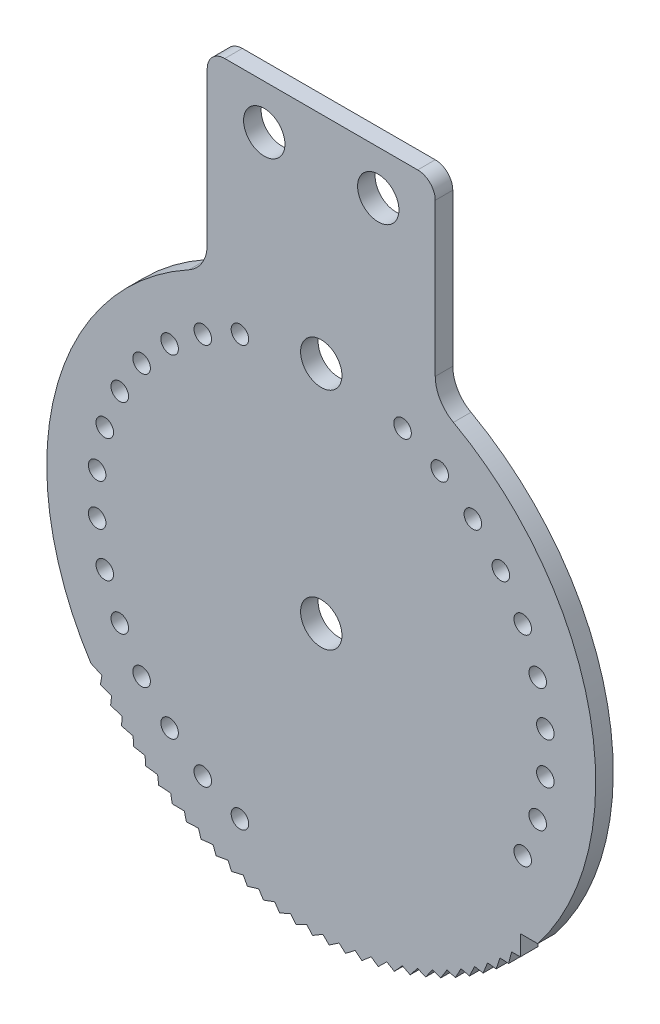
ISO-10303-21;
HEADER;
FILE_DESCRIPTION(('STEP AP214'),'2;1');
FILE_NAME('part.step','',(''),(''),'','','');
FILE_SCHEMA(('AUTOMOTIVE_DESIGN { 1 0 10303 214 1 1 1 1 }'));
ENDSEC;
DATA;
#1=APPLICATION_CONTEXT('core data for automotive mechanical design processes');
#2=APPLICATION_PROTOCOL_DEFINITION('international standard','automotive_design',2000,#1);
#3=PRODUCT_CONTEXT('',#1,'mechanical');
#4=PRODUCT('Part','Part','',(#3));
#5=PRODUCT_RELATED_PRODUCT_CATEGORY('part','',(#4));
#6=PRODUCT_DEFINITION_FORMATION('','',#4);
#7=PRODUCT_DEFINITION_CONTEXT('part definition',#1,'design');
#8=PRODUCT_DEFINITION('design','',#6,#7);
#9=PRODUCT_DEFINITION_SHAPE('','',#8);
#10=(LENGTH_UNIT() NAMED_UNIT(*) SI_UNIT(.MILLI.,.METRE.));
#11=(NAMED_UNIT(*) PLANE_ANGLE_UNIT() SI_UNIT($,.RADIAN.));
#12=(NAMED_UNIT(*) SI_UNIT($,.STERADIAN.) SOLID_ANGLE_UNIT());
#13=UNCERTAINTY_MEASURE_WITH_UNIT(LENGTH_MEASURE(1.E-05),#10,'distance_accuracy_value','');
#14=(GEOMETRIC_REPRESENTATION_CONTEXT(3) GLOBAL_UNCERTAINTY_ASSIGNED_CONTEXT((#13)) GLOBAL_UNIT_ASSIGNED_CONTEXT((#10,
#11,#12)) REPRESENTATION_CONTEXT('',''));
#15=CARTESIAN_POINT('',(0.,0.,0.));
#16=DIRECTION('',(0.,0.,1.));
#17=DIRECTION('',(1.,0.,0.));
#18=AXIS2_PLACEMENT_3D('',#15,#16,#17);
#19=CARTESIAN_POINT('',(13.9628370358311,61.3019068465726,2.54));
#20=DIRECTION('',(0.,0.,-1.));
#21=DIRECTION('',(-1.,0.,0.));
#22=AXIS2_PLACEMENT_3D('',#19,#20,#21);
#23=CYLINDRICAL_SURFACE('',#22,2.54);
#24=CARTESIAN_POINT('',(13.9628370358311,61.3019068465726,0.));
#25=DIRECTION('',(0.,0.,1.));
#26=DIRECTION('',(1.,0.,0.));
#27=AXIS2_PLACEMENT_3D('',#24,#25,#26);
#28=CIRCLE('',#27,2.54);
#29=CARTESIAN_POINT('',(13.9628370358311,63.8419068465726,0.));
#30=VERTEX_POINT('',#29);
#31=CARTESIAN_POINT('',(16.5028370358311,61.3019068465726,0.));
#32=VERTEX_POINT('',#31);
#33=EDGE_CURVE('E590',#30,#32,#28,.F.);
#34=ORIENTED_EDGE('',*,*,#33,.F.);
#35=DIRECTION('',(0.,0.,-1.));
#36=VECTOR('',#35,1.);
#37=CARTESIAN_POINT('',(13.9628370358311,63.8419068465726,2.54));
#38=LINE('',#37,#36);
#39=CARTESIAN_POINT('',(13.9628370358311,63.8419068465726,2.54));
#40=VERTEX_POINT('',#39);
#41=EDGE_CURVE('E11',#40,#30,#38,.T.);
#42=ORIENTED_EDGE('',*,*,#41,.F.);
#43=CARTESIAN_POINT('',(13.9628370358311,61.3019068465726,2.54));
#44=DIRECTION('',(0.,0.,1.));
#45=DIRECTION('',(1.,0.,0.));
#46=AXIS2_PLACEMENT_3D('',#43,#44,#45);
#47=CIRCLE('',#46,2.54);
#48=CARTESIAN_POINT('',(16.5028370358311,61.3019068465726,2.54));
#49=VERTEX_POINT('',#48);
#50=EDGE_CURVE('E881',#40,#49,#47,.F.);
#51=ORIENTED_EDGE('',*,*,#50,.T.);
#52=DIRECTION('',(0.,0.,-1.));
#53=VECTOR('',#52,1.);
#54=CARTESIAN_POINT('',(16.5028370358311,61.3019068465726,2.54));
#55=LINE('',#54,#53);
#56=EDGE_CURVE('E273',#49,#32,#55,.T.);
#57=ORIENTED_EDGE('',*,*,#56,.T.);
#58=EDGE_LOOP('',(#34,#42,#51,#57));
#59=FACE_BOUND('',#58,.T.);
#60=ADVANCED_FACE('F34',(#59),#23,.T.);
#61=CARTESIAN_POINT('',(0.,63.8419068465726,2.54));
#62=DIRECTION('',(0.,1.,0.));
#63=DIRECTION('',(0.,0.,1.));
#64=AXIS2_PLACEMENT_3D('',#61,#62,#63);
#65=PLANE('',#64);
#66=DIRECTION('',(1.,0.,0.));
#67=VECTOR('',#66,1.);
#68=CARTESIAN_POINT('',(0.,63.8419068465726,0.));
#69=LINE('',#68,#67);
#70=CARTESIAN_POINT('',(-13.9628370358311,63.8419068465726,0.));
#71=VERTEX_POINT('',#70);
#72=EDGE_CURVE('E593',#71,#30,#69,.T.);
#73=ORIENTED_EDGE('',*,*,#72,.F.);
#74=DIRECTION('',(0.,0.,-1.));
#75=VECTOR('',#74,1.);
#76=CARTESIAN_POINT('',(-13.9628370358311,63.8419068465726,2.54));
#77=LINE('',#76,#75);
#78=CARTESIAN_POINT('',(-13.9628370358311,63.8419068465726,2.54));
#79=VERTEX_POINT('',#78);
#80=EDGE_CURVE('E42',#79,#71,#77,.T.);
#81=ORIENTED_EDGE('',*,*,#80,.F.);
#82=DIRECTION('',(1.,0.,0.));
#83=VECTOR('',#82,1.);
#84=CARTESIAN_POINT('',(0.,63.8419068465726,2.54));
#85=LINE('',#84,#83);
#86=EDGE_CURVE('E1030',#79,#40,#85,.T.);
#87=ORIENTED_EDGE('',*,*,#86,.T.);
#88=ORIENTED_EDGE('',*,*,#41,.T.);
#89=EDGE_LOOP('',(#73,#81,#87,#88));
#90=FACE_BOUND('',#89,.T.);
#91=ADVANCED_FACE('F1029',(#90),#65,.T.);
#92=CARTESIAN_POINT('',(-13.9628370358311,61.3019068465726,2.54));
#93=DIRECTION('',(0.,0.,-1.));
#94=DIRECTION('',(-1.,0.,0.));
#95=AXIS2_PLACEMENT_3D('',#92,#93,#94);
#96=CYLINDRICAL_SURFACE('',#95,2.54);
#97=CARTESIAN_POINT('',(-13.9628370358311,61.3019068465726,0.));
#98=DIRECTION('',(0.,0.,1.));
#99=DIRECTION('',(1.,0.,0.));
#100=AXIS2_PLACEMENT_3D('',#97,#98,#99);
#101=CIRCLE('',#100,2.54);
#102=CARTESIAN_POINT('',(-16.5028370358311,61.3019068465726,0.));
#103=VERTEX_POINT('',#102);
#104=EDGE_CURVE('E596',#71,#103,#101,.T.);
#105=ORIENTED_EDGE('',*,*,#104,.T.);
#106=DIRECTION('',(0.,0.,-1.));
#107=VECTOR('',#106,1.);
#108=CARTESIAN_POINT('',(-16.5028370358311,61.3019068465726,2.54));
#109=LINE('',#108,#107);
#110=CARTESIAN_POINT('',(-16.5028370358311,61.3019068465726,2.54));
#111=VERTEX_POINT('',#110);
#112=EDGE_CURVE('E1014',#111,#103,#109,.T.);
#113=ORIENTED_EDGE('',*,*,#112,.F.);
#114=CARTESIAN_POINT('',(-13.9628370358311,61.3019068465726,2.54));
#115=DIRECTION('',(0.,0.,1.));
#116=DIRECTION('',(1.,0.,0.));
#117=AXIS2_PLACEMENT_3D('',#114,#115,#116);
#118=CIRCLE('',#117,2.54);
#119=EDGE_CURVE('E1020',#79,#111,#118,.T.);
#120=ORIENTED_EDGE('',*,*,#119,.F.);
#121=ORIENTED_EDGE('',*,*,#80,.T.);
#122=EDGE_LOOP('',(#105,#113,#120,#121));
#123=FACE_BOUND('',#122,.T.);
#124=ADVANCED_FACE('F1018',(#123),#96,.T.);
#125=CARTESIAN_POINT('',(-16.5028370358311,0.,2.54));
#126=DIRECTION('',(-1.,0.,0.));
#127=DIRECTION('',(0.,-1.,0.));
#128=AXIS2_PLACEMENT_3D('',#125,#126,#127);
#129=PLANE('',#128);
#130=DIRECTION('',(0.,1.,0.));
#131=VECTOR('',#130,1.);
#132=CARTESIAN_POINT('',(-16.5028370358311,0.,0.));
#133=LINE('',#132,#131);
#134=CARTESIAN_POINT('',(-16.5028370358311,39.2310960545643,0.));
#135=VERTEX_POINT('',#134);
#136=EDGE_CURVE('E599',#135,#103,#133,.T.);
#137=ORIENTED_EDGE('',*,*,#136,.F.);
#138=DIRECTION('',(0.,0.,-1.));
#139=VECTOR('',#138,1.);
#140=CARTESIAN_POINT('',(-16.5028370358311,39.2310960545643,2.54));
#141=LINE('',#140,#139);
#142=CARTESIAN_POINT('',(-16.5028370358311,39.2310960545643,2.54));
#143=VERTEX_POINT('',#142);
#144=EDGE_CURVE('E1012',#143,#135,#141,.T.);
#145=ORIENTED_EDGE('',*,*,#144,.F.);
#146=DIRECTION('',(0.,1.,0.));
#147=VECTOR('',#146,1.);
#148=CARTESIAN_POINT('',(-16.5028370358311,0.,2.54));
#149=LINE('',#148,#147);
#150=EDGE_CURVE('E1038',#143,#111,#149,.T.);
#151=ORIENTED_EDGE('',*,*,#150,.T.);
#152=ORIENTED_EDGE('',*,*,#112,.T.);
#153=EDGE_LOOP('',(#137,#145,#151,#152));
#154=FACE_BOUND('',#153,.T.);
#155=ADVANCED_FACE('F1484',(#154),#129,.T.);
#156=CARTESIAN_POINT('',(-21.5828370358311,39.2310960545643,2.54));
#157=DIRECTION('',(0.,0.,-1.));
#158=DIRECTION('',(-1.,0.,0.));
#159=AXIS2_PLACEMENT_3D('',#156,#157,#158);
#160=CYLINDRICAL_SURFACE('',#159,5.08);
#161=CARTESIAN_POINT('',(-21.5828370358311,39.2310960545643,0.));
#162=DIRECTION('',(0.,0.,1.));
#163=DIRECTION('',(1.,0.,0.));
#164=AXIS2_PLACEMENT_3D('',#161,#162,#163);
#165=CIRCLE('',#164,5.08);
#166=CARTESIAN_POINT('',(-19.136064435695,34.7791634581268,0.));
#167=VERTEX_POINT('',#166);
#168=EDGE_CURVE('E602',#167,#135,#165,.T.);
#169=ORIENTED_EDGE('',*,*,#168,.F.);
#170=DIRECTION('',(0.,0.,-1.));
#171=VECTOR('',#170,1.);
#172=CARTESIAN_POINT('',(-19.136064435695,34.7791634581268,2.54));
#173=LINE('',#172,#171);
#174=CARTESIAN_POINT('',(-19.136064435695,34.7791634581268,2.54));
#175=VERTEX_POINT('',#174);
#176=EDGE_CURVE('E1010',#175,#167,#173,.T.);
#177=ORIENTED_EDGE('',*,*,#176,.F.);
#178=CARTESIAN_POINT('',(-21.5828370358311,39.2310960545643,2.54));
#179=DIRECTION('',(0.,0.,1.));
#180=DIRECTION('',(1.,0.,0.));
#181=AXIS2_PLACEMENT_3D('',#178,#179,#180);
#182=CIRCLE('',#181,5.08);
#183=EDGE_CURVE('E1041',#175,#143,#182,.T.);
#184=ORIENTED_EDGE('',*,*,#183,.T.);
#185=ORIENTED_EDGE('',*,*,#144,.T.);
#186=EDGE_LOOP('',(#169,#177,#184,#185));
#187=FACE_BOUND('',#186,.T.);
#188=ADVANCED_FACE('F1481',(#187),#160,.F.);
#189=CARTESIAN_POINT('',(0.,-0.0391392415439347,2.54));
#190=DIRECTION('',(0.,0.,-1.));
#191=DIRECTION('',(-1.,0.,0.));
#192=AXIS2_PLACEMENT_3D('',#189,#190,#191);
#193=CYLINDRICAL_SURFACE('',#192,39.7303808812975);
#194=CARTESIAN_POINT('',(0.,-0.0391392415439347,0.));
#195=DIRECTION('',(0.,0.,1.));
#196=DIRECTION('',(1.,0.,0.));
#197=AXIS2_PLACEMENT_3D('',#194,#195,#196);
#198=CIRCLE('',#197,39.7303808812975);
#199=CARTESIAN_POINT('',(-33.3313611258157,-21.6614316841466,0.));
#200=VERTEX_POINT('',#199);
#201=EDGE_CURVE('E605',#200,#167,#198,.F.);
#202=ORIENTED_EDGE('',*,*,#201,.F.);
#203=DIRECTION('',(0.,0.,-1.));
#204=VECTOR('',#203,1.);
#205=CARTESIAN_POINT('',(-33.3313611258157,-21.6614316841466,2.54));
#206=LINE('',#205,#204);
#207=CARTESIAN_POINT('',(-33.3313611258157,-21.6614316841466,2.54));
#208=VERTEX_POINT('',#207);
#209=EDGE_CURVE('E1008',#208,#200,#206,.T.);
#210=ORIENTED_EDGE('',*,*,#209,.F.);
#211=CARTESIAN_POINT('',(0.,-0.0391392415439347,2.54));
#212=DIRECTION('',(0.,0.,1.));
#213=DIRECTION('',(1.,0.,0.));
#214=AXIS2_PLACEMENT_3D('',#211,#212,#213);
#215=CIRCLE('',#214,39.7303808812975);
#216=EDGE_CURVE('E1044',#208,#175,#215,.F.);
#217=ORIENTED_EDGE('',*,*,#216,.T.);
#218=ORIENTED_EDGE('',*,*,#176,.T.);
#219=EDGE_LOOP('',(#202,#210,#217,#218));
#220=FACE_BOUND('',#219,.T.);
#221=ADVANCED_FACE('F1476',(#220),#193,.T.);
#222=CARTESIAN_POINT('',(-13.9444688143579,-30.5194009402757,2.54));
#223=DIRECTION('',(0.415580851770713,0.909556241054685,0.));
#224=DIRECTION('',(-0.909556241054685,0.415580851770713,0.));
#225=AXIS2_PLACEMENT_3D('',#222,#223,#224);
#226=PLANE('',#225);
#227=DIRECTION('',(0.909556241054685,-0.415580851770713,0.));
#228=VECTOR('',#227,1.);
#229=CARTESIAN_POINT('',(-13.9444688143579,-30.5194009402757,0.));
#230=LINE('',#229,#228);
#231=CARTESIAN_POINT('',(-31.7490306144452,-22.3844065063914,0.));
#232=VERTEX_POINT('',#231);
#233=EDGE_CURVE('E608',#200,#232,#230,.T.);
#234=ORIENTED_EDGE('',*,*,#233,.T.);
#235=DIRECTION('',(0.,0.,-1.));
#236=VECTOR('',#235,1.);
#237=CARTESIAN_POINT('',(-31.7490306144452,-22.3844065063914,2.54));
#238=LINE('',#237,#236);
#239=CARTESIAN_POINT('',(-31.7490306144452,-22.3844065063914,2.54));
#240=VERTEX_POINT('',#239);
#241=EDGE_CURVE('E1006',#240,#232,#238,.T.);
#242=ORIENTED_EDGE('',*,*,#241,.F.);
#243=DIRECTION('',(0.909556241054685,-0.415580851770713,0.));
#244=VECTOR('',#243,1.);
#245=CARTESIAN_POINT('',(-13.9444688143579,-30.5194009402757,2.54));
#246=LINE('',#245,#244);
#247=EDGE_CURVE('E1047',#208,#240,#246,.T.);
#248=ORIENTED_EDGE('',*,*,#247,.F.);
#249=ORIENTED_EDGE('',*,*,#209,.T.);
#250=EDGE_LOOP('',(#234,#242,#248,#249));
#251=FACE_BOUND('',#250,.T.);
#252=ADVANCED_FACE('F1473',(#251),#226,.F.);
#253=CARTESIAN_POINT('',(-26.9637212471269,4.75443154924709,2.54));
#254=DIRECTION('',(-0.984807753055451,0.173648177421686,0.));
#255=DIRECTION('',(-0.173648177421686,-0.984807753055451,0.));
#256=AXIS2_PLACEMENT_3D('',#253,#254,#255);
#257=PLANE('',#256);
#258=DIRECTION('',(0.173648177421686,0.984807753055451,0.));
#259=VECTOR('',#258,1.);
#260=CARTESIAN_POINT('',(-26.9637212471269,4.75443154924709,0.));
#261=LINE('',#260,#259);
#262=CARTESIAN_POINT('',(-31.9681351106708,-23.6270098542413,0.));
#263=VERTEX_POINT('',#262);
#264=EDGE_CURVE('E611',#263,#232,#261,.T.);
#265=ORIENTED_EDGE('',*,*,#264,.F.);
#266=DIRECTION('',(0.,0.,-1.));
#267=VECTOR('',#266,1.);
#268=CARTESIAN_POINT('',(-31.9681351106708,-23.6270098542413,2.54));
#269=LINE('',#268,#267);
#270=CARTESIAN_POINT('',(-31.9681351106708,-23.6270098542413,2.54));
#271=VERTEX_POINT('',#270);
#272=EDGE_CURVE('E1004',#271,#263,#269,.T.);
#273=ORIENTED_EDGE('',*,*,#272,.F.);
#274=DIRECTION('',(0.173648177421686,0.984807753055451,0.));
#275=VECTOR('',#274,1.);
#276=CARTESIAN_POINT('',(-26.9637212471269,4.75443154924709,2.54));
#277=LINE('',#276,#275);
#278=EDGE_CURVE('E1049',#271,#240,#277,.T.);
#279=ORIENTED_EDGE('',*,*,#278,.T.);
#280=ORIENTED_EDGE('',*,*,#241,.T.);
#281=EDGE_LOOP('',(#265,#273,#279,#280));
#282=FACE_BOUND('',#281,.T.);
#283=ADVANCED_FACE('F1468',(#282),#257,.T.);
#284=CARTESIAN_POINT('',(-12.0835585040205,-31.3028698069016,2.54));
#285=DIRECTION('',(0.36012096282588,0.932905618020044,0.));
#286=DIRECTION('',(-0.932905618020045,0.36012096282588,0.));
#287=AXIS2_PLACEMENT_3D('',#284,#285,#286);
#288=PLANE('',#287);
#289=DIRECTION('',(0.932905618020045,-0.36012096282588,0.));
#290=VECTOR('',#289,1.);
#291=CARTESIAN_POINT('',(-12.0835585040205,-31.3028698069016,0.));
#292=LINE('',#291,#290);
#293=CARTESIAN_POINT('',(-30.3451843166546,-24.2535026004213,0.));
#294=VERTEX_POINT('',#293);
#295=EDGE_CURVE('E614',#263,#294,#292,.T.);
#296=ORIENTED_EDGE('',*,*,#295,.T.);
#297=DIRECTION('',(0.,0.,-1.));
#298=VECTOR('',#297,1.);
#299=CARTESIAN_POINT('',(-30.3451843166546,-24.2535026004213,2.54));
#300=LINE('',#299,#298);
#301=CARTESIAN_POINT('',(-30.3451843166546,-24.2535026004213,2.54));
#302=VERTEX_POINT('',#301);
#303=EDGE_CURVE('E1002',#302,#294,#300,.T.);
#304=ORIENTED_EDGE('',*,*,#303,.F.);
#305=DIRECTION('',(0.932905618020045,-0.36012096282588,0.));
#306=VECTOR('',#305,1.);
#307=CARTESIAN_POINT('',(-12.0835585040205,-31.3028698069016,2.54));
#308=LINE('',#307,#306);
#309=EDGE_CURVE('E1052',#271,#302,#308,.T.);
#310=ORIENTED_EDGE('',*,*,#309,.F.);
#311=ORIENTED_EDGE('',*,*,#272,.T.);
#312=EDGE_LOOP('',(#296,#304,#310,#311));
#313=FACE_BOUND('',#312,.T.);
#314=ADVANCED_FACE('F1464',(#313),#288,.F.);
#315=CARTESIAN_POINT('',(-27.2008704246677,3.12402480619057,2.54));
#316=DIRECTION('',(-0.9934692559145,0.114100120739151,0.));
#317=DIRECTION('',(-0.114100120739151,-0.993469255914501,0.));
#318=AXIS2_PLACEMENT_3D('',#315,#316,#317);
#319=PLANE('',#318);
#320=DIRECTION('',(0.114100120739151,0.9934692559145,0.));
#321=VECTOR('',#320,1.);
#322=CARTESIAN_POINT('',(-27.2008704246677,3.12402480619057,0.));
#323=LINE('',#322,#321);
#324=CARTESIAN_POINT('',(-30.4891527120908,-25.5070347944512,0.));
#325=VERTEX_POINT('',#324);
#326=EDGE_CURVE('E617',#325,#294,#323,.T.);
#327=ORIENTED_EDGE('',*,*,#326,.F.);
#328=DIRECTION('',(0.,0.,-1.));
#329=VECTOR('',#328,1.);
#330=CARTESIAN_POINT('',(-30.4891527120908,-25.5070347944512,2.54));
#331=LINE('',#330,#329);
#332=CARTESIAN_POINT('',(-30.4891527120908,-25.5070347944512,2.54));
#333=VERTEX_POINT('',#332);
#334=EDGE_CURVE('E1000',#333,#325,#331,.T.);
#335=ORIENTED_EDGE('',*,*,#334,.F.);
#336=DIRECTION('',(0.114100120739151,0.9934692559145,0.));
#337=VECTOR('',#336,1.);
#338=CARTESIAN_POINT('',(-27.2008704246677,3.12402480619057,2.54));
#339=LINE('',#338,#337);
#340=EDGE_CURVE('E1054',#333,#302,#339,.T.);
#341=ORIENTED_EDGE('',*,*,#340,.T.);
#342=ORIENTED_EDGE('',*,*,#303,.T.);
#343=EDGE_LOOP('',(#327,#335,#341,#342));
#344=FACE_BOUND('',#343,.T.);
#345=ADVANCED_FACE('F1459',(#344),#319,.T.);
#346=CARTESIAN_POINT('',(-10.1788937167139,-31.9729912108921,2.54));
#347=DIRECTION('',(0.303357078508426,0.952876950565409,0.));
#348=DIRECTION('',(-0.952876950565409,0.303357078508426,0.));
#349=AXIS2_PLACEMENT_3D('',#346,#347,#348);
#350=PLANE('',#349);
#351=DIRECTION('',(0.952876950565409,-0.303357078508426,0.));
#352=VECTOR('',#351,1.);
#353=CARTESIAN_POINT('',(-10.1788937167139,-31.9729912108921,0.));
#354=LINE('',#353,#352);
#355=CARTESIAN_POINT('',(-28.8314583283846,-26.0347769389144,0.));
#356=VERTEX_POINT('',#355);
#357=EDGE_CURVE('E620',#325,#356,#354,.T.);
#358=ORIENTED_EDGE('',*,*,#357,.T.);
#359=DIRECTION('',(0.,0.,-1.));
#360=VECTOR('',#359,1.);
#361=CARTESIAN_POINT('',(-28.8314583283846,-26.0347769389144,2.54));
#362=LINE('',#361,#360);
#363=CARTESIAN_POINT('',(-28.8314583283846,-26.0347769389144,2.54));
#364=VERTEX_POINT('',#363);
#365=EDGE_CURVE('E998',#364,#356,#362,.T.);
#366=ORIENTED_EDGE('',*,*,#365,.F.);
#367=DIRECTION('',(0.952876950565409,-0.303357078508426,0.));
#368=VECTOR('',#367,1.);
#369=CARTESIAN_POINT('',(-10.1788937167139,-31.9729912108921,2.54));
#370=LINE('',#369,#368);
#371=EDGE_CURVE('E1057',#333,#364,#370,.T.);
#372=ORIENTED_EDGE('',*,*,#371,.F.);
#373=ORIENTED_EDGE('',*,*,#334,.T.);
#374=EDGE_LOOP('',(#358,#366,#372,#373));
#375=FACE_BOUND('',#374,.T.);
#376=ADVANCED_FACE('F1455',(#375),#350,.F.);
#377=CARTESIAN_POINT('',(-27.3395254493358,1.48230599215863,2.54));
#378=DIRECTION('',(-0.998533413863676,0.0541389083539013,0.));
#379=DIRECTION('',(-0.0541389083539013,-0.998533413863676,0.));
#380=AXIS2_PLACEMENT_3D('',#377,#378,#379);
#381=PLANE('',#380);
#382=DIRECTION('',(0.0541389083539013,0.998533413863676,0.));
#383=VECTOR('',#382,1.);
#384=CARTESIAN_POINT('',(-27.3395254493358,1.48230599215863,0.));
#385=LINE('',#384,#383);
#386=CARTESIAN_POINT('',(-28.8997693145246,-27.2946989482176,0.));
#387=VERTEX_POINT('',#386);
#388=EDGE_CURVE('E623',#387,#356,#385,.T.);
#389=ORIENTED_EDGE('',*,*,#388,.F.);
#390=DIRECTION('',(0.,0.,-1.));
#391=VECTOR('',#390,1.);
#392=CARTESIAN_POINT('',(-28.8997693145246,-27.2946989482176,2.54));
#393=LINE('',#392,#391);
#394=CARTESIAN_POINT('',(-28.8997693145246,-27.2946989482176,2.54));
#395=VERTEX_POINT('',#394);
#396=EDGE_CURVE('E996',#395,#387,#393,.T.);
#397=ORIENTED_EDGE('',*,*,#396,.F.);
#398=DIRECTION('',(0.0541389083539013,0.998533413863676,0.));
#399=VECTOR('',#398,1.);
#400=CARTESIAN_POINT('',(-27.3395254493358,1.48230599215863,2.54));
#401=LINE('',#400,#399);
#402=EDGE_CURVE('E1059',#395,#364,#401,.T.);
#403=ORIENTED_EDGE('',*,*,#402,.T.);
#404=ORIENTED_EDGE('',*,*,#365,.T.);
#405=EDGE_LOOP('',(#389,#397,#403,#404));
#406=FACE_BOUND('',#405,.T.);
#407=ADVANCED_FACE('F1450',(#406),#381,.T.);
#408=CARTESIAN_POINT('',(-8.23737122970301,-32.5273386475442,2.54));
#409=DIRECTION('',(0.245494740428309,0.969397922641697,0.));
#410=DIRECTION('',(-0.969397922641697,0.245494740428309,0.));
#411=AXIS2_PLACEMENT_3D('',#408,#409,#410);
#412=PLANE('',#411);
#413=DIRECTION('',(0.969397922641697,-0.245494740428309,0.));
#414=VECTOR('',#413,1.);
#415=CARTESIAN_POINT('',(-8.23737122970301,-32.5273386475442,0.));
#416=LINE('',#415,#414);
#417=CARTESIAN_POINT('',(-27.213333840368,-27.7217795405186,0.));
#418=VERTEX_POINT('',#417);
#419=EDGE_CURVE('E626',#387,#418,#416,.T.);
#420=ORIENTED_EDGE('',*,*,#419,.T.);
#421=DIRECTION('',(0.,0.,-1.));
#422=VECTOR('',#421,1.);
#423=CARTESIAN_POINT('',(-27.213333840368,-27.7217795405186,2.54));
#424=LINE('',#423,#422);
#425=CARTESIAN_POINT('',(-27.213333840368,-27.7217795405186,2.54));
#426=VERTEX_POINT('',#425);
#427=EDGE_CURVE('E994',#426,#418,#424,.T.);
#428=ORIENTED_EDGE('',*,*,#427,.F.);
#429=DIRECTION('',(0.969397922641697,-0.245494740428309,0.));
#430=VECTOR('',#429,1.);
#431=CARTESIAN_POINT('',(-8.23737122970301,-32.5273386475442,2.54));
#432=LINE('',#431,#430);
#433=EDGE_CURVE('E1062',#395,#426,#432,.T.);
#434=ORIENTED_EDGE('',*,*,#433,.F.);
#435=ORIENTED_EDGE('',*,*,#396,.T.);
#436=EDGE_LOOP('',(#420,#428,#434,#435));
#437=FACE_BOUND('',#436,.T.);
#438=ADVANCED_FACE('F1446',(#437),#412,.F.);
#439=CARTESIAN_POINT('',(-27.3791842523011,-0.164780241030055,2.54));
#440=DIRECTION('',(-0.999981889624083,-0.00601834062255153,0.));
#441=DIRECTION('',(0.00601834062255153,-0.999981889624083,0.));
#442=AXIS2_PLACEMENT_3D('',#439,#440,#441);
#443=PLANE('',#442);
#444=DIRECTION('',(-0.00601834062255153,0.999981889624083,0.));
#445=VECTOR('',#444,1.);
#446=CARTESIAN_POINT('',(-27.3791842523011,-0.164780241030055,0.));
#447=LINE('',#446,#445);
#448=CARTESIAN_POINT('',(-27.2057400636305,-28.9835291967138,0.));
#449=VERTEX_POINT('',#448);
#450=EDGE_CURVE('E629',#449,#418,#447,.T.);
#451=ORIENTED_EDGE('',*,*,#450,.F.);
#452=DIRECTION('',(0.,0.,-1.));
#453=VECTOR('',#452,1.);
#454=CARTESIAN_POINT('',(-27.2057400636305,-28.9835291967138,2.54));
#455=LINE('',#454,#453);
#456=CARTESIAN_POINT('',(-27.2057400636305,-28.9835291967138,2.54));
#457=VERTEX_POINT('',#456);
#458=EDGE_CURVE('E992',#457,#449,#455,.T.);
#459=ORIENTED_EDGE('',*,*,#458,.F.);
#460=DIRECTION('',(-0.00601834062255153,0.999981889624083,0.));
#461=VECTOR('',#460,1.);
#462=CARTESIAN_POINT('',(-27.3791842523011,-0.164780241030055,2.54));
#463=LINE('',#462,#461);
#464=EDGE_CURVE('E1064',#457,#426,#463,.T.);
#465=ORIENTED_EDGE('',*,*,#464,.T.);
#466=ORIENTED_EDGE('',*,*,#427,.T.);
#467=EDGE_LOOP('',(#451,#459,#465,#466));
#468=FACE_BOUND('',#467,.T.);
#469=ADVANCED_FACE('F1441',(#468),#443,.T.);
#470=CARTESIAN_POINT('',(-6.26602128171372,-32.9639048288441,2.54));
#471=DIRECTION('',(0.186743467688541,0.982408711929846,0.));
#472=DIRECTION('',(-0.982408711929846,0.186743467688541,0.));
#473=AXIS2_PLACEMENT_3D('',#470,#471,#472);
#474=PLANE('',#473);
#475=DIRECTION('',(0.982408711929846,-0.186743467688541,0.));
#476=VECTOR('',#475,1.);
#477=CARTESIAN_POINT('',(-6.26602128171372,-32.9639048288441,0.));
#478=LINE('',#477,#476);
#479=CARTESIAN_POINT('',(-25.4966700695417,-29.3084017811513,0.));
#480=VERTEX_POINT('',#479);
#481=EDGE_CURVE('E632',#449,#480,#478,.T.);
#482=ORIENTED_EDGE('',*,*,#481,.T.);
#483=DIRECTION('',(0.,0.,-1.));
#484=VECTOR('',#483,1.);
#485=CARTESIAN_POINT('',(-25.4966700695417,-29.3084017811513,2.54));
#486=LINE('',#485,#484);
#487=CARTESIAN_POINT('',(-25.4966700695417,-29.3084017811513,2.54));
#488=VERTEX_POINT('',#487);
#489=EDGE_CURVE('E990',#488,#480,#486,.T.);
#490=ORIENTED_EDGE('',*,*,#489,.F.);
#491=DIRECTION('',(0.982408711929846,-0.186743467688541,0.));
#492=VECTOR('',#491,1.);
#493=CARTESIAN_POINT('',(-6.26602128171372,-32.9639048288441,2.54));
#494=LINE('',#493,#492);
#495=EDGE_CURVE('E1067',#457,#488,#494,.T.);
#496=ORIENTED_EDGE('',*,*,#495,.F.);
#497=ORIENTED_EDGE('',*,*,#458,.T.);
#498=EDGE_LOOP('',(#482,#490,#496,#497));
#499=FACE_BOUND('',#498,.T.);
#500=ADVANCED_FACE('F1437',(#499),#474,.F.);
#501=CARTESIAN_POINT('',(-27.319703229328,-1.81126980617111,2.54));
#502=DIRECTION('',(-0.997809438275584,-0.0661537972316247,0.));
#503=DIRECTION('',(0.0661537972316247,-0.997809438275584,0.));
#504=AXIS2_PLACEMENT_3D('',#501,#502,#503);
#505=PLANE('',#504);
#506=DIRECTION('',(-0.0661537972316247,0.997809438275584,0.));
#507=VECTOR('',#506,1.);
#508=CARTESIAN_POINT('',(-27.319703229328,-1.81126980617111,0.));
#509=LINE('',#508,#507);
#510=CARTESIAN_POINT('',(-25.4131990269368,-30.5674102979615,0.));
#511=VERTEX_POINT('',#510);
#512=EDGE_CURVE('E635',#511,#480,#509,.T.);
#513=ORIENTED_EDGE('',*,*,#512,.F.);
#514=DIRECTION('',(0.,0.,-1.));
#515=VECTOR('',#514,1.);
#516=CARTESIAN_POINT('',(-25.4131990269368,-30.5674102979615,2.54));
#517=LINE('',#516,#515);
#518=CARTESIAN_POINT('',(-25.4131990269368,-30.5674102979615,2.54));
#519=VERTEX_POINT('',#518);
#520=EDGE_CURVE('E988',#519,#511,#517,.T.);
#521=ORIENTED_EDGE('',*,*,#520,.F.);
#522=DIRECTION('',(-0.0661537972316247,0.997809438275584,0.));
#523=VECTOR('',#522,1.);
#524=CARTESIAN_POINT('',(-27.319703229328,-1.81126980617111,2.54));
#525=LINE('',#524,#523);
#526=EDGE_CURVE('E1069',#519,#488,#525,.T.);
#527=ORIENTED_EDGE('',*,*,#526,.T.);
#528=ORIENTED_EDGE('',*,*,#489,.T.);
#529=EDGE_LOOP('',(#513,#521,#527,#528));
#530=FACE_BOUND('',#529,.T.);
#531=ADVANCED_FACE('F1432',(#530),#505,.T.);
#532=CARTESIAN_POINT('',(-4.27198211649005,-33.281108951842,2.54));
#533=DIRECTION('',(0.127315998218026,0.991862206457,0.));
#534=DIRECTION('',(-0.991862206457,0.127315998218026,0.));
#535=AXIS2_PLACEMENT_3D('',#532,#533,#534);
#536=PLANE('',#535);
#537=DIRECTION('',(0.991862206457,-0.127315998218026,0.));
#538=VECTOR('',#537,1.);
#539=CARTESIAN_POINT('',(-4.27198211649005,-33.281108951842,0.));
#540=LINE('',#539,#538);
#541=CARTESIAN_POINT('',(-23.6876830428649,-30.7888985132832,0.));
#542=VERTEX_POINT('',#541);
#543=EDGE_CURVE('E638',#511,#542,#540,.T.);
#544=ORIENTED_EDGE('',*,*,#543,.T.);
#545=DIRECTION('',(0.,0.,-1.));
#546=VECTOR('',#545,1.);
#547=CARTESIAN_POINT('',(-23.6876830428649,-30.7888985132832,2.54));
#548=LINE('',#547,#546);
#549=CARTESIAN_POINT('',(-23.6876830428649,-30.7888985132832,2.54));
#550=VERTEX_POINT('',#549);
#551=EDGE_CURVE('E986',#550,#542,#548,.T.);
#552=ORIENTED_EDGE('',*,*,#551,.F.);
#553=DIRECTION('',(0.991862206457,-0.127315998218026,0.));
#554=VECTOR('',#553,1.);
#555=CARTESIAN_POINT('',(-4.27198211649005,-33.281108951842,2.54));
#556=LINE('',#555,#554);
#557=EDGE_CURVE('E1072',#519,#550,#556,.T.);
#558=ORIENTED_EDGE('',*,*,#557,.F.);
#559=ORIENTED_EDGE('',*,*,#520,.T.);
#560=EDGE_LOOP('',(#544,#552,#558,#559));
#561=FACE_BOUND('',#560,.T.);
#562=ADVANCED_FACE('F1428',(#561),#536,.F.);
#563=CARTESIAN_POINT('',(-27.1612977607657,-3.45120077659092,2.54));
#564=DIRECTION('',(-0.992023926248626,-0.126049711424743,0.));
#565=DIRECTION('',(0.126049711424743,-0.992023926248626,0.));
#566=AXIS2_PLACEMENT_3D('',#563,#564,#565);
#567=PLANE('',#566);
#568=DIRECTION('',(-0.126049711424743,0.992023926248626,0.));
#569=VECTOR('',#568,1.);
#570=CARTESIAN_POINT('',(-27.1612977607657,-3.45120077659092,0.));
#571=LINE('',#570,#569);
#572=CARTESIAN_POINT('',(-23.5286369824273,-32.0406070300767,0.));
#573=VERTEX_POINT('',#572);
#574=EDGE_CURVE('E641',#573,#542,#571,.T.);
#575=ORIENTED_EDGE('',*,*,#574,.F.);
#576=DIRECTION('',(0.,0.,-1.));
#577=VECTOR('',#576,1.);
#578=CARTESIAN_POINT('',(-23.5286369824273,-32.0406070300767,2.54));
#579=LINE('',#578,#577);
#580=CARTESIAN_POINT('',(-23.5286369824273,-32.0406070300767,2.54));
#581=VERTEX_POINT('',#580);
#582=EDGE_CURVE('E984',#581,#573,#579,.T.);
#583=ORIENTED_EDGE('',*,*,#582,.F.);
#584=DIRECTION('',(-0.126049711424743,0.992023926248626,0.));
#585=VECTOR('',#584,1.);
#586=CARTESIAN_POINT('',(-27.1612977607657,-3.45120077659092,2.54));
#587=LINE('',#586,#585);
#588=EDGE_CURVE('E1074',#581,#550,#587,.T.);
#589=ORIENTED_EDGE('',*,*,#588,.T.);
#590=ORIENTED_EDGE('',*,*,#551,.T.);
#591=EDGE_LOOP('',(#575,#583,#589,#590));
#592=FACE_BOUND('',#591,.T.);
#593=ADVANCED_FACE('F1423',(#592),#567,.T.);
#594=CARTESIAN_POINT('',(-2.26247413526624,-33.4778024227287,2.54));
#595=DIRECTION('',(0.0674275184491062,0.997724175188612,0.));
#596=DIRECTION('',(-0.997724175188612,0.0674275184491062,0.));
#597=AXIS2_PLACEMENT_3D('',#594,#595,#596);
#598=PLANE('',#597);
#599=DIRECTION('',(0.997724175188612,-0.0674275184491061,0.));
#600=VECTOR('',#599,1.);
#601=CARTESIAN_POINT('',(-2.26247413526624,-33.4778024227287,0.));
#602=LINE('',#601,#600);
#603=CARTESIAN_POINT('',(-21.7929230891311,-32.1579088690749,0.));
#604=VERTEX_POINT('',#603);
#605=EDGE_CURVE('E644',#573,#604,#602,.T.);
#606=ORIENTED_EDGE('',*,*,#605,.T.);
#607=DIRECTION('',(0.,0.,-1.));
#608=VECTOR('',#607,1.);
#609=CARTESIAN_POINT('',(-21.7929230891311,-32.1579088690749,2.54));
#610=LINE('',#609,#608);
#611=CARTESIAN_POINT('',(-21.7929230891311,-32.1579088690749,2.54));
#612=VERTEX_POINT('',#611);
#613=EDGE_CURVE('E982',#612,#604,#610,.T.);
#614=ORIENTED_EDGE('',*,*,#613,.F.);
#615=DIRECTION('',(0.997724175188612,-0.0674275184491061,0.));
#616=VECTOR('',#615,1.);
#617=CARTESIAN_POINT('',(-2.26247413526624,-33.4778024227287,2.54));
#618=LINE('',#617,#616);
#619=EDGE_CURVE('E1077',#581,#612,#618,.T.);
#620=ORIENTED_EDGE('',*,*,#619,.F.);
#621=ORIENTED_EDGE('',*,*,#582,.T.);
#622=EDGE_LOOP('',(#606,#614,#620,#621));
#623=FACE_BOUND('',#622,.T.);
#624=ADVANCED_FACE('F1419',(#623),#598,.F.);
#625=CARTESIAN_POINT('',(-26.9045414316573,-5.07863497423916,2.54));
#626=DIRECTION('',(-0.982646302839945,-0.18548920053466,0.));
#627=DIRECTION('',(0.18548920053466,-0.982646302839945,0.));
#628=AXIS2_PLACEMENT_3D('',#625,#626,#627);
#629=PLANE('',#628);
#630=DIRECTION('',(-0.18548920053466,0.982646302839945,0.));
#631=VECTOR('',#630,1.);
#632=CARTESIAN_POINT('',(-26.9045414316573,-5.07863497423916,0.));
#633=LINE('',#632,#631);
#634=CARTESIAN_POINT('',(-21.5588779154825,-33.3977849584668,0.));
#635=VERTEX_POINT('',#634);
#636=EDGE_CURVE('E647',#635,#604,#633,.T.);
#637=ORIENTED_EDGE('',*,*,#636,.F.);
#638=DIRECTION('',(0.,0.,-1.));
#639=VECTOR('',#638,1.);
#640=CARTESIAN_POINT('',(-21.5588779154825,-33.3977849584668,2.54));
#641=LINE('',#640,#639);
#642=CARTESIAN_POINT('',(-21.5588779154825,-33.3977849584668,2.54));
#643=VERTEX_POINT('',#642);
#644=EDGE_CURVE('E980',#643,#635,#641,.T.);
#645=ORIENTED_EDGE('',*,*,#644,.F.);
#646=DIRECTION('',(-0.18548920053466,0.982646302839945,0.));
#647=VECTOR('',#646,1.);
#648=CARTESIAN_POINT('',(-26.9045414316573,-5.07863497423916,2.54));
#649=LINE('',#648,#647);
#650=EDGE_CURVE('E1079',#643,#612,#649,.T.);
#651=ORIENTED_EDGE('',*,*,#650,.T.);
#652=ORIENTED_EDGE('',*,*,#613,.T.);
#653=EDGE_LOOP('',(#637,#645,#651,#652));
#654=FACE_BOUND('',#653,.T.);
#655=ADVANCED_FACE('F1414',(#654),#629,.T.);
#656=CARTESIAN_POINT('',(-0.244773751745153,-33.5532730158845,2.54));
#657=DIRECTION('',(0.0072948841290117,0.999973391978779,0.));
#658=DIRECTION('',(-0.999973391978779,0.00729488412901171,0.));
#659=AXIS2_PLACEMENT_3D('',#656,#657,#658);
#660=PLANE('',#659);
#661=DIRECTION('',(0.999973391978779,-0.0072948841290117,0.));
#662=VECTOR('',#661,1.);
#663=CARTESIAN_POINT('',(-0.244773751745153,-33.5532730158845,0.));
#664=LINE('',#663,#662);
#665=CARTESIAN_POINT('',(-19.8192511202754,-33.4104756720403,0.));
#666=VERTEX_POINT('',#665);
#667=EDGE_CURVE('E650',#635,#666,#664,.T.);
#668=ORIENTED_EDGE('',*,*,#667,.T.);
#669=DIRECTION('',(0.,0.,-1.));
#670=VECTOR('',#669,1.);
#671=CARTESIAN_POINT('',(-19.8192511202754,-33.4104756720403,2.54));
#672=LINE('',#671,#670);
#673=CARTESIAN_POINT('',(-19.8192511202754,-33.4104756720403,2.54));
#674=VERTEX_POINT('',#673);
#675=EDGE_CURVE('E978',#674,#666,#672,.T.);
#676=ORIENTED_EDGE('',*,*,#675,.F.);
#677=DIRECTION('',(0.999973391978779,-0.0072948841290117,0.));
#678=VECTOR('',#677,1.);
#679=CARTESIAN_POINT('',(-0.244773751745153,-33.5532730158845,2.54));
#680=LINE('',#679,#678);
#681=EDGE_CURVE('E1082',#643,#674,#680,.T.);
#682=ORIENTED_EDGE('',*,*,#681,.F.);
#683=ORIENTED_EDGE('',*,*,#644,.T.);
#684=EDGE_LOOP('',(#668,#676,#682,#683));
#685=FACE_BOUND('',#684,.T.);
#686=ADVANCED_FACE('F1410',(#685),#660,.F.);
#687=CARTESIAN_POINT('',(-26.5503639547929,-6.68767947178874,2.54));
#688=DIRECTION('',(-0.969710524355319,-0.244257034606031,0.));
#689=DIRECTION('',(0.244257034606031,-0.969710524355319,0.));
#690=AXIS2_PLACEMENT_3D('',#687,#688,#689);
#691=PLANE('',#690);
#692=DIRECTION('',(-0.244257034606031,0.969710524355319,0.));
#693=VECTOR('',#692,1.);
#694=CARTESIAN_POINT('',(-26.5503639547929,-6.68767947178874,0.));
#695=LINE('',#694,#693);
#696=CARTESIAN_POINT('',(-19.5110543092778,-34.6340297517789,0.));
#697=VERTEX_POINT('',#696);
#698=EDGE_CURVE('E653',#697,#666,#695,.T.);
#699=ORIENTED_EDGE('',*,*,#698,.F.);
#700=DIRECTION('',(0.,0.,-1.));
#701=VECTOR('',#700,1.);
#702=CARTESIAN_POINT('',(-19.5110543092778,-34.6340297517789,2.54));
#703=LINE('',#702,#701);
#704=CARTESIAN_POINT('',(-19.5110543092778,-34.6340297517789,2.54));
#705=VERTEX_POINT('',#704);
#706=EDGE_CURVE('E976',#705,#697,#703,.T.);
#707=ORIENTED_EDGE('',*,*,#706,.F.);
#708=DIRECTION('',(-0.244257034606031,0.969710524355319,0.));
#709=VECTOR('',#708,1.);
#710=CARTESIAN_POINT('',(-26.5503639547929,-6.68767947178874,2.54));
#711=LINE('',#710,#709);
#712=EDGE_CURVE('E1084',#705,#674,#711,.T.);
#713=ORIENTED_EDGE('',*,*,#712,.T.);
#714=ORIENTED_EDGE('',*,*,#675,.T.);
#715=EDGE_LOOP('',(#699,#707,#713,#714));
#716=FACE_BOUND('',#715,.T.);
#717=ADVANCED_FACE('F1405',(#716),#691,.T.);
#718=CARTESIAN_POINT('',(1.7738129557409,-33.5072474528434,2.54));
#719=DIRECTION('',(-0.0528641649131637,0.998601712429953,0.));
#720=DIRECTION('',(-0.998601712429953,-0.0528641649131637,0.));
#721=AXIS2_PLACEMENT_3D('',#718,#719,#720);
#722=PLANE('',#721);
#723=DIRECTION('',(0.998601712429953,0.0528641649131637,0.));
#724=VECTOR('',#723,1.);
#725=CARTESIAN_POINT('',(1.7738129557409,-33.5072474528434,0.));
#726=LINE('',#725,#724);
#727=CARTESIAN_POINT('',(-17.7738137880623,-34.5420633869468,0.));
#728=VERTEX_POINT('',#727);
#729=EDGE_CURVE('E656',#697,#728,#726,.T.);
#730=ORIENTED_EDGE('',*,*,#729,.T.);
#731=DIRECTION('',(0.,0.,-1.));
#732=VECTOR('',#731,1.);
#733=CARTESIAN_POINT('',(-17.7738137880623,-34.5420633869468,2.54));
#734=LINE('',#733,#732);
#735=CARTESIAN_POINT('',(-17.7738137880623,-34.5420633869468,2.54));
#736=VERTEX_POINT('',#735);
#737=EDGE_CURVE('E974',#736,#728,#734,.T.);
#738=ORIENTED_EDGE('',*,*,#737,.F.);
#739=DIRECTION('',(0.998601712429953,0.0528641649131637,0.));
#740=VECTOR('',#739,1.);
#741=CARTESIAN_POINT('',(1.7738129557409,-33.5072474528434,2.54));
#742=LINE('',#741,#740);
#743=EDGE_CURVE('E1087',#705,#736,#742,.T.);
#744=ORIENTED_EDGE('',*,*,#743,.F.);
#745=ORIENTED_EDGE('',*,*,#706,.T.);
#746=EDGE_LOOP('',(#730,#738,#744,#745));
#747=FACE_BOUND('',#746,.T.);
#748=ADVANCED_FACE('F1401',(#747),#722,.F.);
#749=CARTESIAN_POINT('',(-26.1000478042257,-8.27250793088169,2.54));
#750=DIRECTION('',(-0.953263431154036,-0.30214041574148,0.));
#751=DIRECTION('',(0.30214041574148,-0.953263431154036,0.));
#752=AXIS2_PLACEMENT_3D('',#749,#750,#751);
#753=PLANE('',#752);
#754=DIRECTION('',(-0.30214041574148,0.953263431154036,0.));
#755=VECTOR('',#754,1.);
#756=CARTESIAN_POINT('',(-26.1000478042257,-8.27250793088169,0.));
#757=LINE('',#756,#755);
#758=CARTESIAN_POINT('',(-17.3925813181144,-35.7448649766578,0.));
#759=VERTEX_POINT('',#758);
#760=EDGE_CURVE('E659',#759,#728,#757,.T.);
#761=ORIENTED_EDGE('',*,*,#760,.F.);
#762=DIRECTION('',(0.,0.,-1.));
#763=VECTOR('',#762,1.);
#764=CARTESIAN_POINT('',(-17.3925813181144,-35.7448649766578,2.54));
#765=LINE('',#764,#763);
#766=CARTESIAN_POINT('',(-17.3925813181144,-35.7448649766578,2.54));
#767=VERTEX_POINT('',#766);
#768=EDGE_CURVE('E972',#767,#759,#765,.T.);
#769=ORIENTED_EDGE('',*,*,#768,.F.);
#770=DIRECTION('',(-0.30214041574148,0.953263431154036,0.));
#771=VECTOR('',#770,1.);
#772=CARTESIAN_POINT('',(-26.1000478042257,-8.27250793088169,2.54));
#773=LINE('',#772,#771);
#774=EDGE_CURVE('E1089',#767,#736,#773,.T.);
#775=ORIENTED_EDGE('',*,*,#774,.T.);
#776=ORIENTED_EDGE('',*,*,#737,.T.);
#777=EDGE_LOOP('',(#761,#769,#775,#776));
#778=FACE_BOUND('',#777,.T.);
#779=ADVANCED_FACE('F1396',(#778),#753,.T.);
#780=CARTESIAN_POINT('',(3.78597669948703,-33.3398923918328,2.54));
#781=DIRECTION('',(-0.112831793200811,0.993614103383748,0.));
#782=DIRECTION('',(-0.993614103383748,-0.112831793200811,0.));
#783=AXIS2_PLACEMENT_3D('',#780,#781,#782);
#784=PLANE('',#783);
#785=DIRECTION('',(0.993614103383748,0.112831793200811,0.));
#786=VECTOR('',#785,1.);
#787=CARTESIAN_POINT('',(3.78597669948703,-33.3398923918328,0.));
#788=LINE('',#787,#786);
#789=CARTESIAN_POINT('',(-15.6640176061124,-35.5485745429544,0.));
#790=VERTEX_POINT('',#789);
#791=EDGE_CURVE('E662',#759,#790,#788,.T.);
#792=ORIENTED_EDGE('',*,*,#791,.T.);
#793=DIRECTION('',(0.,0.,-1.));
#794=VECTOR('',#793,1.);
#795=CARTESIAN_POINT('',(-15.6640176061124,-35.5485745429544,2.54));
#796=LINE('',#795,#794);
#797=CARTESIAN_POINT('',(-15.6640176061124,-35.5485745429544,2.54));
#798=VERTEX_POINT('',#797);
#799=EDGE_CURVE('E970',#798,#790,#796,.T.);
#800=ORIENTED_EDGE('',*,*,#799,.F.);
#801=DIRECTION('',(0.993614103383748,0.112831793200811,0.));
#802=VECTOR('',#801,1.);
#803=CARTESIAN_POINT('',(3.78597669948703,-33.3398923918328,2.54));
#804=LINE('',#803,#802);
#805=EDGE_CURVE('E1092',#767,#798,#804,.T.);
#806=ORIENTED_EDGE('',*,*,#805,.F.);
#807=ORIENTED_EDGE('',*,*,#768,.T.);
#808=EDGE_LOOP('',(#792,#800,#806,#807));
#809=FACE_BOUND('',#808,.T.);
#810=ADVANCED_FACE('F1392',(#809),#784,.F.);
#811=CARTESIAN_POINT('',(-25.5552235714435,-9.82738169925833,2.54));
#812=DIRECTION('',(-0.933364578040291,-0.358929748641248,0.));
#813=DIRECTION('',(0.358929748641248,-0.933364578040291,0.));
#814=AXIS2_PLACEMENT_3D('',#811,#812,#813);
#815=PLANE('',#814);
#816=DIRECTION('',(-0.358929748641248,0.933364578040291,0.));
#817=VECTOR('',#816,1.);
#818=CARTESIAN_POINT('',(-25.5552235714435,-9.82738169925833,0.));
#819=LINE('',#818,#817);
#820=CARTESIAN_POINT('',(-15.2111299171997,-36.7262683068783,0.));
#821=VERTEX_POINT('',#820);
#822=EDGE_CURVE('E665',#821,#790,#819,.T.);
#823=ORIENTED_EDGE('',*,*,#822,.F.);
#824=DIRECTION('',(0.,0.,-1.));
#825=VECTOR('',#824,1.);
#826=CARTESIAN_POINT('',(-15.2111299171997,-36.7262683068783,2.54));
#827=LINE('',#826,#825);
#828=CARTESIAN_POINT('',(-15.2111299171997,-36.7262683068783,2.54));
#829=VERTEX_POINT('',#828);
#830=EDGE_CURVE('E968',#829,#821,#827,.T.);
#831=ORIENTED_EDGE('',*,*,#830,.F.);
#832=DIRECTION('',(-0.358929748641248,0.933364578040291,0.));
#833=VECTOR('',#832,1.);
#834=CARTESIAN_POINT('',(-25.5552235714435,-9.82738169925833,2.54));
#835=LINE('',#834,#833);
#836=EDGE_CURVE('E1094',#829,#798,#835,.T.);
#837=ORIENTED_EDGE('',*,*,#836,.T.);
#838=ORIENTED_EDGE('',*,*,#799,.T.);
#839=EDGE_LOOP('',(#823,#831,#837,#838));
#840=FACE_BOUND('',#839,.T.);
#841=ADVANCED_FACE('F1387',(#840),#815,.T.);
#842=CARTESIAN_POINT('',(5.78443144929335,-33.0518138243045,2.54));
#843=DIRECTION('',(-0.172390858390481,0.985028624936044,0.));
#844=DIRECTION('',(-0.985028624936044,-0.172390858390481,0.));
#845=AXIS2_PLACEMENT_3D('',#842,#843,#844);
#846=PLANE('',#845);
#847=DIRECTION('',(0.985028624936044,0.172390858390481,0.));
#848=VECTOR('',#847,1.);
#849=CARTESIAN_POINT('',(5.78443144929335,-33.0518138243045,0.));
#850=LINE('',#849,#848);
#851=CARTESIAN_POINT('',(-13.4975021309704,-36.4263645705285,0.));
#852=VERTEX_POINT('',#851);
#853=EDGE_CURVE('E668',#821,#852,#850,.T.);
#854=ORIENTED_EDGE('',*,*,#853,.T.);
#855=DIRECTION('',(0.,0.,-1.));
#856=VECTOR('',#855,1.);
#857=CARTESIAN_POINT('',(-13.4975021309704,-36.4263645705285,2.54));
#858=LINE('',#857,#856);
#859=CARTESIAN_POINT('',(-13.4975021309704,-36.4263645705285,2.54));
#860=VERTEX_POINT('',#859);
#861=EDGE_CURVE('E966',#860,#852,#858,.T.);
#862=ORIENTED_EDGE('',*,*,#861,.F.);
#863=DIRECTION('',(0.985028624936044,0.172390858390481,0.));
#864=VECTOR('',#863,1.);
#865=CARTESIAN_POINT('',(5.78443144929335,-33.0518138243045,2.54));
#866=LINE('',#865,#864);
#867=EDGE_CURVE('E1097',#829,#860,#866,.T.);
#868=ORIENTED_EDGE('',*,*,#867,.F.);
#869=ORIENTED_EDGE('',*,*,#830,.T.);
#870=EDGE_LOOP('',(#854,#862,#868,#869));
#871=FACE_BOUND('',#870,.T.);
#872=ADVANCED_FACE('F1383',(#871),#846,.F.);
#873=CARTESIAN_POINT('',(-24.9178640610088,-11.3466705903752,2.54));
#874=DIRECTION('',(-0.910086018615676,-0.414419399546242,0.));
#875=DIRECTION('',(0.414419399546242,-0.910086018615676,0.));
#876=AXIS2_PLACEMENT_3D('',#873,#874,#875);
#877=PLANE('',#876);
#878=DIRECTION('',(-0.414419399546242,0.910086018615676,0.));
#879=VECTOR('',#878,1.);
#880=CARTESIAN_POINT('',(-24.9178640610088,-11.3466705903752,0.));
#881=LINE('',#880,#879);
#882=CARTESIAN_POINT('',(-12.9745991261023,-37.5746860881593,0.));
#883=VERTEX_POINT('',#882);
#884=EDGE_CURVE('E671',#883,#852,#881,.T.);
#885=ORIENTED_EDGE('',*,*,#884,.F.);
#886=DIRECTION('',(0.,0.,-1.));
#887=VECTOR('',#886,1.);
#888=CARTESIAN_POINT('',(-12.9745991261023,-37.5746860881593,2.54));
#889=LINE('',#888,#887);
#890=CARTESIAN_POINT('',(-12.9745991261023,-37.5746860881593,2.54));
#891=VERTEX_POINT('',#890);
#892=EDGE_CURVE('E964',#891,#883,#889,.T.);
#893=ORIENTED_EDGE('',*,*,#892,.F.);
#894=DIRECTION('',(-0.414419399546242,0.910086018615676,0.));
#895=VECTOR('',#894,1.);
#896=CARTESIAN_POINT('',(-24.9178640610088,-11.3466705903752,2.54));
#897=LINE('',#896,#895);
#898=EDGE_CURVE('E1099',#891,#860,#897,.T.);
#899=ORIENTED_EDGE('',*,*,#898,.T.);
#900=ORIENTED_EDGE('',*,*,#861,.T.);
#901=EDGE_LOOP('',(#885,#893,#899,#900));
#902=FACE_BOUND('',#901,.T.);
#903=ADVANCED_FACE('F1378',(#902),#877,.T.);
#904=CARTESIAN_POINT('',(7.76194081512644,-32.6440548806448,2.54));
#905=DIRECTION('',(-0.231325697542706,0.97287636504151,0.));
#906=DIRECTION('',(-0.97287636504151,-0.231325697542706,0.));
#907=AXIS2_PLACEMENT_3D('',#904,#905,#906);
#908=PLANE('',#907);
#909=DIRECTION('',(0.97287636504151,0.231325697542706,0.));
#910=VECTOR('',#909,1.);
#911=CARTESIAN_POINT('',(7.76194081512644,-32.6440548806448,0.));
#912=LINE('',#911,#910);
#913=CARTESIAN_POINT('',(-11.282112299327,-37.1722549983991,0.));
#914=VERTEX_POINT('',#913);
#915=EDGE_CURVE('E674',#883,#914,#912,.T.);
#916=ORIENTED_EDGE('',*,*,#915,.T.);
#917=DIRECTION('',(0.,0.,-1.));
#918=VECTOR('',#917,1.);
#919=CARTESIAN_POINT('',(-11.282112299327,-37.1722549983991,2.54));
#920=LINE('',#919,#918);
#921=CARTESIAN_POINT('',(-11.282112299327,-37.1722549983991,2.54));
#922=VERTEX_POINT('',#921);
#923=EDGE_CURVE('E962',#922,#914,#920,.T.);
#924=ORIENTED_EDGE('',*,*,#923,.F.);
#925=DIRECTION('',(0.97287636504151,0.231325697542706,0.));
#926=VECTOR('',#925,1.);
#927=CARTESIAN_POINT('',(7.76194081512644,-32.6440548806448,2.54));
#928=LINE('',#927,#926);
#929=EDGE_CURVE('E1102',#891,#922,#928,.T.);
#930=ORIENTED_EDGE('',*,*,#929,.F.);
#931=ORIENTED_EDGE('',*,*,#892,.T.);
#932=EDGE_LOOP('',(#916,#924,#930,#931));
#933=FACE_BOUND('',#932,.T.);
#934=ADVANCED_FACE('F1374',(#933),#908,.F.);
#935=CARTESIAN_POINT('',(-24.1902771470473,-12.8248732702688,2.54));
#936=DIRECTION('',(-0.88351204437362,-0.468408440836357,0.));
#937=DIRECTION('',(0.468408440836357,-0.88351204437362,0.));
#938=AXIS2_PLACEMENT_3D('',#935,#936,#937);
#939=PLANE('',#938);
#940=DIRECTION('',(-0.468408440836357,0.88351204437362,0.));
#941=VECTOR('',#940,1.);
#942=CARTESIAN_POINT('',(-24.1902771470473,-12.8248732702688,0.));
#943=LINE('',#942,#941);
#944=CARTESIAN_POINT('',(-10.6910874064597,-38.2870462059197,0.));
#945=VERTEX_POINT('',#944);
#946=EDGE_CURVE('E677',#945,#914,#943,.T.);
#947=ORIENTED_EDGE('',*,*,#946,.F.);
#948=DIRECTION('',(0.,0.,-1.));
#949=VECTOR('',#948,1.);
#950=CARTESIAN_POINT('',(-10.6910874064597,-38.2870462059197,2.54));
#951=LINE('',#950,#949);
#952=CARTESIAN_POINT('',(-10.6910874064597,-38.2870462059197,2.54));
#953=VERTEX_POINT('',#952);
#954=EDGE_CURVE('E960',#953,#945,#951,.T.);
#955=ORIENTED_EDGE('',*,*,#954,.F.);
#956=DIRECTION('',(-0.468408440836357,0.88351204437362,0.));
#957=VECTOR('',#956,1.);
#958=CARTESIAN_POINT('',(-24.1902771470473,-12.8248732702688,2.54));
#959=LINE('',#958,#957);
#960=EDGE_CURVE('E1104',#953,#922,#959,.T.);
#961=ORIENTED_EDGE('',*,*,#960,.T.);
#962=ORIENTED_EDGE('',*,*,#923,.T.);
#963=EDGE_LOOP('',(#947,#955,#961,#962));
#964=FACE_BOUND('',#963,.T.);
#965=ADVANCED_FACE('F1369',(#964),#939,.T.);
#966=CARTESIAN_POINT('',(9.71134425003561,-32.1180920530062,2.54));
#967=DIRECTION('',(-0.289422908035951,0.957201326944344,0.));
#968=DIRECTION('',(-0.957201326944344,-0.289422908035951,0.));
#969=AXIS2_PLACEMENT_3D('',#966,#967,#968);
#970=PLANE('',#969);
#971=DIRECTION('',(0.957201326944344,0.289422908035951,0.));
#972=VECTOR('',#971,1.);
#973=CARTESIAN_POINT('',(9.71134425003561,-32.1180920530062,0.));
#974=LINE('',#973,#972);
#975=CARTESIAN_POINT('',(-9.02587002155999,-37.7835449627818,0.));
#976=VERTEX_POINT('',#975);
#977=EDGE_CURVE('E680',#945,#976,#974,.T.);
#978=ORIENTED_EDGE('',*,*,#977,.T.);
#979=DIRECTION('',(0.,0.,-1.));
#980=VECTOR('',#979,1.);
#981=CARTESIAN_POINT('',(-9.02587002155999,-37.7835449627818,2.54));
#982=LINE('',#981,#980);
#983=CARTESIAN_POINT('',(-9.02587002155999,-37.7835449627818,2.54));
#984=VERTEX_POINT('',#983);
#985=EDGE_CURVE('E958',#984,#976,#982,.T.);
#986=ORIENTED_EDGE('',*,*,#985,.F.);
#987=DIRECTION('',(0.957201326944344,0.289422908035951,0.));
#988=VECTOR('',#987,1.);
#989=CARTESIAN_POINT('',(9.71134425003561,-32.1180920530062,2.54));
#990=LINE('',#989,#988);
#991=EDGE_CURVE('E1107',#953,#984,#990,.T.);
#992=ORIENTED_EDGE('',*,*,#991,.F.);
#993=ORIENTED_EDGE('',*,*,#954,.T.);
#994=EDGE_LOOP('',(#978,#986,#992,#993));
#995=FACE_BOUND('',#994,.T.);
#996=ADVANCED_FACE('F1365',(#995),#970,.F.);
#997=CARTESIAN_POINT('',(-23.3750974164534,-14.2566371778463,2.54));
#998=DIRECTION('',(-0.853738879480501,-0.520701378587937,0.));
#999=DIRECTION('',(0.520701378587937,-0.853738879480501,0.));
#1000=AXIS2_PLACEMENT_3D('',#997,#998,#999);
#1001=PLANE('',#1000);
#1002=DIRECTION('',(-0.520701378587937,0.853738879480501,0.));
#1003=VECTOR('',#1002,1.);
#1004=CARTESIAN_POINT('',(-23.3750974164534,-14.2566371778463,0.));
#1005=LINE('',#1004,#1003);
#1006=CARTESIAN_POINT('',(-8.36886333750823,-38.8607692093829,0.));
#1007=VERTEX_POINT('',#1006);
#1008=EDGE_CURVE('E683',#1007,#976,#1005,.T.);
#1009=ORIENTED_EDGE('',*,*,#1008,.F.);
#1010=DIRECTION('',(0.,0.,-1.));
#1011=VECTOR('',#1010,1.);
#1012=CARTESIAN_POINT('',(-8.36886333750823,-38.8607692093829,2.54));
#1013=LINE('',#1012,#1011);
#1014=CARTESIAN_POINT('',(-8.36886333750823,-38.8607692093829,2.54));
#1015=VERTEX_POINT('',#1014);
#1016=EDGE_CURVE('E956',#1015,#1007,#1013,.T.);
#1017=ORIENTED_EDGE('',*,*,#1016,.F.);
#1018=DIRECTION('',(-0.520701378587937,0.853738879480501,0.));
#1019=VECTOR('',#1018,1.);
#1020=CARTESIAN_POINT('',(-23.3750974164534,-14.2566371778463,2.54));
#1021=LINE('',#1020,#1019);
#1022=EDGE_CURVE('E1109',#1015,#984,#1021,.T.);
#1023=ORIENTED_EDGE('',*,*,#1022,.T.);
#1024=ORIENTED_EDGE('',*,*,#985,.T.);
#1025=EDGE_LOOP('',(#1009,#1017,#1023,#1024));
#1026=FACE_BOUND('',#1025,.T.);
#1027=ADVANCED_FACE('F1360',(#1026),#1001,.T.);
#1028=CARTESIAN_POINT('',(11.6255829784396,-31.4758298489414,2.54));
#1029=DIRECTION('',(-0.346472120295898,0.938060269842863,0.));
#1030=DIRECTION('',(-0.938060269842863,-0.346472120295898,0.));
#1031=AXIS2_PLACEMENT_3D('',#1028,#1029,#1030);
#1032=PLANE('',#1031);
#1033=DIRECTION('',(0.938060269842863,0.346472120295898,0.));
#1034=VECTOR('',#1033,1.);
#1035=CARTESIAN_POINT('',(11.6255829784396,-31.4758298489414,0.));
#1036=LINE('',#1035,#1034);
#1037=CARTESIAN_POINT('',(-6.73694513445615,-38.2580209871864,0.));
#1038=VERTEX_POINT('',#1037);
#1039=EDGE_CURVE('E686',#1007,#1038,#1036,.T.);
#1040=ORIENTED_EDGE('',*,*,#1039,.T.);
#1041=DIRECTION('',(0.,0.,-1.));
#1042=VECTOR('',#1041,1.);
#1043=CARTESIAN_POINT('',(-6.73694513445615,-38.2580209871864,2.54));
#1044=LINE('',#1043,#1042);
#1045=CARTESIAN_POINT('',(-6.73694513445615,-38.2580209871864,2.54));
#1046=VERTEX_POINT('',#1045);
#1047=EDGE_CURVE('E954',#1046,#1038,#1044,.T.);
#1048=ORIENTED_EDGE('',*,*,#1047,.F.);
#1049=DIRECTION('',(0.938060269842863,0.346472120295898,0.));
#1050=VECTOR('',#1049,1.);
#1051=CARTESIAN_POINT('',(11.6255829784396,-31.4758298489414,2.54));
#1052=LINE('',#1051,#1050);
#1053=EDGE_CURVE('E1112',#1015,#1046,#1052,.T.);
#1054=ORIENTED_EDGE('',*,*,#1053,.F.);
#1055=ORIENTED_EDGE('',*,*,#1016,.T.);
#1056=EDGE_LOOP('',(#1040,#1048,#1054,#1055));
#1057=FACE_BOUND('',#1056,.T.);
#1058=ADVANCED_FACE('F1356',(#1057),#1032,.F.);
#1059=CARTESIAN_POINT('',(-22.4752766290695,-15.6367779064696,2.54));
#1060=DIRECTION('',(-0.820874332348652,-0.571108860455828,0.));
#1061=DIRECTION('',(0.571108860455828,-0.820874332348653,0.));
#1062=AXIS2_PLACEMENT_3D('',#1059,#1060,#1061);
#1063=PLANE('',#1062);
#1064=DIRECTION('',(-0.571108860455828,0.820874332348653,0.));
#1065=VECTOR('',#1064,1.);
#1066=CARTESIAN_POINT('',(-22.4752766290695,-15.6367779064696,0.));
#1067=LINE('',#1066,#1065);
#1068=CARTESIAN_POINT('',(-6.01633567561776,-39.2937776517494,0.));
#1069=VERTEX_POINT('',#1068);
#1070=EDGE_CURVE('E689',#1069,#1038,#1067,.T.);
#1071=ORIENTED_EDGE('',*,*,#1070,.F.);
#1072=DIRECTION('',(0.,0.,-1.));
#1073=VECTOR('',#1072,1.);
#1074=CARTESIAN_POINT('',(-6.01633567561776,-39.2937776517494,2.54));
#1075=LINE('',#1074,#1073);
#1076=CARTESIAN_POINT('',(-6.01633567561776,-39.2937776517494,2.54));
#1077=VERTEX_POINT('',#1076);
#1078=EDGE_CURVE('E952',#1077,#1069,#1075,.T.);
#1079=ORIENTED_EDGE('',*,*,#1078,.F.);
#1080=DIRECTION('',(-0.571108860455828,0.820874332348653,0.));
#1081=VECTOR('',#1080,1.);
#1082=CARTESIAN_POINT('',(-22.4752766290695,-15.6367779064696,2.54));
#1083=LINE('',#1082,#1081);
#1084=EDGE_CURVE('E1114',#1077,#1046,#1083,.T.);
#1085=ORIENTED_EDGE('',*,*,#1084,.T.);
#1086=ORIENTED_EDGE('',*,*,#1047,.T.);
#1087=EDGE_LOOP('',(#1071,#1079,#1085,#1086));
#1088=FACE_BOUND('',#1087,.T.);
#1089=ADVANCED_FACE('F1351',(#1088),#1063,.T.);
#1090=CARTESIAN_POINT('',(13.4977255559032,-30.7195938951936,2.54));
#1091=DIRECTION('',(-0.402266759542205,0.915522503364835,0.));
#1092=DIRECTION('',(-0.915522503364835,-0.402266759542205,0.));
#1093=AXIS2_PLACEMENT_3D('',#1090,#1091,#1092);
#1094=PLANE('',#1093);
#1095=DIRECTION('',(0.915522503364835,0.402266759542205,0.));
#1096=VECTOR('',#1095,1.);
#1097=CARTESIAN_POINT('',(13.4977255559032,-30.7195938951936,0.));
#1098=LINE('',#1097,#1096);
#1099=CARTESIAN_POINT('',(-4.42362581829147,-38.5939649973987,0.));
#1100=VERTEX_POINT('',#1099);
#1101=EDGE_CURVE('E692',#1069,#1100,#1098,.T.);
#1102=ORIENTED_EDGE('',*,*,#1101,.T.);
#1103=DIRECTION('',(0.,0.,-1.));
#1104=VECTOR('',#1103,1.);
#1105=CARTESIAN_POINT('',(-4.42362581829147,-38.5939649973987,2.54));
#1106=LINE('',#1105,#1104);
#1107=CARTESIAN_POINT('',(-4.42362581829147,-38.5939649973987,2.54));
#1108=VERTEX_POINT('',#1107);
#1109=EDGE_CURVE('E950',#1108,#1100,#1106,.T.);
#1110=ORIENTED_EDGE('',*,*,#1109,.F.);
#1111=DIRECTION('',(0.915522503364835,0.402266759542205,0.));
#1112=VECTOR('',#1111,1.);
#1113=CARTESIAN_POINT('',(13.4977255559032,-30.7195938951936,2.54));
#1114=LINE('',#1113,#1112);
#1115=EDGE_CURVE('E1117',#1077,#1108,#1114,.T.);
#1116=ORIENTED_EDGE('',*,*,#1115,.F.);
#1117=ORIENTED_EDGE('',*,*,#1078,.T.);
#1118=EDGE_LOOP('',(#1102,#1110,#1116,#1117));
#1119=FACE_BOUND('',#1118,.T.);
#1120=ADVANCED_FACE('F1347',(#1119),#1094,.F.);
#1121=CARTESIAN_POINT('',(-21.494073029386,-16.960297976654,2.54));
#1122=DIRECTION('',(-0.78503740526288,-0.619448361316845,0.));
#1123=DIRECTION('',(0.619448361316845,-0.78503740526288,0.));
#1124=AXIS2_PLACEMENT_3D('',#1121,#1122,#1123);
#1125=PLANE('',#1124);
#1126=DIRECTION('',(-0.619448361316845,0.78503740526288,0.));
#1127=VECTOR('',#1126,1.);
#1128=CARTESIAN_POINT('',(-21.494073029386,-16.960297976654,0.));
#1129=LINE('',#1128,#1127);
#1130=CARTESIAN_POINT('',(-3.64202290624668,-39.5845036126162,0.));
#1131=VERTEX_POINT('',#1130);
#1132=EDGE_CURVE('E695',#1131,#1100,#1129,.T.);
#1133=ORIENTED_EDGE('',*,*,#1132,.F.);
#1134=DIRECTION('',(0.,0.,-1.));
#1135=VECTOR('',#1134,1.);
#1136=CARTESIAN_POINT('',(-3.64202290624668,-39.5845036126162,2.54));
#1137=LINE('',#1136,#1135);
#1138=CARTESIAN_POINT('',(-3.64202290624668,-39.5845036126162,2.54));
#1139=VERTEX_POINT('',#1138);
#1140=EDGE_CURVE('E948',#1139,#1131,#1137,.T.);
#1141=ORIENTED_EDGE('',*,*,#1140,.F.);
#1142=DIRECTION('',(-0.619448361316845,0.78503740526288,0.));
#1143=VECTOR('',#1142,1.);
#1144=CARTESIAN_POINT('',(-21.494073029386,-16.960297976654,2.54));
#1145=LINE('',#1144,#1143);
#1146=EDGE_CURVE('E1119',#1139,#1108,#1145,.T.);
#1147=ORIENTED_EDGE('',*,*,#1146,.T.);
#1148=ORIENTED_EDGE('',*,*,#1109,.T.);
#1149=EDGE_LOOP('',(#1133,#1141,#1147,#1148));
#1150=FACE_BOUND('',#1149,.T.);
#1151=ADVANCED_FACE('F1342',(#1150),#1125,.T.);
#1152=CARTESIAN_POINT('',(15.3209929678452,-29.8521225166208,2.54));
#1153=DIRECTION('',(-0.456604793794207,0.88966963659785,0.));
#1154=DIRECTION('',(-0.88966963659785,-0.456604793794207,0.));
#1155=AXIS2_PLACEMENT_3D('',#1152,#1153,#1154);
#1156=PLANE('',#1155);
#1157=DIRECTION('',(0.88966963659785,0.456604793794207,0.));
#1158=VECTOR('',#1157,1.);
#1159=CARTESIAN_POINT('',(15.3209929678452,-29.8521225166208,0.));
#1160=LINE('',#1159,#1158);
#1161=CARTESIAN_POINT('',(-2.09428858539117,-38.7901605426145,0.));
#1162=VERTEX_POINT('',#1161);
#1163=EDGE_CURVE('E698',#1131,#1162,#1160,.T.);
#1164=ORIENTED_EDGE('',*,*,#1163,.T.);
#1165=DIRECTION('',(0.,0.,-1.));
#1166=VECTOR('',#1165,1.);
#1167=CARTESIAN_POINT('',(-2.09428858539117,-38.7901605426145,2.54));
#1168=LINE('',#1167,#1166);
#1169=CARTESIAN_POINT('',(-2.09428858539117,-38.7901605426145,2.54));
#1170=VERTEX_POINT('',#1169);
#1171=EDGE_CURVE('E946',#1170,#1162,#1168,.T.);
#1172=ORIENTED_EDGE('',*,*,#1171,.F.);
#1173=DIRECTION('',(0.88966963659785,0.456604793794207,0.));
#1174=VECTOR('',#1173,1.);
#1175=CARTESIAN_POINT('',(15.3209929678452,-29.8521225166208,2.54));
#1176=LINE('',#1175,#1174);
#1177=EDGE_CURVE('E1122',#1139,#1170,#1176,.T.);
#1178=ORIENTED_EDGE('',*,*,#1177,.F.);
#1179=ORIENTED_EDGE('',*,*,#1140,.T.);
#1180=EDGE_LOOP('',(#1164,#1172,#1178,#1179));
#1181=FACE_BOUND('',#1180,.T.);
#1182=ADVANCED_FACE('F1338',(#1181),#1156,.F.);
#1183=CARTESIAN_POINT('',(-20.4350395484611,-18.2224049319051,2.54));
#1184=DIRECTION('',(-0.746357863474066,-0.665544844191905,0.));
#1185=DIRECTION('',(0.665544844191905,-0.746357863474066,0.));
#1186=AXIS2_PLACEMENT_3D('',#1183,#1184,#1185);
#1187=PLANE('',#1186);
#1188=DIRECTION('',(-0.665544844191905,0.746357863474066,0.));
#1189=VECTOR('',#1188,1.);
#1190=CARTESIAN_POINT('',(-20.4350395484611,-18.2224049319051,0.));
#1191=LINE('',#1190,#1189);
#1192=CARTESIAN_POINT('',(-1.25452239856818,-39.7318943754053,0.));
#1193=VERTEX_POINT('',#1192);
#1194=EDGE_CURVE('E701',#1193,#1162,#1191,.T.);
#1195=ORIENTED_EDGE('',*,*,#1194,.F.);
#1196=DIRECTION('',(0.,0.,-1.));
#1197=VECTOR('',#1196,1.);
#1198=CARTESIAN_POINT('',(-1.25452239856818,-39.7318943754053,2.54));
#1199=LINE('',#1198,#1197);
#1200=CARTESIAN_POINT('',(-1.25452239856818,-39.7318943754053,2.54));
#1201=VERTEX_POINT('',#1200);
#1202=EDGE_CURVE('E944',#1201,#1193,#1199,.T.);
#1203=ORIENTED_EDGE('',*,*,#1202,.F.);
#1204=DIRECTION('',(-0.665544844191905,0.746357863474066,0.));
#1205=VECTOR('',#1204,1.);
#1206=CARTESIAN_POINT('',(-20.4350395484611,-18.2224049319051,2.54));
#1207=LINE('',#1206,#1205);
#1208=EDGE_CURVE('E1124',#1201,#1170,#1207,.T.);
#1209=ORIENTED_EDGE('',*,*,#1208,.T.);
#1210=ORIENTED_EDGE('',*,*,#1171,.T.);
#1211=EDGE_LOOP('',(#1195,#1203,#1209,#1210));
#1212=FACE_BOUND('',#1211,.T.);
#1213=ADVANCED_FACE('F1333',(#1212),#1187,.T.);
#1214=CARTESIAN_POINT('',(17.0887831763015,-28.8765568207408,2.54));
#1215=DIRECTION('',(-0.509289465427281,0.860595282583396,0.));
#1216=DIRECTION('',(-0.860595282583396,-0.509289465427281,0.));
#1217=AXIS2_PLACEMENT_3D('',#1214,#1215,#1216);
#1218=PLANE('',#1217);
#1219=DIRECTION('',(0.860595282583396,0.509289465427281,0.));
#1220=VECTOR('',#1219,1.);
#1221=CARTESIAN_POINT('',(17.0887831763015,-28.8765568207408,0.));
#1222=LINE('',#1221,#1220);
#1223=CARTESIAN_POINT('',(0.242632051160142,-38.8458972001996,0.));
#1224=VERTEX_POINT('',#1223);
#1225=EDGE_CURVE('E704',#1193,#1224,#1222,.T.);
#1226=ORIENTED_EDGE('',*,*,#1225,.T.);
#1227=DIRECTION('',(0.,0.,-1.));
#1228=VECTOR('',#1227,1.);
#1229=CARTESIAN_POINT('',(0.242632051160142,-38.8458972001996,2.54));
#1230=LINE('',#1229,#1228);
#1231=CARTESIAN_POINT('',(0.242632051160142,-38.8458972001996,2.54));
#1232=VERTEX_POINT('',#1231);
#1233=EDGE_CURVE('E942',#1232,#1224,#1230,.T.);
#1234=ORIENTED_EDGE('',*,*,#1233,.F.);
#1235=DIRECTION('',(0.860595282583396,0.509289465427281,0.));
#1236=VECTOR('',#1235,1.);
#1237=CARTESIAN_POINT('',(17.0887831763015,-28.8765568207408,2.54));
#1238=LINE('',#1237,#1236);
#1239=EDGE_CURVE('E1127',#1201,#1232,#1238,.T.);
#1240=ORIENTED_EDGE('',*,*,#1239,.F.);
#1241=ORIENTED_EDGE('',*,*,#1202,.T.);
#1242=EDGE_LOOP('',(#1226,#1234,#1240,#1241));
#1243=FACE_BOUND('',#1242,.T.);
#1244=ADVANCED_FACE('F1329',(#1243),#1218,.F.);
#1245=CARTESIAN_POINT('',(-19.3020109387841,-19.4185286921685,2.54));
#1246=DIRECTION('',(-0.704975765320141,-0.709231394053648,0.));
#1247=DIRECTION('',(0.709231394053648,-0.704975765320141,0.));
#1248=AXIS2_PLACEMENT_3D('',#1245,#1246,#1247);
#1249=PLANE('',#1248);
#1250=DIRECTION('',(-0.709231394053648,0.704975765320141,0.));
#1251=VECTOR('',#1250,1.);
#1252=CARTESIAN_POINT('',(-19.3020109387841,-19.4185286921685,0.));
#1253=LINE('',#1252,#1251);
#1254=CARTESIAN_POINT('',(1.13752072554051,-39.7354162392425,0.));
#1255=VERTEX_POINT('',#1254);
#1256=EDGE_CURVE('E707',#1255,#1224,#1253,.T.);
#1257=ORIENTED_EDGE('',*,*,#1256,.F.);
#1258=DIRECTION('',(0.,0.,-1.));
#1259=VECTOR('',#1258,1.);
#1260=CARTESIAN_POINT('',(1.13752072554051,-39.7354162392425,2.54));
#1261=LINE('',#1260,#1259);
#1262=CARTESIAN_POINT('',(1.13752072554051,-39.7354162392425,2.54));
#1263=VERTEX_POINT('',#1262);
#1264=EDGE_CURVE('E940',#1263,#1255,#1261,.T.);
#1265=ORIENTED_EDGE('',*,*,#1264,.F.);
#1266=DIRECTION('',(-0.709231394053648,0.704975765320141,0.));
#1267=VECTOR('',#1266,1.);
#1268=CARTESIAN_POINT('',(-19.3020109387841,-19.4185286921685,2.54));
#1269=LINE('',#1268,#1267);
#1270=EDGE_CURVE('E1129',#1263,#1232,#1269,.T.);
#1271=ORIENTED_EDGE('',*,*,#1270,.T.);
#1272=ORIENTED_EDGE('',*,*,#1233,.T.);
#1273=EDGE_LOOP('',(#1257,#1265,#1271,#1272));
#1274=FACE_BOUND('',#1273,.T.);
#1275=ADVANCED_FACE('F1324',(#1274),#1249,.T.);
#1276=CARTESIAN_POINT('',(18.7946950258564,-27.7964293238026,2.54));
#1277=DIRECTION('',(-0.560130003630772,0.828404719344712,0.));
#1278=DIRECTION('',(-0.828404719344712,-0.560130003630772,0.));
#1279=AXIS2_PLACEMENT_3D('',#1276,#1277,#1278);
#1280=PLANE('',#1279);
#1281=DIRECTION('',(0.828404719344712,0.560130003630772,0.));
#1282=VECTOR('',#1281,1.);
#1283=CARTESIAN_POINT('',(18.7946950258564,-27.7964293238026,0.));
#1284=LINE('',#1283,#1282);
#1285=CARTESIAN_POINT('',(2.57867411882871,-38.7609731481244,0.));
#1286=VERTEX_POINT('',#1285);
#1287=EDGE_CURVE('E710',#1255,#1286,#1284,.T.);
#1288=ORIENTED_EDGE('',*,*,#1287,.T.);
#1289=DIRECTION('',(0.,0.,-1.));
#1290=VECTOR('',#1289,1.);
#1291=CARTESIAN_POINT('',(2.57867411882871,-38.7609731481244,2.54));
#1292=LINE('',#1291,#1290);
#1293=CARTESIAN_POINT('',(2.57867411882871,-38.7609731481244,2.54));
#1294=VERTEX_POINT('',#1293);
#1295=EDGE_CURVE('E938',#1294,#1286,#1292,.T.);
#1296=ORIENTED_EDGE('',*,*,#1295,.F.);
#1297=DIRECTION('',(0.828404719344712,0.560130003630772,0.));
#1298=VECTOR('',#1297,1.);
#1299=CARTESIAN_POINT('',(18.7946950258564,-27.7964293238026,2.54));
#1300=LINE('',#1299,#1298);
#1301=EDGE_CURVE('E1132',#1263,#1294,#1300,.T.);
#1302=ORIENTED_EDGE('',*,*,#1301,.F.);
#1303=ORIENTED_EDGE('',*,*,#1264,.T.);
#1304=EDGE_LOOP('',(#1288,#1296,#1302,#1303));
#1305=FACE_BOUND('',#1304,.T.);
#1306=ADVANCED_FACE('F1320',(#1305),#1280,.F.);
#1307=CARTESIAN_POINT('',(-18.099089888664,-20.544338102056,2.54));
#1308=DIRECTION('',(-0.661040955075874,-0.750349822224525,0.));
#1309=DIRECTION('',(0.750349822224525,-0.661040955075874,0.));
#1310=AXIS2_PLACEMENT_3D('',#1307,#1308,#1309);
#1311=PLANE('',#1310);
#1312=DIRECTION('',(-0.750349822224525,0.661040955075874,0.));
#1313=VECTOR('',#1312,1.);
#1314=CARTESIAN_POINT('',(-18.099089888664,-20.544338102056,0.));
#1315=LINE('',#1314,#1313);
#1316=CARTESIAN_POINT('',(3.52544489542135,-39.5950564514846,0.));
#1317=VERTEX_POINT('',#1316);
#1318=EDGE_CURVE('E713',#1317,#1286,#1315,.T.);
#1319=ORIENTED_EDGE('',*,*,#1318,.F.);
#1320=DIRECTION('',(0.,0.,-1.));
#1321=VECTOR('',#1320,1.);
#1322=CARTESIAN_POINT('',(3.52544489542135,-39.5950564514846,2.54));
#1323=LINE('',#1322,#1321);
#1324=CARTESIAN_POINT('',(3.52544489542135,-39.5950564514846,2.54));
#1325=VERTEX_POINT('',#1324);
#1326=EDGE_CURVE('E936',#1325,#1317,#1323,.T.);
#1327=ORIENTED_EDGE('',*,*,#1326,.F.);
#1328=DIRECTION('',(-0.750349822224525,0.661040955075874,0.));
#1329=VECTOR('',#1328,1.);
#1330=CARTESIAN_POINT('',(-18.099089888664,-20.544338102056,2.54));
#1331=LINE('',#1330,#1329);
#1332=EDGE_CURVE('E1134',#1325,#1294,#1331,.T.);
#1333=ORIENTED_EDGE('',*,*,#1332,.T.);
#1334=ORIENTED_EDGE('',*,*,#1295,.T.);
#1335=EDGE_LOOP('',(#1319,#1327,#1333,#1334));
#1336=FACE_BOUND('',#1335,.T.);
#1337=ADVANCED_FACE('F1315',(#1336),#1311,.T.);
#1338=CARTESIAN_POINT('',(20.4325514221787,-26.615651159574,2.54));
#1339=DIRECTION('',(-0.608942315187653,0.79321450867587,0.));
#1340=DIRECTION('',(-0.79321450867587,-0.608942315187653,0.));
#1341=AXIS2_PLACEMENT_3D('',#1338,#1339,#1340);
#1342=PLANE('',#1341);
#1343=DIRECTION('',(0.79321450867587,0.608942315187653,0.));
#1344=VECTOR('',#1343,1.);
#1345=CARTESIAN_POINT('',(20.4325514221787,-26.615651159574,0.));
#1346=LINE('',#1345,#1344);
#1347=CARTESIAN_POINT('',(4.9053788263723,-38.5356958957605,0.));
#1348=VERTEX_POINT('',#1347);
#1349=EDGE_CURVE('E716',#1317,#1348,#1346,.T.);
#1350=ORIENTED_EDGE('',*,*,#1349,.T.);
#1351=DIRECTION('',(0.,0.,-1.));
#1352=VECTOR('',#1351,1.);
#1353=CARTESIAN_POINT('',(4.9053788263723,-38.5356958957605,2.54));
#1354=LINE('',#1353,#1352);
#1355=CARTESIAN_POINT('',(4.9053788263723,-38.5356958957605,2.54));
#1356=VERTEX_POINT('',#1355);
#1357=EDGE_CURVE('E934',#1356,#1348,#1354,.T.);
#1358=ORIENTED_EDGE('',*,*,#1357,.F.);
#1359=DIRECTION('',(0.79321450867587,0.608942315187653,0.));
#1360=VECTOR('',#1359,1.);
#1361=CARTESIAN_POINT('',(20.4325514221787,-26.615651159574,2.54));
#1362=LINE('',#1361,#1360);
#1363=EDGE_CURVE('E1137',#1325,#1356,#1362,.T.);
#1364=ORIENTED_EDGE('',*,*,#1363,.F.);
#1365=ORIENTED_EDGE('',*,*,#1326,.T.);
#1366=EDGE_LOOP('',(#1350,#1358,#1364,#1365));
#1367=FACE_BOUND('',#1366,.T.);
#1368=ADVANCED_FACE('F1311',(#1367),#1342,.F.);
#1369=CARTESIAN_POINT('',(-16.8306321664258,-21.5957566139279,2.54));
#1370=DIRECTION('',(-0.614712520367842,-0.78875123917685,0.));
#1371=DIRECTION('',(0.78875123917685,-0.614712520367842,0.));
#1372=AXIS2_PLACEMENT_3D('',#1369,#1370,#1371);
#1373=PLANE('',#1372);
#1374=DIRECTION('',(-0.78875123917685,0.614712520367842,0.));
#1375=VECTOR('',#1374,1.);
#1376=CARTESIAN_POINT('',(-16.8306321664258,-21.5957566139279,0.));
#1377=LINE('',#1376,#1375);
#1378=CARTESIAN_POINT('',(5.90060345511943,-39.3113232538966,0.));
#1379=VERTEX_POINT('',#1378);
#1380=EDGE_CURVE('E719',#1379,#1348,#1377,.T.);
#1381=ORIENTED_EDGE('',*,*,#1380,.F.);
#1382=DIRECTION('',(0.,0.,-1.));
#1383=VECTOR('',#1382,1.);
#1384=CARTESIAN_POINT('',(5.90060345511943,-39.3113232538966,2.54));
#1385=LINE('',#1384,#1383);
#1386=CARTESIAN_POINT('',(5.90060345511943,-39.3113232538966,2.54));
#1387=VERTEX_POINT('',#1386);
#1388=EDGE_CURVE('E932',#1387,#1379,#1385,.T.);
#1389=ORIENTED_EDGE('',*,*,#1388,.F.);
#1390=DIRECTION('',(-0.78875123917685,0.614712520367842,0.));
#1391=VECTOR('',#1390,1.);
#1392=CARTESIAN_POINT('',(-16.8306321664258,-21.5957566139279,2.54));
#1393=LINE('',#1392,#1391);
#1394=EDGE_CURVE('E1139',#1387,#1356,#1393,.T.);
#1395=ORIENTED_EDGE('',*,*,#1394,.T.);
#1396=ORIENTED_EDGE('',*,*,#1357,.T.);
#1397=EDGE_LOOP('',(#1381,#1389,#1395,#1396));
#1398=FACE_BOUND('',#1397,.T.);
#1399=ADVANCED_FACE('F1306',(#1398),#1373,.T.);
#1400=CARTESIAN_POINT('',(21.9964216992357,-25.3384979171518,2.54));
#1401=DIRECTION('',(-0.655549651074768,0.755152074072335,0.));
#1402=DIRECTION('',(-0.755152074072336,-0.655549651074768,0.));
#1403=AXIS2_PLACEMENT_3D('',#1400,#1401,#1402);
#1404=PLANE('',#1403);
#1405=DIRECTION('',(0.755152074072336,0.655549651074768,0.));
#1406=VECTOR('',#1405,1.);
#1407=CARTESIAN_POINT('',(21.9964216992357,-25.3384979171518,0.));
#1408=LINE('',#1407,#1406);
#1409=CARTESIAN_POINT('',(7.21432119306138,-38.1708811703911,0.));
#1410=VERTEX_POINT('',#1409);
#1411=EDGE_CURVE('E722',#1379,#1410,#1408,.T.);
#1412=ORIENTED_EDGE('',*,*,#1411,.T.);
#1413=DIRECTION('',(0.,0.,-1.));
#1414=VECTOR('',#1413,1.);
#1415=CARTESIAN_POINT('',(7.21432119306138,-38.1708811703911,2.54));
#1416=LINE('',#1415,#1414);
#1417=CARTESIAN_POINT('',(7.21432119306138,-38.1708811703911,2.54));
#1418=VERTEX_POINT('',#1417);
#1419=EDGE_CURVE('E930',#1418,#1410,#1416,.T.);
#1420=ORIENTED_EDGE('',*,*,#1419,.F.);
#1421=DIRECTION('',(0.755152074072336,0.655549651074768,0.));
#1422=VECTOR('',#1421,1.);
#1423=CARTESIAN_POINT('',(21.9964216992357,-25.3384979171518,2.54));
#1424=LINE('',#1423,#1422);
#1425=EDGE_CURVE('E1142',#1387,#1418,#1424,.T.);
#1426=ORIENTED_EDGE('',*,*,#1425,.F.);
#1427=ORIENTED_EDGE('',*,*,#1388,.T.);
#1428=EDGE_LOOP('',(#1412,#1420,#1426,#1427));
#1429=FACE_BOUND('',#1428,.T.);
#1430=ADVANCED_FACE('F1302',(#1429),#1404,.F.);
#1431=CARTESIAN_POINT('',(-15.5012308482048,-22.5689770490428,2.54));
#1432=DIRECTION('',(-0.56615821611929,-0.824296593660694,0.));
#1433=DIRECTION('',(0.824296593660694,-0.56615821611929,0.));
#1434=AXIS2_PLACEMENT_3D('',#1431,#1432,#1433);
#1435=PLANE('',#1434);
#1436=DIRECTION('',(-0.824296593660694,0.56615821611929,0.));
#1437=VECTOR('',#1436,1.);
#1438=CARTESIAN_POINT('',(-15.5012308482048,-22.5689770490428,0.));
#1439=LINE('',#1438,#1437);
#1440=CARTESIAN_POINT('',(8.25439597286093,-38.8852440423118,0.));
#1441=VERTEX_POINT('',#1440);
#1442=EDGE_CURVE('E725',#1441,#1410,#1439,.T.);
#1443=ORIENTED_EDGE('',*,*,#1442,.F.);
#1444=DIRECTION('',(0.,0.,-1.));
#1445=VECTOR('',#1444,1.);
#1446=CARTESIAN_POINT('',(8.25439597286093,-38.8852440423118,2.54));
#1447=LINE('',#1446,#1445);
#1448=CARTESIAN_POINT('',(8.25439597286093,-38.8852440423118,2.54));
#1449=VERTEX_POINT('',#1448);
#1450=EDGE_CURVE('E928',#1449,#1441,#1447,.T.);
#1451=ORIENTED_EDGE('',*,*,#1450,.F.);
#1452=DIRECTION('',(-0.824296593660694,0.56615821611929,0.));
#1453=VECTOR('',#1452,1.);
#1454=CARTESIAN_POINT('',(-15.5012308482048,-22.5689770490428,2.54));
#1455=LINE('',#1454,#1453);
#1456=EDGE_CURVE('E1144',#1449,#1418,#1455,.T.);
#1457=ORIENTED_EDGE('',*,*,#1456,.T.);
#1458=ORIENTED_EDGE('',*,*,#1419,.T.);
#1459=EDGE_LOOP('',(#1443,#1451,#1457,#1458));
#1460=FACE_BOUND('',#1459,.T.);
#1461=ADVANCED_FACE('F1297',(#1460),#1435,.T.);
#1462=CARTESIAN_POINT('',(23.480643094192,-23.969594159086,2.54));
#1463=DIRECTION('',(-0.699783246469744,0.714355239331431,0.));
#1464=DIRECTION('',(-0.714355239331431,-0.699783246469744,0.));
#1465=AXIS2_PLACEMENT_3D('',#1462,#1463,#1464);
#1466=PLANE('',#1465);
#1467=DIRECTION('',(0.714355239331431,0.699783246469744,0.));
#1468=VECTOR('',#1467,1.);
#1469=CARTESIAN_POINT('',(23.480643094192,-23.969594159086,0.));
#1470=LINE('',#1469,#1468);
#1471=CARTESIAN_POINT('',(9.49714055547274,-37.6678499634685,0.));
#1472=VERTEX_POINT('',#1471);
#1473=EDGE_CURVE('E728',#1441,#1472,#1470,.T.);
#1474=ORIENTED_EDGE('',*,*,#1473,.T.);
#1475=DIRECTION('',(0.,0.,-1.));
#1476=VECTOR('',#1475,1.);
#1477=CARTESIAN_POINT('',(9.49714055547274,-37.6678499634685,2.54));
#1478=LINE('',#1477,#1476);
#1479=CARTESIAN_POINT('',(9.49714055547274,-37.6678499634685,2.54));
#1480=VERTEX_POINT('',#1479);
#1481=EDGE_CURVE('E926',#1480,#1472,#1478,.T.);
#1482=ORIENTED_EDGE('',*,*,#1481,.F.);
#1483=DIRECTION('',(0.714355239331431,0.699783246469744,0.));
#1484=VECTOR('',#1483,1.);
#1485=CARTESIAN_POINT('',(23.480643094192,-23.969594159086,2.54));
#1486=LINE('',#1485,#1484);
#1487=EDGE_CURVE('E1147',#1449,#1480,#1486,.T.);
#1488=ORIENTED_EDGE('',*,*,#1487,.F.);
#1489=ORIENTED_EDGE('',*,*,#1450,.T.);
#1490=EDGE_LOOP('',(#1474,#1482,#1488,#1489));
#1491=FACE_BOUND('',#1490,.T.);
#1492=ADVANCED_FACE('F1293',(#1491),#1466,.F.);
#1493=CARTESIAN_POINT('',(-14.1156996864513,-23.460475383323,2.54));
#1494=DIRECTION('',(-0.515553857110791,-0.856857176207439,0.));
#1495=DIRECTION('',(0.856857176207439,-0.515553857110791,0.));
#1496=AXIS2_PLACEMENT_3D('',#1493,#1494,#1495);
#1497=PLANE('',#1496);
#1498=DIRECTION('',(-0.856857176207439,0.515553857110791,0.));
#1499=VECTOR('',#1498,1.);
#1500=CARTESIAN_POINT('',(-14.1156996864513,-23.460475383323,0.));
#1501=LINE('',#1500,#1499);
#1502=CARTESIAN_POINT('',(10.5782993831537,-38.3183616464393,0.));
#1503=VERTEX_POINT('',#1502);
#1504=EDGE_CURVE('E731',#1503,#1472,#1501,.T.);
#1505=ORIENTED_EDGE('',*,*,#1504,.F.);
#1506=DIRECTION('',(0.,0.,-1.));
#1507=VECTOR('',#1506,1.);
#1508=CARTESIAN_POINT('',(10.5782993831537,-38.3183616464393,2.54));
#1509=LINE('',#1508,#1507);
#1510=CARTESIAN_POINT('',(10.5782993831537,-38.3183616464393,2.54));
#1511=VERTEX_POINT('',#1510);
#1512=EDGE_CURVE('E924',#1511,#1503,#1509,.T.);
#1513=ORIENTED_EDGE('',*,*,#1512,.F.);
#1514=DIRECTION('',(-0.856857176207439,0.515553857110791,0.));
#1515=VECTOR('',#1514,1.);
#1516=CARTESIAN_POINT('',(-14.1156996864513,-23.460475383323,2.54));
#1517=LINE('',#1516,#1515);
#1518=EDGE_CURVE('E1149',#1511,#1480,#1517,.T.);
#1519=ORIENTED_EDGE('',*,*,#1518,.T.);
#1520=ORIENTED_EDGE('',*,*,#1481,.T.);
#1521=EDGE_LOOP('',(#1505,#1513,#1519,#1520));
#1522=FACE_BOUND('',#1521,.T.);
#1523=ADVANCED_FACE('F1288',(#1522),#1497,.T.);
#1524=CARTESIAN_POINT('',(24.8798412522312,-22.513896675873,2.54));
#1525=DIRECTION('',(-0.74148293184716,0.670971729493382,0.));
#1526=DIRECTION('',(-0.670971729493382,-0.74148293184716,0.));
#1527=AXIS2_PLACEMENT_3D('',#1524,#1525,#1526);
#1528=PLANE('',#1527);
#1529=DIRECTION('',(0.670971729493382,0.74148293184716,0.));
#1530=VECTOR('',#1529,1.);
#1531=CARTESIAN_POINT('',(24.8798412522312,-22.513896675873,0.));
#1532=LINE('',#1531,#1530);
#1533=CARTESIAN_POINT('',(11.7455708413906,-37.0284237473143,0.));
#1534=VERTEX_POINT('',#1533);
#1535=EDGE_CURVE('E734',#1503,#1534,#1532,.T.);
#1536=ORIENTED_EDGE('',*,*,#1535,.T.);
#1537=DIRECTION('',(0.,0.,-1.));
#1538=VECTOR('',#1537,1.);
#1539=CARTESIAN_POINT('',(11.7455708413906,-37.0284237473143,2.54));
#1540=LINE('',#1539,#1538);
#1541=CARTESIAN_POINT('',(11.7455708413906,-37.0284237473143,2.54));
#1542=VERTEX_POINT('',#1541);
#1543=EDGE_CURVE('E922',#1542,#1534,#1540,.T.);
#1544=ORIENTED_EDGE('',*,*,#1543,.F.);
#1545=DIRECTION('',(0.670971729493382,0.74148293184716,0.));
#1546=VECTOR('',#1545,1.);
#1547=CARTESIAN_POINT('',(24.8798412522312,-22.513896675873,2.54));
#1548=LINE('',#1547,#1546);
#1549=EDGE_CURVE('E1152',#1511,#1542,#1548,.T.);
#1550=ORIENTED_EDGE('',*,*,#1549,.F.);
#1551=ORIENTED_EDGE('',*,*,#1512,.T.);
#1552=EDGE_LOOP('',(#1536,#1544,#1550,#1551));
#1553=FACE_BOUND('',#1552,.T.);
#1554=ADVANCED_FACE('F1284',(#1553),#1528,.F.);
#1555=CARTESIAN_POINT('',(-12.6790556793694,-24.267023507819,2.54));
#1556=DIRECTION('',(-0.463082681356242,-0.886315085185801,0.));
#1557=DIRECTION('',(0.886315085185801,-0.463082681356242,0.));
#1558=AXIS2_PLACEMENT_3D('',#1555,#1556,#1557);
#1559=PLANE('',#1558);
#1560=DIRECTION('',(-0.886315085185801,0.463082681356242,0.));
#1561=VECTOR('',#1560,1.);
#1562=CARTESIAN_POINT('',(-12.6790556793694,-24.267023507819,0.));
#1563=LINE('',#1562,#1561);
#1564=CARTESIAN_POINT('',(12.8638988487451,-37.6127287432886,0.));
#1565=VERTEX_POINT('',#1564);
#1566=EDGE_CURVE('E737',#1565,#1534,#1563,.T.);
#1567=ORIENTED_EDGE('',*,*,#1566,.F.);
#1568=DIRECTION('',(0.,0.,-1.));
#1569=VECTOR('',#1568,1.);
#1570=CARTESIAN_POINT('',(12.8638988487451,-37.6127287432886,2.54));
#1571=LINE('',#1570,#1569);
#1572=CARTESIAN_POINT('',(12.8638988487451,-37.6127287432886,2.54));
#1573=VERTEX_POINT('',#1572);
#1574=EDGE_CURVE('E920',#1573,#1565,#1571,.T.);
#1575=ORIENTED_EDGE('',*,*,#1574,.F.);
#1576=DIRECTION('',(-0.886315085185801,0.463082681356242,0.));
#1577=VECTOR('',#1576,1.);
#1578=CARTESIAN_POINT('',(-12.6790556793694,-24.267023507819,2.54));
#1579=LINE('',#1578,#1577);
#1580=EDGE_CURVE('E1154',#1573,#1542,#1579,.T.);
#1581=ORIENTED_EDGE('',*,*,#1580,.T.);
#1582=ORIENTED_EDGE('',*,*,#1543,.T.);
#1583=EDGE_LOOP('',(#1567,#1575,#1581,#1582));
#1584=FACE_BOUND('',#1583,.T.);
#1585=ADVANCED_FACE('F1279',(#1584),#1559,.T.);
#1586=CARTESIAN_POINT('',(26.1889496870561,-20.9766765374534,2.54));
#1587=DIRECTION('',(-0.780497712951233,0.625158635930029,0.));
#1588=DIRECTION('',(-0.625158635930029,-0.780497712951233,0.));
#1589=AXIS2_PLACEMENT_3D('',#1586,#1587,#1588);
#1590=PLANE('',#1589);
#1591=DIRECTION('',(0.625158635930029,0.780497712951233,0.));
#1592=VECTOR('',#1591,1.);
#1593=CARTESIAN_POINT('',(26.1889496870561,-20.9766765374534,0.));
#1594=LINE('',#1593,#1592);
#1595=CARTESIAN_POINT('',(13.9514705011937,-36.2549178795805,0.));
#1596=VERTEX_POINT('',#1595);
#1597=EDGE_CURVE('E740',#1565,#1596,#1594,.T.);
#1598=ORIENTED_EDGE('',*,*,#1597,.T.);
#1599=DIRECTION('',(0.,0.,-1.));
#1600=VECTOR('',#1599,1.);
#1601=CARTESIAN_POINT('',(13.9514705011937,-36.2549178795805,2.54));
#1602=LINE('',#1601,#1600);
#1603=CARTESIAN_POINT('',(13.9514705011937,-36.2549178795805,2.54));
#1604=VERTEX_POINT('',#1603);
#1605=EDGE_CURVE('E918',#1604,#1596,#1602,.T.);
#1606=ORIENTED_EDGE('',*,*,#1605,.F.);
#1607=DIRECTION('',(0.625158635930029,0.780497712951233,0.));
#1608=VECTOR('',#1607,1.);
#1609=CARTESIAN_POINT('',(26.1889496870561,-20.9766765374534,2.54));
#1610=LINE('',#1609,#1608);
#1611=EDGE_CURVE('E1157',#1573,#1604,#1610,.T.);
#1612=ORIENTED_EDGE('',*,*,#1611,.F.);
#1613=ORIENTED_EDGE('',*,*,#1574,.T.);
#1614=EDGE_LOOP('',(#1598,#1606,#1612,#1613));
#1615=FACE_BOUND('',#1614,.T.);
#1616=ADVANCED_FACE('F1275',(#1615),#1590,.F.);
#1617=CARTESIAN_POINT('',(-11.1965009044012,-24.9857009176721,2.54));
#1618=DIRECTION('',(-0.40893468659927,-0.912563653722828,0.));
#1619=DIRECTION('',(0.912563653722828,-0.40893468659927,0.));
#1620=AXIS2_PLACEMENT_3D('',#1617,#1618,#1619);
#1621=PLANE('',#1620);
#1622=DIRECTION('',(-0.912563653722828,0.40893468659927,0.));
#1623=VECTOR('',#1622,1.);
#1624=CARTESIAN_POINT('',(-11.1965009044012,-24.9857009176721,0.));
#1625=LINE('',#1624,#1623);
#1626=CARTESIAN_POINT('',(15.102918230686,-36.7709004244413,0.));
#1627=VERTEX_POINT('',#1626);
#1628=EDGE_CURVE('E743',#1627,#1596,#1625,.T.);
#1629=ORIENTED_EDGE('',*,*,#1628,.F.);
#1630=DIRECTION('',(0.,0.,-1.));
#1631=VECTOR('',#1630,1.);
#1632=CARTESIAN_POINT('',(15.102918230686,-36.7709004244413,2.54));
#1633=LINE('',#1632,#1631);
#1634=CARTESIAN_POINT('',(15.102918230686,-36.7709004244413,2.54));
#1635=VERTEX_POINT('',#1634);
#1636=EDGE_CURVE('E916',#1635,#1627,#1633,.T.);
#1637=ORIENTED_EDGE('',*,*,#1636,.F.);
#1638=DIRECTION('',(-0.912563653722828,0.40893468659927,0.));
#1639=VECTOR('',#1638,1.);
#1640=CARTESIAN_POINT('',(-11.1965009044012,-24.9857009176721,2.54));
#1641=LINE('',#1640,#1639);
#1642=EDGE_CURVE('E1159',#1635,#1604,#1641,.T.);
#1643=ORIENTED_EDGE('',*,*,#1642,.T.);
#1644=ORIENTED_EDGE('',*,*,#1605,.T.);
#1645=EDGE_LOOP('',(#1629,#1637,#1643,#1644));
#1646=FACE_BOUND('',#1645,.T.);
#1647=ADVANCED_FACE('F1270',(#1646),#1621,.T.);
#1648=CARTESIAN_POINT('',(27.4032281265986,-19.3635000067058,2.54));
#1649=DIRECTION('',(-0.816686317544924,0.577081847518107,0.));
#1650=DIRECTION('',(-0.577081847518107,-0.816686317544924,0.));
#1651=AXIS2_PLACEMENT_3D('',#1648,#1649,#1650);
#1652=PLANE('',#1651);
#1653=DIRECTION('',(0.577081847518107,0.816686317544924,0.));
#1654=VECTOR('',#1653,1.);
#1655=CARTESIAN_POINT('',(27.4032281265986,-19.3635000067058,0.));
#1656=LINE('',#1655,#1654);
#1657=CARTESIAN_POINT('',(16.1068519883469,-35.3501332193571,0.));
#1658=VERTEX_POINT('',#1657);
#1659=EDGE_CURVE('E746',#1627,#1658,#1656,.T.);
#1660=ORIENTED_EDGE('',*,*,#1659,.T.);
#1661=DIRECTION('',(0.,0.,-1.));
#1662=VECTOR('',#1661,1.);
#1663=CARTESIAN_POINT('',(16.1068519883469,-35.3501332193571,2.54));
#1664=LINE('',#1663,#1662);
#1665=CARTESIAN_POINT('',(16.1068519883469,-35.3501332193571,2.54));
#1666=VERTEX_POINT('',#1665);
#1667=EDGE_CURVE('E914',#1666,#1658,#1664,.T.);
#1668=ORIENTED_EDGE('',*,*,#1667,.F.);
#1669=DIRECTION('',(0.577081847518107,0.816686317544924,0.));
#1670=VECTOR('',#1669,1.);
#1671=CARTESIAN_POINT('',(27.4032281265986,-19.3635000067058,2.54));
#1672=LINE('',#1671,#1670);
#1673=EDGE_CURVE('E1162',#1635,#1666,#1672,.T.);
#1674=ORIENTED_EDGE('',*,*,#1673,.F.);
#1675=ORIENTED_EDGE('',*,*,#1636,.T.);
#1676=EDGE_LOOP('',(#1660,#1668,#1674,#1675));
#1677=FACE_BOUND('',#1676,.T.);
#1678=ADVANCED_FACE('F1266',(#1677),#1652,.F.);
#1679=CARTESIAN_POINT('',(-9.67340368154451,-25.6139052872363,2.54));
#1680=DIRECTION('',(-0.353305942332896,-0.935507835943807,0.));
#1681=DIRECTION('',(0.935507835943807,-0.353305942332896,0.));
#1682=AXIS2_PLACEMENT_3D('',#1679,#1680,#1681);
#1683=PLANE('',#1682);
#1684=DIRECTION('',(-0.935507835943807,0.353305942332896,0.));
#1685=VECTOR('',#1684,1.);
#1686=CARTESIAN_POINT('',(-9.67340368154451,-25.6139052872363,0.));
#1687=LINE('',#1686,#1685);
#1688=CARTESIAN_POINT('',(17.2872500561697,-35.7959249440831,0.));
#1689=VERTEX_POINT('',#1688);
#1690=EDGE_CURVE('E749',#1689,#1658,#1687,.T.);
#1691=ORIENTED_EDGE('',*,*,#1690,.F.);
#1692=DIRECTION('',(0.,0.,-1.));
#1693=VECTOR('',#1692,1.);
#1694=CARTESIAN_POINT('',(17.2872500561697,-35.7959249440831,2.54));
#1695=LINE('',#1694,#1693);
#1696=CARTESIAN_POINT('',(17.2872500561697,-35.7959249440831,2.54));
#1697=VERTEX_POINT('',#1696);
#1698=EDGE_CURVE('E912',#1697,#1689,#1695,.T.);
#1699=ORIENTED_EDGE('',*,*,#1698,.F.);
#1700=DIRECTION('',(-0.935507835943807,0.353305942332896,0.));
#1701=VECTOR('',#1700,1.);
#1702=CARTESIAN_POINT('',(-9.67340368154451,-25.6139052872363,2.54));
#1703=LINE('',#1702,#1701);
#1704=EDGE_CURVE('E1164',#1697,#1666,#1703,.T.);
#1705=ORIENTED_EDGE('',*,*,#1704,.T.);
#1706=ORIENTED_EDGE('',*,*,#1667,.T.);
#1707=EDGE_LOOP('',(#1691,#1699,#1705,#1706));
#1708=FACE_BOUND('',#1707,.T.);
#1709=ADVANCED_FACE('F1261',(#1708),#1683,.T.);
#1710=CARTESIAN_POINT('',(28.5182796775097,-17.6802083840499,2.54));
#1711=DIRECTION('',(-0.849917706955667,0.526915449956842,0.));
#1712=DIRECTION('',(-0.526915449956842,-0.849917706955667,0.));
#1713=AXIS2_PLACEMENT_3D('',#1710,#1711,#1712);
#1714=PLANE('',#1713);
#1715=DIRECTION('',(0.526915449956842,0.849917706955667,0.));
#1716=VECTOR('',#1715,1.);
#1717=CARTESIAN_POINT('',(28.5182796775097,-17.6802083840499,0.));
#1718=LINE('',#1717,#1716);
#1719=CARTESIAN_POINT('',(18.2039106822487,-34.3173459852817,0.));
#1720=VERTEX_POINT('',#1719);
#1721=EDGE_CURVE('E752',#1689,#1720,#1718,.T.);
#1722=ORIENTED_EDGE('',*,*,#1721,.T.);
#1723=DIRECTION('',(0.,0.,-1.));
#1724=VECTOR('',#1723,1.);
#1725=CARTESIAN_POINT('',(18.2039106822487,-34.3173459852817,2.54));
#1726=LINE('',#1725,#1724);
#1727=CARTESIAN_POINT('',(18.2039106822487,-34.3173459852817,2.54));
#1728=VERTEX_POINT('',#1727);
#1729=EDGE_CURVE('E910',#1728,#1720,#1726,.T.);
#1730=ORIENTED_EDGE('',*,*,#1729,.F.);
#1731=DIRECTION('',(0.526915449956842,0.849917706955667,0.));
#1732=VECTOR('',#1731,1.);
#1733=CARTESIAN_POINT('',(28.5182796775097,-17.6802083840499,2.54));
#1734=LINE('',#1733,#1732);
#1735=EDGE_CURVE('E1167',#1697,#1728,#1734,.T.);
#1736=ORIENTED_EDGE('',*,*,#1735,.F.);
#1737=ORIENTED_EDGE('',*,*,#1698,.T.);
#1738=EDGE_LOOP('',(#1722,#1730,#1736,#1737));
#1739=FACE_BOUND('',#1738,.T.);
#1740=ADVANCED_FACE('F1257',(#1739),#1714,.F.);
#1741=CARTESIAN_POINT('',(-8.11527913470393,-26.1493618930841,2.54));
#1742=DIRECTION('',(-0.296397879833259,-0.955064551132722,0.));
#1743=DIRECTION('',(0.955064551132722,-0.296397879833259,0.));
#1744=AXIS2_PLACEMENT_3D('',#1741,#1742,#1743);
#1745=PLANE('',#1744);
#1746=DIRECTION('',(-0.955064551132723,0.296397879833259,0.));
#1747=VECTOR('',#1746,1.);
#1748=CARTESIAN_POINT('',(-8.11527913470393,-26.1493618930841,0.));
#1749=LINE('',#1748,#1747);
#1750=CARTESIAN_POINT('',(19.4089848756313,-34.6913326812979,0.));
#1751=VERTEX_POINT('',#1750);
#1752=EDGE_CURVE('E755',#1751,#1720,#1749,.T.);
#1753=ORIENTED_EDGE('',*,*,#1752,.F.);
#1754=DIRECTION('',(0.,0.,-1.));
#1755=VECTOR('',#1754,1.);
#1756=CARTESIAN_POINT('',(19.4089848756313,-34.6913326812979,2.54));
#1757=LINE('',#1756,#1755);
#1758=CARTESIAN_POINT('',(19.4089848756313,-34.6913326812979,2.54));
#1759=VERTEX_POINT('',#1758);
#1760=EDGE_CURVE('E908',#1759,#1751,#1757,.T.);
#1761=ORIENTED_EDGE('',*,*,#1760,.F.);
#1762=DIRECTION('',(-0.955064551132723,0.296397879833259,0.));
#1763=VECTOR('',#1762,1.);
#1764=CARTESIAN_POINT('',(-8.11527913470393,-26.1493618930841,2.54));
#1765=LINE('',#1764,#1763);
#1766=EDGE_CURVE('E1169',#1759,#1728,#1765,.T.);
#1767=ORIENTED_EDGE('',*,*,#1766,.T.);
#1768=ORIENTED_EDGE('',*,*,#1729,.T.);
#1769=EDGE_LOOP('',(#1753,#1761,#1767,#1768));
#1770=FACE_BOUND('',#1769,.T.);
#1771=ADVANCED_FACE('F1252',(#1770),#1745,.T.);
#1772=CARTESIAN_POINT('',(29.5300667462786,-15.9328968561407,2.54));
#1773=DIRECTION('',(-0.880071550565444,0.47484109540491,0.));
#1774=DIRECTION('',(-0.47484109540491,-0.880071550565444,0.));
#1775=AXIS2_PLACEMENT_3D('',#1772,#1773,#1774);
#1776=PLANE('',#1775);
#1777=DIRECTION('',(0.47484109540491,0.880071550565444,0.));
#1778=VECTOR('',#1777,1.);
#1779=CARTESIAN_POINT('',(29.5300667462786,-15.9328968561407,0.));
#1780=LINE('',#1779,#1778);
#1781=CARTESIAN_POINT('',(20.2350531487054,-33.1602958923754,0.));
#1782=VERTEX_POINT('',#1781);
#1783=EDGE_CURVE('E758',#1751,#1782,#1780,.T.);
#1784=ORIENTED_EDGE('',*,*,#1783,.T.);
#1785=DIRECTION('',(0.,0.,-1.));
#1786=VECTOR('',#1785,1.);
#1787=CARTESIAN_POINT('',(20.2350531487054,-33.1602958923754,2.54));
#1788=LINE('',#1787,#1786);
#1789=CARTESIAN_POINT('',(20.2350531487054,-33.1602958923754,2.54));
#1790=VERTEX_POINT('',#1789);
#1791=EDGE_CURVE('E906',#1790,#1782,#1788,.T.);
#1792=ORIENTED_EDGE('',*,*,#1791,.F.);
#1793=DIRECTION('',(0.47484109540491,0.880071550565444,0.));
#1794=VECTOR('',#1793,1.);
#1795=CARTESIAN_POINT('',(29.5300667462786,-15.9328968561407,2.54));
#1796=LINE('',#1795,#1794);
#1797=EDGE_CURVE('E1172',#1759,#1790,#1796,.T.);
#1798=ORIENTED_EDGE('',*,*,#1797,.F.);
#1799=ORIENTED_EDGE('',*,*,#1760,.T.);
#1800=EDGE_LOOP('',(#1784,#1792,#1798,#1799));
#1801=FACE_BOUND('',#1800,.T.);
#1802=ADVANCED_FACE('F1248',(#1801),#1776,.F.);
#1803=CARTESIAN_POINT('',(-6.52776922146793,-26.5901318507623,2.54));
#1804=DIRECTION('',(-0.23841656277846,-0.971162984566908,0.));
#1805=DIRECTION('',(0.971162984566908,-0.23841656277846,0.));
#1806=AXIS2_PLACEMENT_3D('',#1803,#1804,#1805);
#1807=PLANE('',#1806);
#1808=DIRECTION('',(-0.971162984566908,0.23841656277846,0.));
#1809=VECTOR('',#1808,1.);
#1810=CARTESIAN_POINT('',(-6.52776922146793,-26.5901318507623,0.));
#1811=LINE('',#1810,#1809);
#1812=CARTESIAN_POINT('',(21.460439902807,-33.4611233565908,0.));
#1813=VERTEX_POINT('',#1812);
#1814=EDGE_CURVE('E761',#1813,#1782,#1811,.T.);
#1815=ORIENTED_EDGE('',*,*,#1814,.F.);
#1816=DIRECTION('',(0.,0.,-1.));
#1817=VECTOR('',#1816,1.);
#1818=CARTESIAN_POINT('',(21.460439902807,-33.4611233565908,2.54));
#1819=LINE('',#1818,#1817);
#1820=CARTESIAN_POINT('',(21.460439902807,-33.4611233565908,2.54));
#1821=VERTEX_POINT('',#1820);
#1822=EDGE_CURVE('E904',#1821,#1813,#1819,.T.);
#1823=ORIENTED_EDGE('',*,*,#1822,.F.);
#1824=DIRECTION('',(-0.971162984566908,0.23841656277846,0.));
#1825=VECTOR('',#1824,1.);
#1826=CARTESIAN_POINT('',(-6.52776922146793,-26.5901318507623,2.54));
#1827=LINE('',#1826,#1825);
#1828=EDGE_CURVE('E1174',#1821,#1790,#1827,.T.);
#1829=ORIENTED_EDGE('',*,*,#1828,.T.);
#1830=ORIENTED_EDGE('',*,*,#1791,.T.);
#1831=EDGE_LOOP('',(#1815,#1823,#1829,#1830));
#1832=FACE_BOUND('',#1831,.T.);
#1833=ADVANCED_FACE('F1243',(#1832),#1807,.T.);
#1834=CARTESIAN_POINT('',(30.434925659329,-14.1278924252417,2.54));
#1835=DIRECTION('',(-0.907038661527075,0.421047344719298,0.));
#1836=DIRECTION('',(-0.421047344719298,-0.907038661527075,0.));
#1837=AXIS2_PLACEMENT_3D('',#1834,#1835,#1836);
#1838=PLANE('',#1837);
#1839=DIRECTION('',(0.421047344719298,0.907038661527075,0.));
#1840=VECTOR('',#1839,1.);
#1841=CARTESIAN_POINT('',(30.434925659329,-14.1278924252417,0.));
#1842=LINE('',#1841,#1840);
#1843=CARTESIAN_POINT('',(22.1929246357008,-31.8831726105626,0.));
#1844=VERTEX_POINT('',#1843);
#1845=EDGE_CURVE('E764',#1813,#1844,#1842,.T.);
#1846=ORIENTED_EDGE('',*,*,#1845,.T.);
#1847=DIRECTION('',(0.,0.,-1.));
#1848=VECTOR('',#1847,1.);
#1849=CARTESIAN_POINT('',(22.1929246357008,-31.8831726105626,2.54));
#1850=LINE('',#1849,#1848);
#1851=CARTESIAN_POINT('',(22.1929246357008,-31.8831726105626,2.54));
#1852=VERTEX_POINT('',#1851);
#1853=EDGE_CURVE('E902',#1852,#1844,#1850,.T.);
#1854=ORIENTED_EDGE('',*,*,#1853,.F.);
#1855=DIRECTION('',(0.421047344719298,0.907038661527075,0.));
#1856=VECTOR('',#1855,1.);
#1857=CARTESIAN_POINT('',(30.434925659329,-14.1278924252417,2.54));
#1858=LINE('',#1857,#1856);
#1859=EDGE_CURVE('E1177',#1821,#1852,#1858,.T.);
#1860=ORIENTED_EDGE('',*,*,#1859,.F.);
#1861=ORIENTED_EDGE('',*,*,#1822,.T.);
#1862=EDGE_LOOP('',(#1846,#1854,#1860,#1861));
#1863=FACE_BOUND('',#1862,.T.);
#1864=ADVANCED_FACE('F1239',(#1863),#1838,.F.);
#1865=CARTESIAN_POINT('',(-4.91662230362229,-26.934619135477,2.54));
#1866=DIRECTION('',(-0.17957194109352,-0.98374484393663,0.));
#1867=DIRECTION('',(0.983744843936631,-0.17957194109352,0.));
#1868=AXIS2_PLACEMENT_3D('',#1865,#1866,#1867);
#1869=PLANE('',#1868);
#1870=DIRECTION('',(-0.98374484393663,0.17957194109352,0.));
#1871=VECTOR('',#1870,1.);
#1872=CARTESIAN_POINT('',(-4.91662230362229,-26.934619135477,0.));
#1873=LINE('',#1872,#1871);
#1874=CARTESIAN_POINT('',(23.4341868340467,-32.1097515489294,0.));
#1875=VERTEX_POINT('',#1874);
#1876=EDGE_CURVE('E767',#1875,#1844,#1873,.T.);
#1877=ORIENTED_EDGE('',*,*,#1876,.F.);
#1878=DIRECTION('',(0.,0.,-1.));
#1879=VECTOR('',#1878,1.);
#1880=CARTESIAN_POINT('',(23.4341868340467,-32.1097515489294,2.54));
#1881=LINE('',#1880,#1879);
#1882=CARTESIAN_POINT('',(23.4341868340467,-32.1097515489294,2.54));
#1883=VERTEX_POINT('',#1882);
#1884=EDGE_CURVE('E900',#1883,#1875,#1881,.T.);
#1885=ORIENTED_EDGE('',*,*,#1884,.F.);
#1886=DIRECTION('',(-0.98374484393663,0.17957194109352,0.));
#1887=VECTOR('',#1886,1.);
#1888=CARTESIAN_POINT('',(-4.91662230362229,-26.934619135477,2.54));
#1889=LINE('',#1888,#1887);
#1890=EDGE_CURVE('E1179',#1883,#1852,#1889,.T.);
#1891=ORIENTED_EDGE('',*,*,#1890,.T.);
#1892=ORIENTED_EDGE('',*,*,#1853,.T.);
#1893=EDGE_LOOP('',(#1877,#1885,#1891,#1892));
#1894=FACE_BOUND('',#1893,.T.);
#1895=ADVANCED_FACE('F1234',(#1894),#1869,.T.);
#1896=CARTESIAN_POINT('',(31.2295799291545,-12.2717309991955,2.54));
#1897=DIRECTION('',(-0.930721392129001,0.365728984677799,0.));
#1898=DIRECTION('',(-0.365728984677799,-0.930721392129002,0.));
#1899=AXIS2_PLACEMENT_3D('',#1896,#1897,#1898);
#1900=PLANE('',#1899);
#1901=DIRECTION('',(0.365728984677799,0.930721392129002,0.));
#1902=VECTOR('',#1901,1.);
#1903=CARTESIAN_POINT('',(31.2295799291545,-12.2717309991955,0.));
#1904=LINE('',#1903,#1902);
#1905=CARTESIAN_POINT('',(24.0704357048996,-30.4906005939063,0.));
#1906=VERTEX_POINT('',#1905);
#1907=EDGE_CURVE('E770',#1875,#1906,#1904,.T.);
#1908=ORIENTED_EDGE('',*,*,#1907,.T.);
#1909=DIRECTION('',(0.,0.,-1.));
#1910=VECTOR('',#1909,1.);
#1911=CARTESIAN_POINT('',(24.0704357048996,-30.4906005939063,2.54));
#1912=LINE('',#1911,#1910);
#1913=CARTESIAN_POINT('',(24.0704357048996,-30.4906005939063,2.54));
#1914=VERTEX_POINT('',#1913);
#1915=EDGE_CURVE('E898',#1914,#1906,#1912,.T.);
#1916=ORIENTED_EDGE('',*,*,#1915,.F.);
#1917=DIRECTION('',(0.365728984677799,0.930721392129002,0.));
#1918=VECTOR('',#1917,1.);
#1919=CARTESIAN_POINT('',(31.2295799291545,-12.2717309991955,2.54));
#1920=LINE('',#1919,#1918);
#1921=EDGE_CURVE('E1182',#1883,#1914,#1920,.T.);
#1922=ORIENTED_EDGE('',*,*,#1921,.F.);
#1923=ORIENTED_EDGE('',*,*,#1884,.T.);
#1924=EDGE_LOOP('',(#1908,#1916,#1922,#1923));
#1925=FACE_BOUND('',#1924,.T.);
#1926=ADVANCED_FACE('F1230',(#1925),#1900,.F.);
#1927=CARTESIAN_POINT('',(-3.28767233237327,-27.1815763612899,2.54));
#1928=DIRECTION('',(-0.120077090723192,-0.992764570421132,0.));
#1929=DIRECTION('',(0.992764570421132,-0.120077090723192,0.));
#1930=AXIS2_PLACEMENT_3D('',#1927,#1928,#1929);
#1931=PLANE('',#1930);
#1932=DIRECTION('',(-0.992764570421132,0.120077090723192,0.));
#1933=VECTOR('',#1932,1.);
#1934=CARTESIAN_POINT('',(-3.28767233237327,-27.1815763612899,0.));
#1935=LINE('',#1934,#1933);
#1936=CARTESIAN_POINT('',(25.3230787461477,-30.6421105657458,0.));
#1937=VERTEX_POINT('',#1936);
#1938=EDGE_CURVE('E773',#1937,#1906,#1935,.T.);
#1939=ORIENTED_EDGE('',*,*,#1938,.F.);
#1940=DIRECTION('',(0.,0.,-1.));
#1941=VECTOR('',#1940,1.);
#1942=CARTESIAN_POINT('',(25.3230787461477,-30.6421105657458,2.54));
#1943=LINE('',#1942,#1941);
#1944=CARTESIAN_POINT('',(25.3230787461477,-30.6421105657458,2.54));
#1945=VERTEX_POINT('',#1944);
#1946=EDGE_CURVE('E896',#1945,#1937,#1943,.T.);
#1947=ORIENTED_EDGE('',*,*,#1946,.F.);
#1948=DIRECTION('',(-0.992764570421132,0.120077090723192,0.));
#1949=VECTOR('',#1948,1.);
#1950=CARTESIAN_POINT('',(-3.28767233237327,-27.1815763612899,2.54));
#1951=LINE('',#1950,#1949);
#1952=EDGE_CURVE('E1184',#1945,#1914,#1951,.T.);
#1953=ORIENTED_EDGE('',*,*,#1952,.T.);
#1954=ORIENTED_EDGE('',*,*,#1915,.T.);
#1955=EDGE_LOOP('',(#1939,#1947,#1953,#1954));
#1956=FACE_BOUND('',#1955,.T.);
#1957=ADVANCED_FACE('F1225',(#1956),#1931,.T.);
#1958=CARTESIAN_POINT('',(31.9111521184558,-10.3711337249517,2.54));
#1959=DIRECTION('',(-0.951033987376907,0.309086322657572,0.));
#1960=DIRECTION('',(-0.309086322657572,-0.951033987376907,0.));
#1961=AXIS2_PLACEMENT_3D('',#1958,#1959,#1960);
#1962=PLANE('',#1961);
#1963=DIRECTION('',(0.309086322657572,0.951033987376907,0.));
#1964=VECTOR('',#1963,1.);
#1965=CARTESIAN_POINT('',(31.9111521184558,-10.3711337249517,0.));
#1966=LINE('',#1965,#1964);
#1967=CARTESIAN_POINT('',(25.8607879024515,-28.9876223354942,0.));
#1968=VERTEX_POINT('',#1967);
#1969=EDGE_CURVE('E776',#1937,#1968,#1966,.T.);
#1970=ORIENTED_EDGE('',*,*,#1969,.T.);
#1971=DIRECTION('',(0.,0.,-1.));
#1972=VECTOR('',#1971,1.);
#1973=CARTESIAN_POINT('',(25.8607879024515,-28.9876223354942,2.54));
#1974=LINE('',#1973,#1972);
#1975=CARTESIAN_POINT('',(25.8607879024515,-28.9876223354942,2.54));
#1976=VERTEX_POINT('',#1975);
#1977=EDGE_CURVE('E894',#1976,#1968,#1974,.T.);
#1978=ORIENTED_EDGE('',*,*,#1977,.F.);
#1979=DIRECTION('',(0.309086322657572,0.951033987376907,0.));
#1980=VECTOR('',#1979,1.);
#1981=CARTESIAN_POINT('',(31.9111521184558,-10.3711337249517,2.54));
#1982=LINE('',#1981,#1980);
#1983=EDGE_CURVE('E1187',#1945,#1976,#1982,.T.);
#1984=ORIENTED_EDGE('',*,*,#1983,.F.);
#1985=ORIENTED_EDGE('',*,*,#1946,.T.);
#1986=EDGE_LOOP('',(#1970,#1978,#1984,#1985));
#1987=FACE_BOUND('',#1986,.T.);
#1988=ADVANCED_FACE('F1221',(#1987),#1962,.F.);
#1989=CARTESIAN_POINT('',(-1.64681772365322,-27.3301092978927,2.54));
#1990=DIRECTION('',(-0.060147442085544,-0.998189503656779,0.));
#1991=DIRECTION('',(0.998189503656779,-0.060147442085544,0.));
#1992=AXIS2_PLACEMENT_3D('',#1989,#1990,#1991);
#1993=PLANE('',#1992);
#1994=DIRECTION('',(-0.998189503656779,0.060147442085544,0.));
#1995=VECTOR('',#1994,1.);
#1996=CARTESIAN_POINT('',(-1.64681772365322,-27.3301092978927,0.));
#1997=LINE('',#1996,#1995);
#1998=CARTESIAN_POINT('',(27.1202759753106,-29.0635147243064,0.));
#1999=VERTEX_POINT('',#1998);
#2000=EDGE_CURVE('E779',#1999,#1968,#1997,.T.);
#2001=ORIENTED_EDGE('',*,*,#2000,.F.);
#2002=DIRECTION('',(0.,0.,-1.));
#2003=VECTOR('',#2002,1.);
#2004=CARTESIAN_POINT('',(27.1202759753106,-29.0635147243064,2.54));
#2005=LINE('',#2004,#2003);
#2006=CARTESIAN_POINT('',(27.1202759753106,-29.0635147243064,2.54));
#2007=VERTEX_POINT('',#2006);
#2008=EDGE_CURVE('E892',#2007,#1999,#2005,.T.);
#2009=ORIENTED_EDGE('',*,*,#2008,.F.);
#2010=DIRECTION('',(-0.998189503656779,0.060147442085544,0.));
#2011=VECTOR('',#2010,1.);
#2012=CARTESIAN_POINT('',(-1.64681772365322,-27.3301092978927,2.54));
#2013=LINE('',#2012,#2011);
#2014=EDGE_CURVE('E1189',#2007,#1976,#2013,.T.);
#2015=ORIENTED_EDGE('',*,*,#2014,.T.);
#2016=ORIENTED_EDGE('',*,*,#1977,.T.);
#2017=EDGE_LOOP('',(#2001,#2009,#2015,#2016));
#2018=FACE_BOUND('',#2017,.T.);
#2019=ADVANCED_FACE('F1216',(#2018),#1993,.T.);
#2020=CARTESIAN_POINT('',(32.4771742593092,-8.43298265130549,2.54));
#2021=DIRECTION('',(-0.96790289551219,0.251324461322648,0.));
#2022=DIRECTION('',(-0.251324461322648,-0.96790289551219,0.));
#2023=AXIS2_PLACEMENT_3D('',#2020,#2021,#2022);
#2024=PLANE('',#2023);
#2025=DIRECTION('',(0.251324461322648,0.96790289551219,0.));
#2026=VECTOR('',#2025,1.);
#2027=CARTESIAN_POINT('',(32.4771742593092,-8.43298265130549,0.));
#2028=LINE('',#2027,#2026);
#2029=CARTESIAN_POINT('',(27.5574983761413,-27.379680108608,0.));
#2030=VERTEX_POINT('',#2029);
#2031=EDGE_CURVE('E782',#1999,#2030,#2028,.T.);
#2032=ORIENTED_EDGE('',*,*,#2031,.T.);
#2033=DIRECTION('',(0.,0.,-1.));
#2034=VECTOR('',#2033,1.);
#2035=CARTESIAN_POINT('',(27.5574983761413,-27.379680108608,2.54));
#2036=LINE('',#2035,#2034);
#2037=CARTESIAN_POINT('',(27.5574983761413,-27.379680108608,2.54));
#2038=VERTEX_POINT('',#2037);
#2039=EDGE_CURVE('E890',#2038,#2030,#2036,.T.);
#2040=ORIENTED_EDGE('',*,*,#2039,.F.);
#2041=DIRECTION('',(0.251324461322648,0.96790289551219,0.));
#2042=VECTOR('',#2041,1.);
#2043=CARTESIAN_POINT('',(32.4771742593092,-8.43298265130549,2.54));
#2044=LINE('',#2043,#2042);
#2045=EDGE_CURVE('E1192',#2007,#2038,#2044,.T.);
#2046=ORIENTED_EDGE('',*,*,#2045,.F.);
#2047=ORIENTED_EDGE('',*,*,#2008,.T.);
#2048=EDGE_LOOP('',(#2032,#2040,#2046,#2047));
#2049=FACE_BOUND('',#2048,.T.);
#2050=ADVANCED_FACE('F1212',(#2049),#2024,.F.);
#2051=CARTESIAN_POINT('',(0.,-27.3796801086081,2.54));
#2052=DIRECTION('',(0.,-1.,0.));
#2053=DIRECTION('',(1.,0.,0.));
#2054=AXIS2_PLACEMENT_3D('',#2051,#2052,#2053);
#2055=PLANE('',#2054);
#2056=DIRECTION('',(-1.,0.,0.));
#2057=VECTOR('',#2056,1.);
#2058=CARTESIAN_POINT('',(0.,-27.3796801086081,0.));
#2059=LINE('',#2058,#2057);
#2060=CARTESIAN_POINT('',(28.8192708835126,-27.379680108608,0.));
#2061=VERTEX_POINT('',#2060);
#2062=EDGE_CURVE('E785',#2061,#2030,#2059,.T.);
#2063=ORIENTED_EDGE('',*,*,#2062,.F.);
#2064=DIRECTION('',(0.,0.,-1.));
#2065=VECTOR('',#2064,1.);
#2066=CARTESIAN_POINT('',(28.8192708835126,-27.379680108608,2.54));
#2067=LINE('',#2066,#2065);
#2068=CARTESIAN_POINT('',(28.8192708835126,-27.379680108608,2.54));
#2069=VERTEX_POINT('',#2068);
#2070=EDGE_CURVE('E888',#2069,#2061,#2067,.T.);
#2071=ORIENTED_EDGE('',*,*,#2070,.F.);
#2072=DIRECTION('',(-1.,0.,0.));
#2073=VECTOR('',#2072,1.);
#2074=CARTESIAN_POINT('',(0.,-27.3796801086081,2.54));
#2075=LINE('',#2074,#2073);
#2076=EDGE_CURVE('E1194',#2069,#2038,#2075,.T.);
#2077=ORIENTED_EDGE('',*,*,#2076,.T.);
#2078=ORIENTED_EDGE('',*,*,#2039,.T.);
#2079=EDGE_LOOP('',(#2063,#2071,#2077,#2078));
#2080=FACE_BOUND('',#2079,.T.);
#2081=ADVANCED_FACE('F1208',(#2080),#2055,.T.);
#2082=CARTESIAN_POINT('',(28.8192708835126,0.,2.54));
#2083=DIRECTION('',(-1.,0.,0.));
#2084=DIRECTION('',(0.,0.,1.));
#2085=AXIS2_PLACEMENT_3D('',#2082,#2083,#2084);
#2086=PLANE('',#2085);
#2087=DIRECTION('',(0.,1.,0.));
#2088=VECTOR('',#2087,1.);
#2089=CARTESIAN_POINT('',(28.8192708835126,0.,0.));
#2090=LINE('',#2089,#2088);
#2091=CARTESIAN_POINT('',(28.8192708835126,-24.4667427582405,0.));
#2092=VERTEX_POINT('',#2091);
#2093=EDGE_CURVE('E788',#2061,#2092,#2090,.T.);
#2094=ORIENTED_EDGE('',*,*,#2093,.T.);
#2095=DIRECTION('',(0.,0.,-1.));
#2096=VECTOR('',#2095,1.);
#2097=CARTESIAN_POINT('',(28.8192708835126,-24.4667427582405,2.54));
#2098=LINE('',#2097,#2096);
#2099=CARTESIAN_POINT('',(28.8192708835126,-24.4667427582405,2.54));
#2100=VERTEX_POINT('',#2099);
#2101=EDGE_CURVE('E885',#2100,#2092,#2098,.T.);
#2102=ORIENTED_EDGE('',*,*,#2101,.F.);
#2103=DIRECTION('',(0.,1.,0.));
#2104=VECTOR('',#2103,1.);
#2105=CARTESIAN_POINT('',(28.8192708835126,0.,2.54));
#2106=LINE('',#2105,#2104);
#2107=EDGE_CURVE('E501',#2069,#2100,#2106,.T.);
#2108=ORIENTED_EDGE('',*,*,#2107,.F.);
#2109=ORIENTED_EDGE('',*,*,#2070,.T.);
#2110=EDGE_LOOP('',(#2094,#2102,#2108,#2109));
#2111=FACE_BOUND('',#2110,.T.);
#2112=ADVANCED_FACE('F1200',(#2111),#2086,.F.);
#2113=CARTESIAN_POINT('',(0.,-24.4667427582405,2.54));
#2114=DIRECTION('',(0.,1.,0.));
#2115=DIRECTION('',(0.,0.,1.));
#2116=AXIS2_PLACEMENT_3D('',#2113,#2114,#2115);
#2117=PLANE('',#2116);
#2118=DIRECTION('',(1.,0.,0.));
#2119=VECTOR('',#2118,1.);
#2120=CARTESIAN_POINT('',(0.,-24.4667427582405,0.));
#2121=LINE('',#2120,#2119);
#2122=CARTESIAN_POINT('',(31.3336137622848,-24.4667427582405,0.));
#2123=VERTEX_POINT('',#2122);
#2124=EDGE_CURVE('E790',#2092,#2123,#2121,.T.);
#2125=ORIENTED_EDGE('',*,*,#2124,.T.);
#2126=DIRECTION('',(0.,0.,-1.));
#2127=VECTOR('',#2126,1.);
#2128=CARTESIAN_POINT('',(31.3336137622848,-24.4667427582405,2.54));
#2129=LINE('',#2128,#2127);
#2130=CARTESIAN_POINT('',(31.3336137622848,-24.4667427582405,2.54));
#2131=VERTEX_POINT('',#2130);
#2132=EDGE_CURVE('E489',#2131,#2123,#2129,.T.);
#2133=ORIENTED_EDGE('',*,*,#2132,.F.);
#2134=DIRECTION('',(1.,0.,0.));
#2135=VECTOR('',#2134,1.);
#2136=CARTESIAN_POINT('',(0.,-24.4667427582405,2.54));
#2137=LINE('',#2136,#2135);
#2138=EDGE_CURVE('E498',#2100,#2131,#2137,.T.);
#2139=ORIENTED_EDGE('',*,*,#2138,.F.);
#2140=ORIENTED_EDGE('',*,*,#2101,.T.);
#2141=EDGE_LOOP('',(#2125,#2133,#2139,#2140));
#2142=FACE_BOUND('',#2141,.T.);
#2143=ADVANCED_FACE('F1204',(#2142),#2117,.F.);
#2144=CARTESIAN_POINT('',(0.,-0.0391392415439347,2.54));
#2145=DIRECTION('',(0.,0.,-1.));
#2146=DIRECTION('',(-1.,0.,0.));
#2147=AXIS2_PLACEMENT_3D('',#2144,#2145,#2146);
#2148=CYLINDRICAL_SURFACE('',#2147,39.7303808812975);
#2149=CARTESIAN_POINT('',(0.,-0.0391392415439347,0.));
#2150=DIRECTION('',(0.,0.,1.));
#2151=DIRECTION('',(1.,0.,0.));
#2152=AXIS2_PLACEMENT_3D('',#2149,#2150,#2151);
#2153=CIRCLE('',#2152,39.7303808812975);
#2154=CARTESIAN_POINT('',(19.136064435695,34.7791634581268,0.));
#2155=VERTEX_POINT('',#2154);
#2156=EDGE_CURVE('E488',#2155,#2123,#2153,.F.);
#2157=ORIENTED_EDGE('',*,*,#2156,.F.);
#2158=DIRECTION('',(0.,0.,-1.));
#2159=VECTOR('',#2158,1.);
#2160=CARTESIAN_POINT('',(19.136064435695,34.7791634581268,2.54));
#2161=LINE('',#2160,#2159);
#2162=CARTESIAN_POINT('',(19.136064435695,34.7791634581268,2.54));
#2163=VERTEX_POINT('',#2162);
#2164=EDGE_CURVE('E482',#2163,#2155,#2161,.T.);
#2165=ORIENTED_EDGE('',*,*,#2164,.F.);
#2166=CARTESIAN_POINT('',(0.,-0.0391392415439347,2.54));
#2167=DIRECTION('',(0.,0.,1.));
#2168=DIRECTION('',(1.,0.,0.));
#2169=AXIS2_PLACEMENT_3D('',#2166,#2167,#2168);
#2170=CIRCLE('',#2169,39.7303808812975);
#2171=EDGE_CURVE('E486',#2163,#2131,#2170,.F.);
#2172=ORIENTED_EDGE('',*,*,#2171,.T.);
#2173=ORIENTED_EDGE('',*,*,#2132,.T.);
#2174=EDGE_LOOP('',(#2157,#2165,#2172,#2173));
#2175=FACE_BOUND('',#2174,.T.);
#2176=ADVANCED_FACE('F484',(#2175),#2148,.T.);
#2177=CARTESIAN_POINT('',(21.5828370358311,39.2310960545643,2.54));
#2178=DIRECTION('',(0.,0.,-1.));
#2179=DIRECTION('',(-1.,0.,0.));
#2180=AXIS2_PLACEMENT_3D('',#2177,#2178,#2179);
#2181=CYLINDRICAL_SURFACE('',#2180,5.08);
#2182=CARTESIAN_POINT('',(21.5828370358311,39.2310960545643,0.));
#2183=DIRECTION('',(0.,0.,1.));
#2184=DIRECTION('',(1.,0.,0.));
#2185=AXIS2_PLACEMENT_3D('',#2182,#2183,#2184);
#2186=CIRCLE('',#2185,5.08);
#2187=CARTESIAN_POINT('',(16.5028370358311,39.2310960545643,0.));
#2188=VERTEX_POINT('',#2187);
#2189=EDGE_CURVE('E266',#2155,#2188,#2186,.F.);
#2190=ORIENTED_EDGE('',*,*,#2189,.T.);
#2191=DIRECTION('',(0.,0.,-1.));
#2192=VECTOR('',#2191,1.);
#2193=CARTESIAN_POINT('',(16.5028370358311,39.2310960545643,2.54));
#2194=LINE('',#2193,#2192);
#2195=CARTESIAN_POINT('',(16.5028370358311,39.2310960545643,2.54));
#2196=VERTEX_POINT('',#2195);
#2197=EDGE_CURVE('E490',#2196,#2188,#2194,.T.);
#2198=ORIENTED_EDGE('',*,*,#2197,.F.);
#2199=CARTESIAN_POINT('',(21.5828370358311,39.2310960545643,2.54));
#2200=DIRECTION('',(0.,0.,1.));
#2201=DIRECTION('',(1.,0.,0.));
#2202=AXIS2_PLACEMENT_3D('',#2199,#2200,#2201);
#2203=CIRCLE('',#2202,5.08);
#2204=EDGE_CURVE('E492',#2163,#2196,#2203,.F.);
#2205=ORIENTED_EDGE('',*,*,#2204,.F.);
#2206=ORIENTED_EDGE('',*,*,#2164,.T.);
#2207=EDGE_LOOP('',(#2190,#2198,#2205,#2206));
#2208=FACE_BOUND('',#2207,.T.);
#2209=ADVANCED_FACE('F493',(#2208),#2181,.F.);
#2210=CARTESIAN_POINT('',(0.,32.577228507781,2.54));
#2211=DIRECTION('',(0.,0.,-1.));
#2212=DIRECTION('',(-1.,0.,0.));
#2213=AXIS2_PLACEMENT_3D('',#2210,#2211,#2212);
#2214=CYLINDRICAL_SURFACE('',#2213,2.99251043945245);
#2215=CARTESIAN_POINT('',(0.,32.577228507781,2.54));
#2216=DIRECTION('',(0.,0.,1.));
#2217=DIRECTION('',(1.,0.,0.));
#2218=AXIS2_PLACEMENT_3D('',#2215,#2216,#2217);
#2219=CIRCLE('',#2218,2.99251043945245);
#2220=CARTESIAN_POINT('',(2.99251043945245,32.577228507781,2.54));
#2221=VERTEX_POINT('',#2220);
#2222=EDGE_CURVE('E584',#2221,#2221,#2219,.T.);
#2223=ORIENTED_EDGE('',*,*,#2222,.T.);
#2224=EDGE_LOOP('',(#2223));
#2225=FACE_BOUND('',#2224,.T.);
#2226=CARTESIAN_POINT('',(0.,32.577228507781,0.));
#2227=DIRECTION('',(0.,0.,1.));
#2228=DIRECTION('',(1.,0.,0.));
#2229=AXIS2_PLACEMENT_3D('',#2226,#2227,#2228);
#2230=CIRCLE('',#2229,2.99251043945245);
#2231=CARTESIAN_POINT('',(2.99251043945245,32.577228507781,0.));
#2232=VERTEX_POINT('',#2231);
#2233=EDGE_CURVE('E875',#2232,#2232,#2230,.T.);
#2234=ORIENTED_EDGE('',*,*,#2233,.F.);
#2235=EDGE_LOOP('',(#2234));
#2236=FACE_BOUND('',#2235,.T.);
#2237=ADVANCED_FACE('F2034',(#2225,#2236),#2214,.F.);
#2238=CARTESIAN_POINT('',(-8.25141851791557,57.4534981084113,2.54));
#2239=DIRECTION('',(0.,0.,-1.));
#2240=DIRECTION('',(-1.,0.,0.));
#2241=AXIS2_PLACEMENT_3D('',#2238,#2239,#2240);
#2242=CYLINDRICAL_SURFACE('',#2241,2.99251043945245);
#2243=CARTESIAN_POINT('',(-8.25141851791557,57.4534981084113,2.54));
#2244=DIRECTION('',(0.,0.,1.));
#2245=DIRECTION('',(1.,0.,0.));
#2246=AXIS2_PLACEMENT_3D('',#2243,#2244,#2245);
#2247=CIRCLE('',#2246,2.99251043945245);
#2248=CARTESIAN_POINT('',(-5.25890807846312,57.4534981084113,2.54));
#2249=VERTEX_POINT('',#2248);
#2250=EDGE_CURVE('E581',#2249,#2249,#2247,.T.);
#2251=ORIENTED_EDGE('',*,*,#2250,.T.);
#2252=EDGE_LOOP('',(#2251));
#2253=FACE_BOUND('',#2252,.T.);
#2254=CARTESIAN_POINT('',(-8.25141851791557,57.4534981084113,0.));
#2255=DIRECTION('',(0.,0.,1.));
#2256=DIRECTION('',(1.,0.,0.));
#2257=AXIS2_PLACEMENT_3D('',#2254,#2255,#2256);
#2258=CIRCLE('',#2257,2.99251043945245);
#2259=CARTESIAN_POINT('',(-5.25890807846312,57.4534981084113,0.));
#2260=VERTEX_POINT('',#2259);
#2261=EDGE_CURVE('E872',#2260,#2260,#2258,.T.);
#2262=ORIENTED_EDGE('',*,*,#2261,.F.);
#2263=EDGE_LOOP('',(#2262));
#2264=FACE_BOUND('',#2263,.T.);
#2265=ADVANCED_FACE('F2043',(#2253,#2264),#2242,.F.);
#2266=CARTESIAN_POINT('',(0.,0.,2.54));
#2267=DIRECTION('',(0.,0.,-1.));
#2268=DIRECTION('',(-1.,0.,0.));
#2269=AXIS2_PLACEMENT_3D('',#2266,#2267,#2268);
#2270=CYLINDRICAL_SURFACE('',#2269,2.99251043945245);
#2271=CARTESIAN_POINT('',(0.,0.,2.54));
#2272=DIRECTION('',(0.,0.,1.));
#2273=DIRECTION('',(1.,0.,0.));
#2274=AXIS2_PLACEMENT_3D('',#2271,#2272,#2273);
#2275=CIRCLE('',#2274,2.99251043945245);
#2276=CARTESIAN_POINT('',(2.99251043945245,0.,2.54));
#2277=VERTEX_POINT('',#2276);
#2278=EDGE_CURVE('E578',#2277,#2277,#2275,.T.);
#2279=ORIENTED_EDGE('',*,*,#2278,.T.);
#2280=EDGE_LOOP('',(#2279));
#2281=FACE_BOUND('',#2280,.T.);
#2282=CARTESIAN_POINT('',(0.,0.,0.));
#2283=DIRECTION('',(0.,0.,1.));
#2284=DIRECTION('',(1.,0.,0.));
#2285=AXIS2_PLACEMENT_3D('',#2282,#2283,#2284);
#2286=CIRCLE('',#2285,2.99251043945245);
#2287=CARTESIAN_POINT('',(2.99251043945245,0.,0.));
#2288=VERTEX_POINT('',#2287);
#2289=EDGE_CURVE('E869',#2288,#2288,#2286,.T.);
#2290=ORIENTED_EDGE('',*,*,#2289,.F.);
#2291=EDGE_LOOP('',(#2290));
#2292=FACE_BOUND('',#2291,.T.);
#2293=ADVANCED_FACE('F2053',(#2281,#2292),#2270,.F.);
#2294=CARTESIAN_POINT('',(-31.3336137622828,-8.91518176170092,2.54));
#2295=DIRECTION('',(0.,0.,-1.));
#2296=DIRECTION('',(-1.,0.,0.));
#2297=AXIS2_PLACEMENT_3D('',#2294,#2295,#2296);
#2298=CYLINDRICAL_SURFACE('',#2297,1.27000000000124);
#2299=CARTESIAN_POINT('',(-31.3336137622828,-8.91518176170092,2.54));
#2300=DIRECTION('',(0.,0.,1.));
#2301=DIRECTION('',(1.,0.,0.));
#2302=AXIS2_PLACEMENT_3D('',#2299,#2300,#2301);
#2303=CIRCLE('',#2302,1.27000000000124);
#2304=CARTESIAN_POINT('',(-30.0636137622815,-8.91518176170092,2.54));
#2305=VERTEX_POINT('',#2304);
#2306=EDGE_CURVE('E575',#2305,#2305,#2303,.T.);
#2307=ORIENTED_EDGE('',*,*,#2306,.T.);
#2308=EDGE_LOOP('',(#2307));
#2309=FACE_BOUND('',#2308,.T.);
#2310=CARTESIAN_POINT('',(-31.3336137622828,-8.91518176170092,0.));
#2311=DIRECTION('',(0.,0.,1.));
#2312=DIRECTION('',(1.,0.,0.));
#2313=AXIS2_PLACEMENT_3D('',#2310,#2311,#2312);
#2314=CIRCLE('',#2313,1.27000000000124);
#2315=CARTESIAN_POINT('',(-30.0636137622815,-8.91518176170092,0.));
#2316=VERTEX_POINT('',#2315);
#2317=EDGE_CURVE('E866',#2316,#2316,#2314,.T.);
#2318=ORIENTED_EDGE('',*,*,#2317,.F.);
#2319=EDGE_LOOP('',(#2318));
#2320=FACE_BOUND('',#2319,.T.);
#2321=ADVANCED_FACE('F2063',(#2309,#2320),#2298,.F.);
#2322=CARTESIAN_POINT('',(-32.438259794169,-3.00584743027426,2.54));
#2323=DIRECTION('',(0.,0.,-1.));
#2324=DIRECTION('',(-1.,0.,0.));
#2325=AXIS2_PLACEMENT_3D('',#2322,#2323,#2324);
#2326=CYLINDRICAL_SURFACE('',#2325,1.27000000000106);
#2327=CARTESIAN_POINT('',(-32.438259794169,-3.00584743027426,2.54));
#2328=DIRECTION('',(0.,0.,1.));
#2329=DIRECTION('',(1.,0.,0.));
#2330=AXIS2_PLACEMENT_3D('',#2327,#2328,#2329);
#2331=CIRCLE('',#2330,1.27000000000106);
#2332=CARTESIAN_POINT('',(-31.1682597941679,-3.00584743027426,2.54));
#2333=VERTEX_POINT('',#2332);
#2334=EDGE_CURVE('E572',#2333,#2333,#2331,.T.);
#2335=ORIENTED_EDGE('',*,*,#2334,.T.);
#2336=EDGE_LOOP('',(#2335));
#2337=FACE_BOUND('',#2336,.T.);
#2338=CARTESIAN_POINT('',(-32.438259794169,-3.00584743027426,0.));
#2339=DIRECTION('',(0.,0.,1.));
#2340=DIRECTION('',(1.,0.,0.));
#2341=AXIS2_PLACEMENT_3D('',#2338,#2339,#2340);
#2342=CIRCLE('',#2341,1.27000000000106);
#2343=CARTESIAN_POINT('',(-31.1682597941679,-3.00584743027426,0.));
#2344=VERTEX_POINT('',#2343);
#2345=EDGE_CURVE('E863',#2344,#2344,#2342,.T.);
#2346=ORIENTED_EDGE('',*,*,#2345,.F.);
#2347=EDGE_LOOP('',(#2346));
#2348=FACE_BOUND('',#2347,.T.);
#2349=ADVANCED_FACE('F2073',(#2337,#2348),#2326,.F.);
#2350=CARTESIAN_POINT('',(-32.4382597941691,3.00584743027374,2.54));
#2351=DIRECTION('',(0.,0.,-1.));
#2352=DIRECTION('',(-1.,0.,0.));
#2353=AXIS2_PLACEMENT_3D('',#2350,#2351,#2352);
#2354=CYLINDRICAL_SURFACE('',#2353,1.27000000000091);
#2355=CARTESIAN_POINT('',(-32.4382597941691,3.00584743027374,2.54));
#2356=DIRECTION('',(0.,0.,1.));
#2357=DIRECTION('',(1.,0.,0.));
#2358=AXIS2_PLACEMENT_3D('',#2355,#2356,#2357);
#2359=CIRCLE('',#2358,1.27000000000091);
#2360=CARTESIAN_POINT('',(-31.1682597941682,3.00584743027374,2.54));
#2361=VERTEX_POINT('',#2360);
#2362=EDGE_CURVE('E569',#2361,#2361,#2359,.T.);
#2363=ORIENTED_EDGE('',*,*,#2362,.T.);
#2364=EDGE_LOOP('',(#2363));
#2365=FACE_BOUND('',#2364,.T.);
#2366=CARTESIAN_POINT('',(-32.4382597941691,3.00584743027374,0.));
#2367=DIRECTION('',(0.,0.,1.));
#2368=DIRECTION('',(1.,0.,0.));
#2369=AXIS2_PLACEMENT_3D('',#2366,#2367,#2368);
#2370=CIRCLE('',#2369,1.27000000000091);
#2371=CARTESIAN_POINT('',(-31.1682597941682,3.00584743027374,0.));
#2372=VERTEX_POINT('',#2371);
#2373=EDGE_CURVE('E860',#2372,#2372,#2370,.T.);
#2374=ORIENTED_EDGE('',*,*,#2373,.F.);
#2375=EDGE_LOOP('',(#2374));
#2376=FACE_BOUND('',#2375,.T.);
#2377=ADVANCED_FACE('F2083',(#2365,#2376),#2354,.F.);
#2378=CARTESIAN_POINT('',(-31.3336137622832,8.91518176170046,2.54));
#2379=DIRECTION('',(0.,0.,-1.));
#2380=DIRECTION('',(-1.,0.,0.));
#2381=AXIS2_PLACEMENT_3D('',#2378,#2379,#2380);
#2382=CYLINDRICAL_SURFACE('',#2381,1.27000000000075);
#2383=CARTESIAN_POINT('',(-31.3336137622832,8.91518176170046,2.54));
#2384=DIRECTION('',(0.,0.,1.));
#2385=DIRECTION('',(1.,0.,0.));
#2386=AXIS2_PLACEMENT_3D('',#2383,#2384,#2385);
#2387=CIRCLE('',#2386,1.27000000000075);
#2388=CARTESIAN_POINT('',(-30.0636137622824,8.91518176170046,2.54));
#2389=VERTEX_POINT('',#2388);
#2390=EDGE_CURVE('E566',#2389,#2389,#2387,.T.);
#2391=ORIENTED_EDGE('',*,*,#2390,.T.);
#2392=EDGE_LOOP('',(#2391));
#2393=FACE_BOUND('',#2392,.T.);
#2394=CARTESIAN_POINT('',(-31.3336137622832,8.91518176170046,0.));
#2395=DIRECTION('',(0.,0.,1.));
#2396=DIRECTION('',(1.,0.,0.));
#2397=AXIS2_PLACEMENT_3D('',#2394,#2395,#2396);
#2398=CIRCLE('',#2397,1.27000000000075);
#2399=CARTESIAN_POINT('',(-30.0636137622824,8.91518176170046,0.));
#2400=VERTEX_POINT('',#2399);
#2401=EDGE_CURVE('E857',#2400,#2400,#2398,.T.);
#2402=ORIENTED_EDGE('',*,*,#2401,.F.);
#2403=EDGE_LOOP('',(#2402));
#2404=FACE_BOUND('',#2403,.T.);
#2405=ADVANCED_FACE('F2093',(#2393,#2404),#2382,.F.);
#2406=CARTESIAN_POINT('',(-29.1619390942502,14.5209202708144,2.54));
#2407=DIRECTION('',(0.,0.,-1.));
#2408=DIRECTION('',(-1.,0.,0.));
#2409=AXIS2_PLACEMENT_3D('',#2406,#2407,#2408);
#2410=CYLINDRICAL_SURFACE('',#2409,1.27000000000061);
#2411=CARTESIAN_POINT('',(-29.1619390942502,14.5209202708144,2.54));
#2412=DIRECTION('',(0.,0.,1.));
#2413=DIRECTION('',(1.,0.,0.));
#2414=AXIS2_PLACEMENT_3D('',#2411,#2412,#2413);
#2415=CIRCLE('',#2414,1.27000000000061);
#2416=CARTESIAN_POINT('',(-27.8919390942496,14.5209202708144,2.54));
#2417=VERTEX_POINT('',#2416);
#2418=EDGE_CURVE('E563',#2417,#2417,#2415,.T.);
#2419=ORIENTED_EDGE('',*,*,#2418,.T.);
#2420=EDGE_LOOP('',(#2419));
#2421=FACE_BOUND('',#2420,.T.);
#2422=CARTESIAN_POINT('',(-29.1619390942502,14.5209202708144,0.));
#2423=DIRECTION('',(0.,0.,1.));
#2424=DIRECTION('',(1.,0.,0.));
#2425=AXIS2_PLACEMENT_3D('',#2422,#2423,#2424);
#2426=CIRCLE('',#2425,1.27000000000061);
#2427=CARTESIAN_POINT('',(-27.8919390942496,14.5209202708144,0.));
#2428=VERTEX_POINT('',#2427);
#2429=EDGE_CURVE('E854',#2428,#2428,#2426,.T.);
#2430=ORIENTED_EDGE('',*,*,#2429,.F.);
#2431=EDGE_LOOP('',(#2430));
#2432=FACE_BOUND('',#2431,.T.);
#2433=ADVANCED_FACE('F2103',(#2421,#2432),#2410,.F.);
#2434=CARTESIAN_POINT('',(-25.9971895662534,19.6321662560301,2.54));
#2435=DIRECTION('',(0.,0.,-1.));
#2436=DIRECTION('',(-1.,0.,0.));
#2437=AXIS2_PLACEMENT_3D('',#2434,#2435,#2436);
#2438=CYLINDRICAL_SURFACE('',#2437,1.27000000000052);
#2439=CARTESIAN_POINT('',(-25.9971895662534,19.6321662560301,2.54));
#2440=DIRECTION('',(0.,0.,1.));
#2441=DIRECTION('',(1.,0.,0.));
#2442=AXIS2_PLACEMENT_3D('',#2439,#2440,#2441);
#2443=CIRCLE('',#2442,1.27000000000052);
#2444=CARTESIAN_POINT('',(-24.7271895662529,19.6321662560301,2.54));
#2445=VERTEX_POINT('',#2444);
#2446=EDGE_CURVE('E560',#2445,#2445,#2443,.T.);
#2447=ORIENTED_EDGE('',*,*,#2446,.T.);
#2448=EDGE_LOOP('',(#2447));
#2449=FACE_BOUND('',#2448,.T.);
#2450=CARTESIAN_POINT('',(-25.9971895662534,19.6321662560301,0.));
#2451=DIRECTION('',(0.,0.,1.));
#2452=DIRECTION('',(1.,0.,0.));
#2453=AXIS2_PLACEMENT_3D('',#2450,#2451,#2452);
#2454=CIRCLE('',#2453,1.27000000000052);
#2455=CARTESIAN_POINT('',(-24.7271895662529,19.6321662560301,0.));
#2456=VERTEX_POINT('',#2455);
#2457=EDGE_CURVE('E851',#2456,#2456,#2454,.T.);
#2458=ORIENTED_EDGE('',*,*,#2457,.F.);
#2459=EDGE_LOOP('',(#2458));
#2460=FACE_BOUND('',#2459,.T.);
#2461=ADVANCED_FACE('F2113',(#2449,#2460),#2438,.F.);
#2462=CARTESIAN_POINT('',(-21.9471369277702,24.0748623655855,2.54));
#2463=DIRECTION('',(0.,0.,-1.));
#2464=DIRECTION('',(-1.,0.,0.));
#2465=AXIS2_PLACEMENT_3D('',#2462,#2463,#2464);
#2466=CYLINDRICAL_SURFACE('',#2465,1.27);
#2467=CARTESIAN_POINT('',(-21.9471369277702,24.0748623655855,2.54));
#2468=DIRECTION('',(0.,0.,1.));
#2469=DIRECTION('',(1.,0.,0.));
#2470=AXIS2_PLACEMENT_3D('',#2467,#2468,#2469);
#2471=CIRCLE('',#2470,1.27);
#2472=CARTESIAN_POINT('',(-20.6771369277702,24.0748623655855,2.54));
#2473=VERTEX_POINT('',#2472);
#2474=EDGE_CURVE('E557',#2473,#2473,#2471,.T.);
#2475=ORIENTED_EDGE('',*,*,#2474,.T.);
#2476=EDGE_LOOP('',(#2475));
#2477=FACE_BOUND('',#2476,.T.);
#2478=CARTESIAN_POINT('',(-21.9471369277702,24.0748623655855,0.));
#2479=DIRECTION('',(0.,0.,1.));
#2480=DIRECTION('',(1.,0.,0.));
#2481=AXIS2_PLACEMENT_3D('',#2478,#2479,#2480);
#2482=CIRCLE('',#2481,1.27);
#2483=CARTESIAN_POINT('',(-20.6771369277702,24.0748623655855,0.));
#2484=VERTEX_POINT('',#2483);
#2485=EDGE_CURVE('E848',#2484,#2484,#2482,.T.);
#2486=ORIENTED_EDGE('',*,*,#2485,.F.);
#2487=EDGE_LOOP('',(#2486));
#2488=FACE_BOUND('',#2487,.T.);
#2489=ADVANCED_FACE('F2123',(#2477,#2488),#2466,.F.);
#2490=CARTESIAN_POINT('',(-17.1497008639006,27.6977179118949,2.54));
#2491=DIRECTION('',(0.,0.,-1.));
#2492=DIRECTION('',(-1.,0.,0.));
#2493=AXIS2_PLACEMENT_3D('',#2490,#2491,#2492);
#2494=CYLINDRICAL_SURFACE('',#2493,1.27);
#2495=CARTESIAN_POINT('',(-17.1497008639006,27.6977179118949,2.54));
#2496=DIRECTION('',(0.,0.,1.));
#2497=DIRECTION('',(1.,0.,0.));
#2498=AXIS2_PLACEMENT_3D('',#2495,#2496,#2497);
#2499=CIRCLE('',#2498,1.27);
#2500=CARTESIAN_POINT('',(-15.8797008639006,27.6977179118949,2.54));
#2501=VERTEX_POINT('',#2500);
#2502=EDGE_CURVE('E554',#2501,#2501,#2499,.T.);
#2503=ORIENTED_EDGE('',*,*,#2502,.T.);
#2504=EDGE_LOOP('',(#2503));
#2505=FACE_BOUND('',#2504,.T.);
#2506=CARTESIAN_POINT('',(-17.1497008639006,27.6977179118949,0.));
#2507=DIRECTION('',(0.,0.,1.));
#2508=DIRECTION('',(1.,0.,0.));
#2509=AXIS2_PLACEMENT_3D('',#2506,#2507,#2508);
#2510=CIRCLE('',#2509,1.27);
#2511=CARTESIAN_POINT('',(-15.8797008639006,27.6977179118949,0.));
#2512=VERTEX_POINT('',#2511);
#2513=EDGE_CURVE('E845',#2512,#2512,#2510,.T.);
#2514=ORIENTED_EDGE('',*,*,#2513,.F.);
#2515=EDGE_LOOP('',(#2514));
#2516=FACE_BOUND('',#2515,.T.);
#2517=ADVANCED_FACE('F2133',(#2505,#2516),#2494,.F.);
#2518=CARTESIAN_POINT('',(-11.76825230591,30.3773608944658,2.54));
#2519=DIRECTION('',(0.,0.,-1.));
#2520=DIRECTION('',(-1.,0.,0.));
#2521=AXIS2_PLACEMENT_3D('',#2518,#2519,#2520);
#2522=CYLINDRICAL_SURFACE('',#2521,1.27);
#2523=CARTESIAN_POINT('',(-11.76825230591,30.3773608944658,2.54));
#2524=DIRECTION('',(0.,0.,1.));
#2525=DIRECTION('',(1.,0.,0.));
#2526=AXIS2_PLACEMENT_3D('',#2523,#2524,#2525);
#2527=CIRCLE('',#2526,1.27);
#2528=CARTESIAN_POINT('',(-10.49825230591,30.3773608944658,2.54));
#2529=VERTEX_POINT('',#2528);
#2530=EDGE_CURVE('E551',#2529,#2529,#2527,.T.);
#2531=ORIENTED_EDGE('',*,*,#2530,.T.);
#2532=EDGE_LOOP('',(#2531));
#2533=FACE_BOUND('',#2532,.T.);
#2534=CARTESIAN_POINT('',(-11.76825230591,30.3773608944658,0.));
#2535=DIRECTION('',(0.,0.,1.));
#2536=DIRECTION('',(1.,0.,0.));
#2537=AXIS2_PLACEMENT_3D('',#2534,#2535,#2536);
#2538=CIRCLE('',#2537,1.27);
#2539=CARTESIAN_POINT('',(-10.49825230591,30.3773608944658,0.));
#2540=VERTEX_POINT('',#2539);
#2541=EDGE_CURVE('E842',#2540,#2540,#2538,.T.);
#2542=ORIENTED_EDGE('',*,*,#2541,.F.);
#2543=EDGE_LOOP('',(#2542));
#2544=FACE_BOUND('',#2543,.T.);
#2545=ADVANCED_FACE('F2143',(#2533,#2544),#2522,.F.);
#2546=CARTESIAN_POINT('',(11.7682523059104,30.3773608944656,2.54));
#2547=DIRECTION('',(0.,0.,-1.));
#2548=DIRECTION('',(-1.,0.,0.));
#2549=AXIS2_PLACEMENT_3D('',#2546,#2547,#2548);
#2550=CYLINDRICAL_SURFACE('',#2549,1.27);
#2551=CARTESIAN_POINT('',(11.7682523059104,30.3773608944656,2.54));
#2552=DIRECTION('',(0.,0.,1.));
#2553=DIRECTION('',(1.,0.,0.));
#2554=AXIS2_PLACEMENT_3D('',#2551,#2552,#2553);
#2555=CIRCLE('',#2554,1.27);
#2556=CARTESIAN_POINT('',(13.0382523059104,30.3773608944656,2.54));
#2557=VERTEX_POINT('',#2556);
#2558=EDGE_CURVE('E548',#2557,#2557,#2555,.T.);
#2559=ORIENTED_EDGE('',*,*,#2558,.T.);
#2560=EDGE_LOOP('',(#2559));
#2561=FACE_BOUND('',#2560,.T.);
#2562=CARTESIAN_POINT('',(11.7682523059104,30.3773608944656,0.));
#2563=DIRECTION('',(0.,0.,1.));
#2564=DIRECTION('',(1.,0.,0.));
#2565=AXIS2_PLACEMENT_3D('',#2562,#2563,#2564);
#2566=CIRCLE('',#2565,1.27);
#2567=CARTESIAN_POINT('',(13.0382523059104,30.3773608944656,0.));
#2568=VERTEX_POINT('',#2567);
#2569=EDGE_CURVE('E839',#2568,#2568,#2566,.T.);
#2570=ORIENTED_EDGE('',*,*,#2569,.F.);
#2571=EDGE_LOOP('',(#2570));
#2572=FACE_BOUND('',#2571,.T.);
#2573=ADVANCED_FACE('F2153',(#2561,#2572),#2550,.F.);
#2574=CARTESIAN_POINT('',(17.149700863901,27.6977179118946,2.54));
#2575=DIRECTION('',(0.,0.,-1.));
#2576=DIRECTION('',(-1.,0.,0.));
#2577=AXIS2_PLACEMENT_3D('',#2574,#2575,#2576);
#2578=CYLINDRICAL_SURFACE('',#2577,1.27);
#2579=CARTESIAN_POINT('',(17.149700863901,27.6977179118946,2.54));
#2580=DIRECTION('',(0.,0.,1.));
#2581=DIRECTION('',(1.,0.,0.));
#2582=AXIS2_PLACEMENT_3D('',#2579,#2580,#2581);
#2583=CIRCLE('',#2582,1.27);
#2584=CARTESIAN_POINT('',(18.419700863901,27.6977179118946,2.54));
#2585=VERTEX_POINT('',#2584);
#2586=EDGE_CURVE('E545',#2585,#2585,#2583,.T.);
#2587=ORIENTED_EDGE('',*,*,#2586,.T.);
#2588=EDGE_LOOP('',(#2587));
#2589=FACE_BOUND('',#2588,.T.);
#2590=CARTESIAN_POINT('',(17.149700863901,27.6977179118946,0.));
#2591=DIRECTION('',(0.,0.,1.));
#2592=DIRECTION('',(1.,0.,0.));
#2593=AXIS2_PLACEMENT_3D('',#2590,#2591,#2592);
#2594=CIRCLE('',#2593,1.27);
#2595=CARTESIAN_POINT('',(18.419700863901,27.6977179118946,0.));
#2596=VERTEX_POINT('',#2595);
#2597=EDGE_CURVE('E836',#2596,#2596,#2594,.T.);
#2598=ORIENTED_EDGE('',*,*,#2597,.F.);
#2599=EDGE_LOOP('',(#2598));
#2600=FACE_BOUND('',#2599,.T.);
#2601=ADVANCED_FACE('F2163',(#2589,#2600),#2578,.F.);
#2602=CARTESIAN_POINT('',(21.9471369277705,24.0748623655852,2.54));
#2603=DIRECTION('',(0.,0.,-1.));
#2604=DIRECTION('',(-1.,0.,0.));
#2605=AXIS2_PLACEMENT_3D('',#2602,#2603,#2604);
#2606=CYLINDRICAL_SURFACE('',#2605,1.27);
#2607=CARTESIAN_POINT('',(21.9471369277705,24.0748623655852,2.54));
#2608=DIRECTION('',(0.,0.,1.));
#2609=DIRECTION('',(1.,0.,0.));
#2610=AXIS2_PLACEMENT_3D('',#2607,#2608,#2609);
#2611=CIRCLE('',#2610,1.27);
#2612=CARTESIAN_POINT('',(23.2171369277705,24.0748623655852,2.54));
#2613=VERTEX_POINT('',#2612);
#2614=EDGE_CURVE('E542',#2613,#2613,#2611,.T.);
#2615=ORIENTED_EDGE('',*,*,#2614,.T.);
#2616=EDGE_LOOP('',(#2615));
#2617=FACE_BOUND('',#2616,.T.);
#2618=CARTESIAN_POINT('',(21.9471369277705,24.0748623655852,0.));
#2619=DIRECTION('',(0.,0.,1.));
#2620=DIRECTION('',(1.,0.,0.));
#2621=AXIS2_PLACEMENT_3D('',#2618,#2619,#2620);
#2622=CIRCLE('',#2621,1.27);
#2623=CARTESIAN_POINT('',(23.2171369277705,24.0748623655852,0.));
#2624=VERTEX_POINT('',#2623);
#2625=EDGE_CURVE('E833',#2624,#2624,#2622,.T.);
#2626=ORIENTED_EDGE('',*,*,#2625,.F.);
#2627=EDGE_LOOP('',(#2626));
#2628=FACE_BOUND('',#2627,.T.);
#2629=ADVANCED_FACE('F2173',(#2617,#2628),#2606,.F.);
#2630=CARTESIAN_POINT('',(25.997189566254,19.6321662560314,2.54));
#2631=DIRECTION('',(0.,0.,-1.));
#2632=DIRECTION('',(-1.,0.,0.));
#2633=AXIS2_PLACEMENT_3D('',#2630,#2631,#2632);
#2634=CYLINDRICAL_SURFACE('',#2633,1.27000000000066);
#2635=CARTESIAN_POINT('',(25.997189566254,19.6321662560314,2.54));
#2636=DIRECTION('',(0.,0.,1.));
#2637=DIRECTION('',(1.,0.,0.));
#2638=AXIS2_PLACEMENT_3D('',#2635,#2636,#2637);
#2639=CIRCLE('',#2638,1.27000000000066);
#2640=CARTESIAN_POINT('',(27.2671895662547,19.6321662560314,2.54));
#2641=VERTEX_POINT('',#2640);
#2642=EDGE_CURVE('E539',#2641,#2641,#2639,.T.);
#2643=ORIENTED_EDGE('',*,*,#2642,.T.);
#2644=EDGE_LOOP('',(#2643));
#2645=FACE_BOUND('',#2644,.T.);
#2646=CARTESIAN_POINT('',(25.997189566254,19.6321662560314,0.));
#2647=DIRECTION('',(0.,0.,1.));
#2648=DIRECTION('',(1.,0.,0.));
#2649=AXIS2_PLACEMENT_3D('',#2646,#2647,#2648);
#2650=CIRCLE('',#2649,1.27000000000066);
#2651=CARTESIAN_POINT('',(27.2671895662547,19.6321662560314,0.));
#2652=VERTEX_POINT('',#2651);
#2653=EDGE_CURVE('E830',#2652,#2652,#2650,.T.);
#2654=ORIENTED_EDGE('',*,*,#2653,.F.);
#2655=EDGE_LOOP('',(#2654));
#2656=FACE_BOUND('',#2655,.T.);
#2657=ADVANCED_FACE('F2183',(#2645,#2656),#2634,.F.);
#2658=CARTESIAN_POINT('',(29.1619390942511,14.5209202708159,2.54));
#2659=DIRECTION('',(0.,0.,-1.));
#2660=DIRECTION('',(-1.,0.,0.));
#2661=AXIS2_PLACEMENT_3D('',#2658,#2659,#2660);
#2662=CYLINDRICAL_SURFACE('',#2661,1.27000000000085);
#2663=CARTESIAN_POINT('',(29.1619390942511,14.5209202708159,2.54));
#2664=DIRECTION('',(0.,0.,1.));
#2665=DIRECTION('',(1.,0.,0.));
#2666=AXIS2_PLACEMENT_3D('',#2663,#2664,#2665);
#2667=CIRCLE('',#2666,1.27000000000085);
#2668=CARTESIAN_POINT('',(30.431939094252,14.5209202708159,2.54));
#2669=VERTEX_POINT('',#2668);
#2670=EDGE_CURVE('E536',#2669,#2669,#2667,.T.);
#2671=ORIENTED_EDGE('',*,*,#2670,.T.);
#2672=EDGE_LOOP('',(#2671));
#2673=FACE_BOUND('',#2672,.T.);
#2674=CARTESIAN_POINT('',(29.1619390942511,14.5209202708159,0.));
#2675=DIRECTION('',(0.,0.,1.));
#2676=DIRECTION('',(1.,0.,0.));
#2677=AXIS2_PLACEMENT_3D('',#2674,#2675,#2676);
#2678=CIRCLE('',#2677,1.27000000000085);
#2679=CARTESIAN_POINT('',(30.431939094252,14.5209202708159,0.));
#2680=VERTEX_POINT('',#2679);
#2681=EDGE_CURVE('E827',#2680,#2680,#2678,.T.);
#2682=ORIENTED_EDGE('',*,*,#2681,.F.);
#2683=EDGE_LOOP('',(#2682));
#2684=FACE_BOUND('',#2683,.T.);
#2685=ADVANCED_FACE('F2193',(#2673,#2684),#2662,.F.);
#2686=CARTESIAN_POINT('',(31.3336137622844,8.915181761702,2.54));
#2687=DIRECTION('',(0.,0.,-1.));
#2688=DIRECTION('',(-1.,0.,0.));
#2689=AXIS2_PLACEMENT_3D('',#2686,#2687,#2688);
#2690=CYLINDRICAL_SURFACE('',#2689,1.27000000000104);
#2691=CARTESIAN_POINT('',(31.3336137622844,8.915181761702,2.54));
#2692=DIRECTION('',(0.,0.,1.));
#2693=DIRECTION('',(1.,0.,0.));
#2694=AXIS2_PLACEMENT_3D('',#2691,#2692,#2693);
#2695=CIRCLE('',#2694,1.27000000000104);
#2696=CARTESIAN_POINT('',(32.6036137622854,8.915181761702,2.54));
#2697=VERTEX_POINT('',#2696);
#2698=EDGE_CURVE('E533',#2697,#2697,#2695,.T.);
#2699=ORIENTED_EDGE('',*,*,#2698,.T.);
#2700=EDGE_LOOP('',(#2699));
#2701=FACE_BOUND('',#2700,.T.);
#2702=CARTESIAN_POINT('',(31.3336137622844,8.915181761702,0.));
#2703=DIRECTION('',(0.,0.,1.));
#2704=DIRECTION('',(1.,0.,0.));
#2705=AXIS2_PLACEMENT_3D('',#2702,#2703,#2704);
#2706=CIRCLE('',#2705,1.27000000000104);
#2707=CARTESIAN_POINT('',(32.6036137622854,8.915181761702,0.));
#2708=VERTEX_POINT('',#2707);
#2709=EDGE_CURVE('E824',#2708,#2708,#2706,.T.);
#2710=ORIENTED_EDGE('',*,*,#2709,.F.);
#2711=EDGE_LOOP('',(#2710));
#2712=FACE_BOUND('',#2711,.T.);
#2713=ADVANCED_FACE('F2203',(#2701,#2712),#2690,.F.);
#2714=CARTESIAN_POINT('',(32.4382597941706,3.00584743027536,2.54));
#2715=DIRECTION('',(0.,0.,-1.));
#2716=DIRECTION('',(-1.,0.,0.));
#2717=AXIS2_PLACEMENT_3D('',#2714,#2715,#2716);
#2718=CYLINDRICAL_SURFACE('',#2717,1.27000000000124);
#2719=CARTESIAN_POINT('',(32.4382597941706,3.00584743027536,2.54));
#2720=DIRECTION('',(0.,0.,1.));
#2721=DIRECTION('',(1.,0.,0.));
#2722=AXIS2_PLACEMENT_3D('',#2719,#2720,#2721);
#2723=CIRCLE('',#2722,1.27000000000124);
#2724=CARTESIAN_POINT('',(33.7082597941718,3.00584743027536,2.54));
#2725=VERTEX_POINT('',#2724);
#2726=EDGE_CURVE('E530',#2725,#2725,#2723,.T.);
#2727=ORIENTED_EDGE('',*,*,#2726,.T.);
#2728=EDGE_LOOP('',(#2727));
#2729=FACE_BOUND('',#2728,.T.);
#2730=CARTESIAN_POINT('',(32.4382597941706,3.00584743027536,0.));
#2731=DIRECTION('',(0.,0.,1.));
#2732=DIRECTION('',(1.,0.,0.));
#2733=AXIS2_PLACEMENT_3D('',#2730,#2731,#2732);
#2734=CIRCLE('',#2733,1.27000000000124);
#2735=CARTESIAN_POINT('',(33.7082597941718,3.00584743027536,0.));
#2736=VERTEX_POINT('',#2735);
#2737=EDGE_CURVE('E821',#2736,#2736,#2734,.T.);
#2738=ORIENTED_EDGE('',*,*,#2737,.F.);
#2739=EDGE_LOOP('',(#2738));
#2740=FACE_BOUND('',#2739,.T.);
#2741=ADVANCED_FACE('F2213',(#2729,#2740),#2718,.F.);
#2742=CARTESIAN_POINT('',(32.4382597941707,-3.00584743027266,2.54));
#2743=DIRECTION('',(0.,0.,-1.));
#2744=DIRECTION('',(-1.,0.,0.));
#2745=AXIS2_PLACEMENT_3D('',#2742,#2743,#2744);
#2746=CYLINDRICAL_SURFACE('',#2745,1.27000000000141);
#2747=CARTESIAN_POINT('',(32.4382597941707,-3.00584743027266,2.54));
#2748=DIRECTION('',(0.,0.,1.));
#2749=DIRECTION('',(1.,0.,0.));
#2750=AXIS2_PLACEMENT_3D('',#2747,#2748,#2749);
#2751=CIRCLE('',#2750,1.27000000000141);
#2752=CARTESIAN_POINT('',(33.7082597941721,-3.00584743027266,2.54));
#2753=VERTEX_POINT('',#2752);
#2754=EDGE_CURVE('E527',#2753,#2753,#2751,.T.);
#2755=ORIENTED_EDGE('',*,*,#2754,.T.);
#2756=EDGE_LOOP('',(#2755));
#2757=FACE_BOUND('',#2756,.T.);
#2758=CARTESIAN_POINT('',(32.4382597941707,-3.00584743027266,0.));
#2759=DIRECTION('',(0.,0.,1.));
#2760=DIRECTION('',(1.,0.,0.));
#2761=AXIS2_PLACEMENT_3D('',#2758,#2759,#2760);
#2762=CIRCLE('',#2761,1.27000000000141);
#2763=CARTESIAN_POINT('',(33.7082597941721,-3.00584743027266,0.));
#2764=VERTEX_POINT('',#2763);
#2765=EDGE_CURVE('E818',#2764,#2764,#2762,.T.);
#2766=ORIENTED_EDGE('',*,*,#2765,.F.);
#2767=EDGE_LOOP('',(#2766));
#2768=FACE_BOUND('',#2767,.T.);
#2769=ADVANCED_FACE('F2223',(#2757,#2768),#2746,.F.);
#2770=CARTESIAN_POINT('',(31.3336137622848,-8.91518176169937,2.54));
#2771=DIRECTION('',(0.,0.,-1.));
#2772=DIRECTION('',(-1.,0.,0.));
#2773=AXIS2_PLACEMENT_3D('',#2770,#2771,#2772);
#2774=CYLINDRICAL_SURFACE('',#2773,1.27000000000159);
#2775=CARTESIAN_POINT('',(31.3336137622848,-8.91518176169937,2.54));
#2776=DIRECTION('',(0.,0.,1.));
#2777=DIRECTION('',(1.,0.,0.));
#2778=AXIS2_PLACEMENT_3D('',#2775,#2776,#2777);
#2779=CIRCLE('',#2778,1.27000000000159);
#2780=CARTESIAN_POINT('',(32.6036137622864,-8.91518176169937,2.54));
#2781=VERTEX_POINT('',#2780);
#2782=EDGE_CURVE('E524',#2781,#2781,#2779,.T.);
#2783=ORIENTED_EDGE('',*,*,#2782,.T.);
#2784=EDGE_LOOP('',(#2783));
#2785=FACE_BOUND('',#2784,.T.);
#2786=CARTESIAN_POINT('',(31.3336137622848,-8.91518176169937,0.));
#2787=DIRECTION('',(0.,0.,1.));
#2788=DIRECTION('',(1.,0.,0.));
#2789=AXIS2_PLACEMENT_3D('',#2786,#2787,#2788);
#2790=CIRCLE('',#2789,1.27000000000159);
#2791=CARTESIAN_POINT('',(32.6036137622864,-8.91518176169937,0.));
#2792=VERTEX_POINT('',#2791);
#2793=EDGE_CURVE('E815',#2792,#2792,#2790,.T.);
#2794=ORIENTED_EDGE('',*,*,#2793,.F.);
#2795=EDGE_LOOP('',(#2794));
#2796=FACE_BOUND('',#2795,.T.);
#2797=ADVANCED_FACE('F2233',(#2785,#2796),#2774,.F.);
#2798=CARTESIAN_POINT('',(29.1619390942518,-14.5209202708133,2.54));
#2799=DIRECTION('',(0.,0.,-1.));
#2800=DIRECTION('',(-1.,0.,0.));
#2801=AXIS2_PLACEMENT_3D('',#2798,#2799,#2800);
#2802=CYLINDRICAL_SURFACE('',#2801,1.27000000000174);
#2803=CARTESIAN_POINT('',(29.1619390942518,-14.5209202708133,2.54));
#2804=DIRECTION('',(0.,0.,1.));
#2805=DIRECTION('',(1.,0.,0.));
#2806=AXIS2_PLACEMENT_3D('',#2803,#2804,#2805);
#2807=CIRCLE('',#2806,1.27000000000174);
#2808=CARTESIAN_POINT('',(30.4319390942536,-14.5209202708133,2.54));
#2809=VERTEX_POINT('',#2808);
#2810=EDGE_CURVE('E521',#2809,#2809,#2807,.T.);
#2811=ORIENTED_EDGE('',*,*,#2810,.T.);
#2812=EDGE_LOOP('',(#2811));
#2813=FACE_BOUND('',#2812,.T.);
#2814=CARTESIAN_POINT('',(29.1619390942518,-14.5209202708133,0.));
#2815=DIRECTION('',(0.,0.,1.));
#2816=DIRECTION('',(1.,0.,0.));
#2817=AXIS2_PLACEMENT_3D('',#2814,#2815,#2816);
#2818=CIRCLE('',#2817,1.27000000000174);
#2819=CARTESIAN_POINT('',(30.4319390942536,-14.5209202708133,0.));
#2820=VERTEX_POINT('',#2819);
#2821=EDGE_CURVE('E812',#2820,#2820,#2818,.T.);
#2822=ORIENTED_EDGE('',*,*,#2821,.F.);
#2823=EDGE_LOOP('',(#2822));
#2824=FACE_BOUND('',#2823,.T.);
#2825=ADVANCED_FACE('F2243',(#2813,#2824),#2802,.F.);
#2826=CARTESIAN_POINT('',(-11.7682523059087,-30.3773608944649,2.54));
#2827=DIRECTION('',(0.,0.,-1.));
#2828=DIRECTION('',(-1.,0.,0.));
#2829=AXIS2_PLACEMENT_3D('',#2826,#2827,#2828);
#2830=CYLINDRICAL_SURFACE('',#2829,1.27000000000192);
#2831=CARTESIAN_POINT('',(-11.7682523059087,-30.3773608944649,2.54));
#2832=DIRECTION('',(0.,0.,1.));
#2833=DIRECTION('',(1.,0.,0.));
#2834=AXIS2_PLACEMENT_3D('',#2831,#2832,#2833);
#2835=CIRCLE('',#2834,1.27000000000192);
#2836=CARTESIAN_POINT('',(-10.4982523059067,-30.3773608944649,2.54));
#2837=VERTEX_POINT('',#2836);
#2838=EDGE_CURVE('E518',#2837,#2837,#2835,.T.);
#2839=ORIENTED_EDGE('',*,*,#2838,.T.);
#2840=EDGE_LOOP('',(#2839));
#2841=FACE_BOUND('',#2840,.T.);
#2842=CARTESIAN_POINT('',(-11.7682523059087,-30.3773608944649,0.));
#2843=DIRECTION('',(0.,0.,1.));
#2844=DIRECTION('',(1.,0.,0.));
#2845=AXIS2_PLACEMENT_3D('',#2842,#2843,#2844);
#2846=CIRCLE('',#2845,1.27000000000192);
#2847=CARTESIAN_POINT('',(-10.4982523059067,-30.3773608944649,0.));
#2848=VERTEX_POINT('',#2847);
#2849=EDGE_CURVE('E809',#2848,#2848,#2846,.T.);
#2850=ORIENTED_EDGE('',*,*,#2849,.F.);
#2851=EDGE_LOOP('',(#2850));
#2852=FACE_BOUND('',#2851,.T.);
#2853=ADVANCED_FACE('F2253',(#2841,#2852),#2830,.F.);
#2854=CARTESIAN_POINT('',(-17.1497008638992,-27.6977179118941,2.54));
#2855=DIRECTION('',(0.,0.,-1.));
#2856=DIRECTION('',(-1.,0.,0.));
#2857=AXIS2_PLACEMENT_3D('',#2854,#2855,#2856);
#2858=CYLINDRICAL_SURFACE('',#2857,1.27000000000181);
#2859=CARTESIAN_POINT('',(-17.1497008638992,-27.6977179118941,2.54));
#2860=DIRECTION('',(0.,0.,1.));
#2861=DIRECTION('',(1.,0.,0.));
#2862=AXIS2_PLACEMENT_3D('',#2859,#2860,#2861);
#2863=CIRCLE('',#2862,1.27000000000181);
#2864=CARTESIAN_POINT('',(-15.8797008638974,-27.6977179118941,2.54));
#2865=VERTEX_POINT('',#2864);
#2866=EDGE_CURVE('E515',#2865,#2865,#2863,.T.);
#2867=ORIENTED_EDGE('',*,*,#2866,.T.);
#2868=EDGE_LOOP('',(#2867));
#2869=FACE_BOUND('',#2868,.T.);
#2870=CARTESIAN_POINT('',(-17.1497008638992,-27.6977179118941,0.));
#2871=DIRECTION('',(0.,0.,1.));
#2872=DIRECTION('',(1.,0.,0.));
#2873=AXIS2_PLACEMENT_3D('',#2870,#2871,#2872);
#2874=CIRCLE('',#2873,1.27000000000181);
#2875=CARTESIAN_POINT('',(-15.8797008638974,-27.6977179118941,0.));
#2876=VERTEX_POINT('',#2875);
#2877=EDGE_CURVE('E806',#2876,#2876,#2874,.T.);
#2878=ORIENTED_EDGE('',*,*,#2877,.F.);
#2879=EDGE_LOOP('',(#2878));
#2880=FACE_BOUND('',#2879,.T.);
#2881=ADVANCED_FACE('F2263',(#2869,#2880),#2858,.F.);
#2882=CARTESIAN_POINT('',(-21.9471369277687,-24.0748623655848,2.54));
#2883=DIRECTION('',(0.,0.,-1.));
#2884=DIRECTION('',(-1.,0.,0.));
#2885=AXIS2_PLACEMENT_3D('',#2882,#2883,#2884);
#2886=CYLINDRICAL_SURFACE('',#2885,1.2700000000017);
#2887=CARTESIAN_POINT('',(-21.9471369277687,-24.0748623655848,2.54));
#2888=DIRECTION('',(0.,0.,1.));
#2889=DIRECTION('',(1.,0.,0.));
#2890=AXIS2_PLACEMENT_3D('',#2887,#2888,#2889);
#2891=CIRCLE('',#2890,1.2700000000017);
#2892=CARTESIAN_POINT('',(-20.677136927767,-24.0748623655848,2.54));
#2893=VERTEX_POINT('',#2892);
#2894=EDGE_CURVE('E512',#2893,#2893,#2891,.T.);
#2895=ORIENTED_EDGE('',*,*,#2894,.T.);
#2896=EDGE_LOOP('',(#2895));
#2897=FACE_BOUND('',#2896,.T.);
#2898=CARTESIAN_POINT('',(-21.9471369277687,-24.0748623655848,0.));
#2899=DIRECTION('',(0.,0.,1.));
#2900=DIRECTION('',(1.,0.,0.));
#2901=AXIS2_PLACEMENT_3D('',#2898,#2899,#2900);
#2902=CIRCLE('',#2901,1.2700000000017);
#2903=CARTESIAN_POINT('',(-20.677136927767,-24.0748623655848,0.));
#2904=VERTEX_POINT('',#2903);
#2905=EDGE_CURVE('E803',#2904,#2904,#2902,.T.);
#2906=ORIENTED_EDGE('',*,*,#2905,.F.);
#2907=EDGE_LOOP('',(#2906));
#2908=FACE_BOUND('',#2907,.T.);
#2909=ADVANCED_FACE('F2273',(#2897,#2908),#2886,.F.);
#2910=CARTESIAN_POINT('',(-25.9971895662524,-19.6321662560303,2.54));
#2911=DIRECTION('',(0.,0.,-1.));
#2912=DIRECTION('',(-1.,0.,0.));
#2913=AXIS2_PLACEMENT_3D('',#2910,#2911,#2912);
#2914=CYLINDRICAL_SURFACE('',#2913,1.27000000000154);
#2915=CARTESIAN_POINT('',(-25.9971895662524,-19.6321662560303,2.54));
#2916=DIRECTION('',(0.,0.,1.));
#2917=DIRECTION('',(1.,0.,0.));
#2918=AXIS2_PLACEMENT_3D('',#2915,#2916,#2917);
#2919=CIRCLE('',#2918,1.27000000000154);
#2920=CARTESIAN_POINT('',(-24.7271895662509,-19.6321662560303,2.54));
#2921=VERTEX_POINT('',#2920);
#2922=EDGE_CURVE('E509',#2921,#2921,#2919,.T.);
#2923=ORIENTED_EDGE('',*,*,#2922,.T.);
#2924=EDGE_LOOP('',(#2923));
#2925=FACE_BOUND('',#2924,.T.);
#2926=CARTESIAN_POINT('',(-25.9971895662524,-19.6321662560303,0.));
#2927=DIRECTION('',(0.,0.,1.));
#2928=DIRECTION('',(1.,0.,0.));
#2929=AXIS2_PLACEMENT_3D('',#2926,#2927,#2928);
#2930=CIRCLE('',#2929,1.27000000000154);
#2931=CARTESIAN_POINT('',(-24.7271895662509,-19.6321662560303,0.));
#2932=VERTEX_POINT('',#2931);
#2933=EDGE_CURVE('E800',#2932,#2932,#2930,.T.);
#2934=ORIENTED_EDGE('',*,*,#2933,.F.);
#2935=EDGE_LOOP('',(#2934));
#2936=FACE_BOUND('',#2935,.T.);
#2937=ADVANCED_FACE('F2283',(#2925,#2936),#2914,.F.);
#2938=CARTESIAN_POINT('',(-29.1619390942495,-14.5209202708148,2.54));
#2939=DIRECTION('',(0.,0.,-1.));
#2940=DIRECTION('',(-1.,0.,0.));
#2941=AXIS2_PLACEMENT_3D('',#2938,#2939,#2940);
#2942=CYLINDRICAL_SURFACE('',#2941,1.27000000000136);
#2943=CARTESIAN_POINT('',(-29.1619390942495,-14.5209202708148,2.54));
#2944=DIRECTION('',(0.,0.,1.));
#2945=DIRECTION('',(1.,0.,0.));
#2946=AXIS2_PLACEMENT_3D('',#2943,#2944,#2945);
#2947=CIRCLE('',#2946,1.27000000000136);
#2948=CARTESIAN_POINT('',(-27.8919390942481,-14.5209202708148,2.54));
#2949=VERTEX_POINT('',#2948);
#2950=EDGE_CURVE('E506',#2949,#2949,#2947,.T.);
#2951=ORIENTED_EDGE('',*,*,#2950,.T.);
#2952=EDGE_LOOP('',(#2951));
#2953=FACE_BOUND('',#2952,.T.);
#2954=CARTESIAN_POINT('',(-29.1619390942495,-14.5209202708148,0.));
#2955=DIRECTION('',(0.,0.,1.));
#2956=DIRECTION('',(1.,0.,0.));
#2957=AXIS2_PLACEMENT_3D('',#2954,#2955,#2956);
#2958=CIRCLE('',#2957,1.27000000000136);
#2959=CARTESIAN_POINT('',(-27.8919390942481,-14.5209202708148,0.));
#2960=VERTEX_POINT('',#2959);
#2961=EDGE_CURVE('E797',#2960,#2960,#2958,.T.);
#2962=ORIENTED_EDGE('',*,*,#2961,.F.);
#2963=EDGE_LOOP('',(#2962));
#2964=FACE_BOUND('',#2963,.T.);
#2965=ADVANCED_FACE('F2293',(#2953,#2964),#2942,.F.);
#2966=CARTESIAN_POINT('',(16.5028370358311,0.,2.54));
#2967=DIRECTION('',(-1.,0.,0.));
#2968=DIRECTION('',(0.,-1.,0.));
#2969=AXIS2_PLACEMENT_3D('',#2966,#2967,#2968);
#2970=PLANE('',#2969);
#2971=DIRECTION('',(0.,1.,0.));
#2972=VECTOR('',#2971,1.);
#2973=CARTESIAN_POINT('',(16.5028370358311,0.,0.));
#2974=LINE('',#2973,#2972);
#2975=EDGE_CURVE('E795',#2188,#32,#2974,.T.);
#2976=ORIENTED_EDGE('',*,*,#2975,.T.);
#2977=ORIENTED_EDGE('',*,*,#56,.F.);
#2978=DIRECTION('',(0.,1.,0.));
#2979=VECTOR('',#2978,1.);
#2980=CARTESIAN_POINT('',(16.5028370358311,0.,2.54));
#2981=LINE('',#2980,#2979);
#2982=EDGE_CURVE('E50',#2196,#49,#2981,.T.);
#2983=ORIENTED_EDGE('',*,*,#2982,.F.);
#2984=ORIENTED_EDGE('',*,*,#2197,.T.);
#2985=EDGE_LOOP('',(#2976,#2977,#2983,#2984));
#2986=FACE_BOUND('',#2985,.T.);
#2987=ADVANCED_FACE('F1033',(#2986),#2970,.F.);
#2988=CARTESIAN_POINT('',(8.25141851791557,57.4534981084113,2.54));
#2989=DIRECTION('',(0.,0.,-1.));
#2990=DIRECTION('',(-1.,0.,0.));
#2991=AXIS2_PLACEMENT_3D('',#2988,#2989,#2990);
#2992=CYLINDRICAL_SURFACE('',#2991,2.99251043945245);
#2993=CARTESIAN_POINT('',(8.25141851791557,57.4534981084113,2.54));
#2994=DIRECTION('',(0.,0.,1.));
#2995=DIRECTION('',(1.,0.,0.));
#2996=AXIS2_PLACEMENT_3D('',#2993,#2994,#2995);
#2997=CIRCLE('',#2996,2.99251043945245);
#2998=CARTESIAN_POINT('',(11.243928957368,57.4534981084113,2.54));
#2999=VERTEX_POINT('',#2998);
#3000=EDGE_CURVE('E587',#2999,#2999,#2997,.F.);
#3001=ORIENTED_EDGE('',*,*,#3000,.F.);
#3002=EDGE_LOOP('',(#3001));
#3003=FACE_BOUND('',#3002,.T.);
#3004=CARTESIAN_POINT('',(8.25141851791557,57.4534981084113,0.));
#3005=DIRECTION('',(0.,0.,1.));
#3006=DIRECTION('',(1.,0.,0.));
#3007=AXIS2_PLACEMENT_3D('',#3004,#3005,#3006);
#3008=CIRCLE('',#3007,2.99251043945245);
#3009=CARTESIAN_POINT('',(11.243928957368,57.4534981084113,0.));
#3010=VERTEX_POINT('',#3009);
#3011=EDGE_CURVE('E878',#3010,#3010,#3008,.F.);
#3012=ORIENTED_EDGE('',*,*,#3011,.T.);
#3013=EDGE_LOOP('',(#3012));
#3014=FACE_BOUND('',#3013,.T.);
#3015=ADVANCED_FACE('F2312',(#3003,#3014),#2992,.F.);
#3016=CARTESIAN_POINT('',(0.,0.,2.54));
#3017=DIRECTION('',(0.,0.,1.));
#3018=DIRECTION('',(1.,0.,0.));
#3019=AXIS2_PLACEMENT_3D('',#3016,#3017,#3018);
#3020=PLANE('',#3019);
#3021=ORIENTED_EDGE('',*,*,#50,.F.);
#3022=ORIENTED_EDGE('',*,*,#86,.F.);
#3023=ORIENTED_EDGE('',*,*,#119,.T.);
#3024=ORIENTED_EDGE('',*,*,#150,.F.);
#3025=ORIENTED_EDGE('',*,*,#183,.F.);
#3026=ORIENTED_EDGE('',*,*,#216,.F.);
#3027=ORIENTED_EDGE('',*,*,#247,.T.);
#3028=ORIENTED_EDGE('',*,*,#278,.F.);
#3029=ORIENTED_EDGE('',*,*,#309,.T.);
#3030=ORIENTED_EDGE('',*,*,#340,.F.);
#3031=ORIENTED_EDGE('',*,*,#371,.T.);
#3032=ORIENTED_EDGE('',*,*,#402,.F.);
#3033=ORIENTED_EDGE('',*,*,#433,.T.);
#3034=ORIENTED_EDGE('',*,*,#464,.F.);
#3035=ORIENTED_EDGE('',*,*,#495,.T.);
#3036=ORIENTED_EDGE('',*,*,#526,.F.);
#3037=ORIENTED_EDGE('',*,*,#557,.T.);
#3038=ORIENTED_EDGE('',*,*,#588,.F.);
#3039=ORIENTED_EDGE('',*,*,#619,.T.);
#3040=ORIENTED_EDGE('',*,*,#650,.F.);
#3041=ORIENTED_EDGE('',*,*,#681,.T.);
#3042=ORIENTED_EDGE('',*,*,#712,.F.);
#3043=ORIENTED_EDGE('',*,*,#743,.T.);
#3044=ORIENTED_EDGE('',*,*,#774,.F.);
#3045=ORIENTED_EDGE('',*,*,#805,.T.);
#3046=ORIENTED_EDGE('',*,*,#836,.F.);
#3047=ORIENTED_EDGE('',*,*,#867,.T.);
#3048=ORIENTED_EDGE('',*,*,#898,.F.);
#3049=ORIENTED_EDGE('',*,*,#929,.T.);
#3050=ORIENTED_EDGE('',*,*,#960,.F.);
#3051=ORIENTED_EDGE('',*,*,#991,.T.);
#3052=ORIENTED_EDGE('',*,*,#1022,.F.);
#3053=ORIENTED_EDGE('',*,*,#1053,.T.);
#3054=ORIENTED_EDGE('',*,*,#1084,.F.);
#3055=ORIENTED_EDGE('',*,*,#1115,.T.);
#3056=ORIENTED_EDGE('',*,*,#1146,.F.);
#3057=ORIENTED_EDGE('',*,*,#1177,.T.);
#3058=ORIENTED_EDGE('',*,*,#1208,.F.);
#3059=ORIENTED_EDGE('',*,*,#1239,.T.);
#3060=ORIENTED_EDGE('',*,*,#1270,.F.);
#3061=ORIENTED_EDGE('',*,*,#1301,.T.);
#3062=ORIENTED_EDGE('',*,*,#1332,.F.);
#3063=ORIENTED_EDGE('',*,*,#1363,.T.);
#3064=ORIENTED_EDGE('',*,*,#1394,.F.);
#3065=ORIENTED_EDGE('',*,*,#1425,.T.);
#3066=ORIENTED_EDGE('',*,*,#1456,.F.);
#3067=ORIENTED_EDGE('',*,*,#1487,.T.);
#3068=ORIENTED_EDGE('',*,*,#1518,.F.);
#3069=ORIENTED_EDGE('',*,*,#1549,.T.);
#3070=ORIENTED_EDGE('',*,*,#1580,.F.);
#3071=ORIENTED_EDGE('',*,*,#1611,.T.);
#3072=ORIENTED_EDGE('',*,*,#1642,.F.);
#3073=ORIENTED_EDGE('',*,*,#1673,.T.);
#3074=ORIENTED_EDGE('',*,*,#1704,.F.);
#3075=ORIENTED_EDGE('',*,*,#1735,.T.);
#3076=ORIENTED_EDGE('',*,*,#1766,.F.);
#3077=ORIENTED_EDGE('',*,*,#1797,.T.);
#3078=ORIENTED_EDGE('',*,*,#1828,.F.);
#3079=ORIENTED_EDGE('',*,*,#1859,.T.);
#3080=ORIENTED_EDGE('',*,*,#1890,.F.);
#3081=ORIENTED_EDGE('',*,*,#1921,.T.);
#3082=ORIENTED_EDGE('',*,*,#1952,.F.);
#3083=ORIENTED_EDGE('',*,*,#1983,.T.);
#3084=ORIENTED_EDGE('',*,*,#2014,.F.);
#3085=ORIENTED_EDGE('',*,*,#2045,.T.);
#3086=ORIENTED_EDGE('',*,*,#2076,.F.);
#3087=ORIENTED_EDGE('',*,*,#2107,.T.);
#3088=ORIENTED_EDGE('',*,*,#2138,.T.);
#3089=ORIENTED_EDGE('',*,*,#2171,.F.);
#3090=ORIENTED_EDGE('',*,*,#2204,.T.);
#3091=ORIENTED_EDGE('',*,*,#2982,.T.);
#3092=EDGE_LOOP('',(#3021,#3022,#3023,#3024,#3025,#3026,#3027,#3028,#3029,#3030,#3031,#3032,
#3033,#3034,#3035,#3036,#3037,#3038,#3039,#3040,#3041,#3042,#3043,#3044,#3045,#3046,#3047,#3048,
#3049,#3050,#3051,#3052,#3053,#3054,#3055,#3056,#3057,#3058,#3059,#3060,#3061,#3062,#3063,#3064,
#3065,#3066,#3067,#3068,#3069,#3070,#3071,#3072,#3073,#3074,#3075,#3076,#3077,#3078,#3079,#3080,
#3081,#3082,#3083,#3084,#3085,#3086,#3087,#3088,#3089,#3090,#3091));
#3093=FACE_BOUND('',#3092,.T.);
#3094=ORIENTED_EDGE('',*,*,#2950,.F.);
#3095=EDGE_LOOP('',(#3094));
#3096=FACE_BOUND('',#3095,.T.);
#3097=ORIENTED_EDGE('',*,*,#2922,.F.);
#3098=EDGE_LOOP('',(#3097));
#3099=FACE_BOUND('',#3098,.T.);
#3100=ORIENTED_EDGE('',*,*,#2894,.F.);
#3101=EDGE_LOOP('',(#3100));
#3102=FACE_BOUND('',#3101,.T.);
#3103=ORIENTED_EDGE('',*,*,#2866,.F.);
#3104=EDGE_LOOP('',(#3103));
#3105=FACE_BOUND('',#3104,.T.);
#3106=ORIENTED_EDGE('',*,*,#2838,.F.);
#3107=EDGE_LOOP('',(#3106));
#3108=FACE_BOUND('',#3107,.T.);
#3109=ORIENTED_EDGE('',*,*,#2810,.F.);
#3110=EDGE_LOOP('',(#3109));
#3111=FACE_BOUND('',#3110,.T.);
#3112=ORIENTED_EDGE('',*,*,#2782,.F.);
#3113=EDGE_LOOP('',(#3112));
#3114=FACE_BOUND('',#3113,.T.);
#3115=ORIENTED_EDGE('',*,*,#2754,.F.);
#3116=EDGE_LOOP('',(#3115));
#3117=FACE_BOUND('',#3116,.T.);
#3118=ORIENTED_EDGE('',*,*,#2726,.F.);
#3119=EDGE_LOOP('',(#3118));
#3120=FACE_BOUND('',#3119,.T.);
#3121=ORIENTED_EDGE('',*,*,#2698,.F.);
#3122=EDGE_LOOP('',(#3121));
#3123=FACE_BOUND('',#3122,.T.);
#3124=ORIENTED_EDGE('',*,*,#2670,.F.);
#3125=EDGE_LOOP('',(#3124));
#3126=FACE_BOUND('',#3125,.T.);
#3127=ORIENTED_EDGE('',*,*,#2642,.F.);
#3128=EDGE_LOOP('',(#3127));
#3129=FACE_BOUND('',#3128,.T.);
#3130=ORIENTED_EDGE('',*,*,#2614,.F.);
#3131=EDGE_LOOP('',(#3130));
#3132=FACE_BOUND('',#3131,.T.);
#3133=ORIENTED_EDGE('',*,*,#2586,.F.);
#3134=EDGE_LOOP('',(#3133));
#3135=FACE_BOUND('',#3134,.T.);
#3136=ORIENTED_EDGE('',*,*,#2558,.F.);
#3137=EDGE_LOOP('',(#3136));
#3138=FACE_BOUND('',#3137,.T.);
#3139=ORIENTED_EDGE('',*,*,#2530,.F.);
#3140=EDGE_LOOP('',(#3139));
#3141=FACE_BOUND('',#3140,.T.);
#3142=ORIENTED_EDGE('',*,*,#2502,.F.);
#3143=EDGE_LOOP('',(#3142));
#3144=FACE_BOUND('',#3143,.T.);
#3145=ORIENTED_EDGE('',*,*,#2474,.F.);
#3146=EDGE_LOOP('',(#3145));
#3147=FACE_BOUND('',#3146,.T.);
#3148=ORIENTED_EDGE('',*,*,#2446,.F.);
#3149=EDGE_LOOP('',(#3148));
#3150=FACE_BOUND('',#3149,.T.);
#3151=ORIENTED_EDGE('',*,*,#2418,.F.);
#3152=EDGE_LOOP('',(#3151));
#3153=FACE_BOUND('',#3152,.T.);
#3154=ORIENTED_EDGE('',*,*,#2390,.F.);
#3155=EDGE_LOOP('',(#3154));
#3156=FACE_BOUND('',#3155,.T.);
#3157=ORIENTED_EDGE('',*,*,#2362,.F.);
#3158=EDGE_LOOP('',(#3157));
#3159=FACE_BOUND('',#3158,.T.);
#3160=ORIENTED_EDGE('',*,*,#2334,.F.);
#3161=EDGE_LOOP('',(#3160));
#3162=FACE_BOUND('',#3161,.T.);
#3163=ORIENTED_EDGE('',*,*,#2306,.F.);
#3164=EDGE_LOOP('',(#3163));
#3165=FACE_BOUND('',#3164,.T.);
#3166=ORIENTED_EDGE('',*,*,#2278,.F.);
#3167=EDGE_LOOP('',(#3166));
#3168=FACE_BOUND('',#3167,.T.);
#3169=ORIENTED_EDGE('',*,*,#2250,.F.);
#3170=EDGE_LOOP('',(#3169));
#3171=FACE_BOUND('',#3170,.T.);
#3172=ORIENTED_EDGE('',*,*,#2222,.F.);
#3173=EDGE_LOOP('',(#3172));
#3174=FACE_BOUND('',#3173,.T.);
#3175=ORIENTED_EDGE('',*,*,#3000,.T.);
#3176=EDGE_LOOP('',(#3175));
#3177=FACE_BOUND('',#3176,.T.);
#3178=ADVANCED_FACE('F495',(#3093,#3096,#3099,#3102,#3105,#3108,#3111,#3114,#3117,#3120,#3123,
#3126,#3129,#3132,#3135,#3138,#3141,#3144,#3147,#3150,#3153,#3156,#3159,#3162,#3165,#3168,#3171,
#3174,#3177),#3020,.T.);
#3179=CARTESIAN_POINT('',(0.,0.,0.));
#3180=DIRECTION('',(0.,0.,1.));
#3181=DIRECTION('',(1.,0.,0.));
#3182=AXIS2_PLACEMENT_3D('',#3179,#3180,#3181);
#3183=PLANE('',#3182);
#3184=ORIENTED_EDGE('',*,*,#33,.T.);
#3185=ORIENTED_EDGE('',*,*,#2975,.F.);
#3186=ORIENTED_EDGE('',*,*,#2189,.F.);
#3187=ORIENTED_EDGE('',*,*,#2156,.T.);
#3188=ORIENTED_EDGE('',*,*,#2124,.F.);
#3189=ORIENTED_EDGE('',*,*,#2093,.F.);
#3190=ORIENTED_EDGE('',*,*,#2062,.T.);
#3191=ORIENTED_EDGE('',*,*,#2031,.F.);
#3192=ORIENTED_EDGE('',*,*,#2000,.T.);
#3193=ORIENTED_EDGE('',*,*,#1969,.F.);
#3194=ORIENTED_EDGE('',*,*,#1938,.T.);
#3195=ORIENTED_EDGE('',*,*,#1907,.F.);
#3196=ORIENTED_EDGE('',*,*,#1876,.T.);
#3197=ORIENTED_EDGE('',*,*,#1845,.F.);
#3198=ORIENTED_EDGE('',*,*,#1814,.T.);
#3199=ORIENTED_EDGE('',*,*,#1783,.F.);
#3200=ORIENTED_EDGE('',*,*,#1752,.T.);
#3201=ORIENTED_EDGE('',*,*,#1721,.F.);
#3202=ORIENTED_EDGE('',*,*,#1690,.T.);
#3203=ORIENTED_EDGE('',*,*,#1659,.F.);
#3204=ORIENTED_EDGE('',*,*,#1628,.T.);
#3205=ORIENTED_EDGE('',*,*,#1597,.F.);
#3206=ORIENTED_EDGE('',*,*,#1566,.T.);
#3207=ORIENTED_EDGE('',*,*,#1535,.F.);
#3208=ORIENTED_EDGE('',*,*,#1504,.T.);
#3209=ORIENTED_EDGE('',*,*,#1473,.F.);
#3210=ORIENTED_EDGE('',*,*,#1442,.T.);
#3211=ORIENTED_EDGE('',*,*,#1411,.F.);
#3212=ORIENTED_EDGE('',*,*,#1380,.T.);
#3213=ORIENTED_EDGE('',*,*,#1349,.F.);
#3214=ORIENTED_EDGE('',*,*,#1318,.T.);
#3215=ORIENTED_EDGE('',*,*,#1287,.F.);
#3216=ORIENTED_EDGE('',*,*,#1256,.T.);
#3217=ORIENTED_EDGE('',*,*,#1225,.F.);
#3218=ORIENTED_EDGE('',*,*,#1194,.T.);
#3219=ORIENTED_EDGE('',*,*,#1163,.F.);
#3220=ORIENTED_EDGE('',*,*,#1132,.T.);
#3221=ORIENTED_EDGE('',*,*,#1101,.F.);
#3222=ORIENTED_EDGE('',*,*,#1070,.T.);
#3223=ORIENTED_EDGE('',*,*,#1039,.F.);
#3224=ORIENTED_EDGE('',*,*,#1008,.T.);
#3225=ORIENTED_EDGE('',*,*,#977,.F.);
#3226=ORIENTED_EDGE('',*,*,#946,.T.);
#3227=ORIENTED_EDGE('',*,*,#915,.F.);
#3228=ORIENTED_EDGE('',*,*,#884,.T.);
#3229=ORIENTED_EDGE('',*,*,#853,.F.);
#3230=ORIENTED_EDGE('',*,*,#822,.T.);
#3231=ORIENTED_EDGE('',*,*,#791,.F.);
#3232=ORIENTED_EDGE('',*,*,#760,.T.);
#3233=ORIENTED_EDGE('',*,*,#729,.F.);
#3234=ORIENTED_EDGE('',*,*,#698,.T.);
#3235=ORIENTED_EDGE('',*,*,#667,.F.);
#3236=ORIENTED_EDGE('',*,*,#636,.T.);
#3237=ORIENTED_EDGE('',*,*,#605,.F.);
#3238=ORIENTED_EDGE('',*,*,#574,.T.);
#3239=ORIENTED_EDGE('',*,*,#543,.F.);
#3240=ORIENTED_EDGE('',*,*,#512,.T.);
#3241=ORIENTED_EDGE('',*,*,#481,.F.);
#3242=ORIENTED_EDGE('',*,*,#450,.T.);
#3243=ORIENTED_EDGE('',*,*,#419,.F.);
#3244=ORIENTED_EDGE('',*,*,#388,.T.);
#3245=ORIENTED_EDGE('',*,*,#357,.F.);
#3246=ORIENTED_EDGE('',*,*,#326,.T.);
#3247=ORIENTED_EDGE('',*,*,#295,.F.);
#3248=ORIENTED_EDGE('',*,*,#264,.T.);
#3249=ORIENTED_EDGE('',*,*,#233,.F.);
#3250=ORIENTED_EDGE('',*,*,#201,.T.);
#3251=ORIENTED_EDGE('',*,*,#168,.T.);
#3252=ORIENTED_EDGE('',*,*,#136,.T.);
#3253=ORIENTED_EDGE('',*,*,#104,.F.);
#3254=ORIENTED_EDGE('',*,*,#72,.T.);
#3255=EDGE_LOOP('',(#3184,#3185,#3186,#3187,#3188,#3189,#3190,#3191,#3192,#3193,#3194,#3195,
#3196,#3197,#3198,#3199,#3200,#3201,#3202,#3203,#3204,#3205,#3206,#3207,#3208,#3209,#3210,#3211,
#3212,#3213,#3214,#3215,#3216,#3217,#3218,#3219,#3220,#3221,#3222,#3223,#3224,#3225,#3226,#3227,
#3228,#3229,#3230,#3231,#3232,#3233,#3234,#3235,#3236,#3237,#3238,#3239,#3240,#3241,#3242,#3243,
#3244,#3245,#3246,#3247,#3248,#3249,#3250,#3251,#3252,#3253,#3254));
#3256=FACE_BOUND('',#3255,.T.);
#3257=ORIENTED_EDGE('',*,*,#2961,.T.);
#3258=EDGE_LOOP('',(#3257));
#3259=FACE_BOUND('',#3258,.T.);
#3260=ORIENTED_EDGE('',*,*,#2933,.T.);
#3261=EDGE_LOOP('',(#3260));
#3262=FACE_BOUND('',#3261,.T.);
#3263=ORIENTED_EDGE('',*,*,#2905,.T.);
#3264=EDGE_LOOP('',(#3263));
#3265=FACE_BOUND('',#3264,.T.);
#3266=ORIENTED_EDGE('',*,*,#2877,.T.);
#3267=EDGE_LOOP('',(#3266));
#3268=FACE_BOUND('',#3267,.T.);
#3269=ORIENTED_EDGE('',*,*,#2849,.T.);
#3270=EDGE_LOOP('',(#3269));
#3271=FACE_BOUND('',#3270,.T.);
#3272=ORIENTED_EDGE('',*,*,#2821,.T.);
#3273=EDGE_LOOP('',(#3272));
#3274=FACE_BOUND('',#3273,.T.);
#3275=ORIENTED_EDGE('',*,*,#2793,.T.);
#3276=EDGE_LOOP('',(#3275));
#3277=FACE_BOUND('',#3276,.T.);
#3278=ORIENTED_EDGE('',*,*,#2765,.T.);
#3279=EDGE_LOOP('',(#3278));
#3280=FACE_BOUND('',#3279,.T.);
#3281=ORIENTED_EDGE('',*,*,#2737,.T.);
#3282=EDGE_LOOP('',(#3281));
#3283=FACE_BOUND('',#3282,.T.);
#3284=ORIENTED_EDGE('',*,*,#2709,.T.);
#3285=EDGE_LOOP('',(#3284));
#3286=FACE_BOUND('',#3285,.T.);
#3287=ORIENTED_EDGE('',*,*,#2681,.T.);
#3288=EDGE_LOOP('',(#3287));
#3289=FACE_BOUND('',#3288,.T.);
#3290=ORIENTED_EDGE('',*,*,#2653,.T.);
#3291=EDGE_LOOP('',(#3290));
#3292=FACE_BOUND('',#3291,.T.);
#3293=ORIENTED_EDGE('',*,*,#2625,.T.);
#3294=EDGE_LOOP('',(#3293));
#3295=FACE_BOUND('',#3294,.T.);
#3296=ORIENTED_EDGE('',*,*,#2597,.T.);
#3297=EDGE_LOOP('',(#3296));
#3298=FACE_BOUND('',#3297,.T.);
#3299=ORIENTED_EDGE('',*,*,#2569,.T.);
#3300=EDGE_LOOP('',(#3299));
#3301=FACE_BOUND('',#3300,.T.);
#3302=ORIENTED_EDGE('',*,*,#2541,.T.);
#3303=EDGE_LOOP('',(#3302));
#3304=FACE_BOUND('',#3303,.T.);
#3305=ORIENTED_EDGE('',*,*,#2513,.T.);
#3306=EDGE_LOOP('',(#3305));
#3307=FACE_BOUND('',#3306,.T.);
#3308=ORIENTED_EDGE('',*,*,#2485,.T.);
#3309=EDGE_LOOP('',(#3308));
#3310=FACE_BOUND('',#3309,.T.);
#3311=ORIENTED_EDGE('',*,*,#2457,.T.);
#3312=EDGE_LOOP('',(#3311));
#3313=FACE_BOUND('',#3312,.T.);
#3314=ORIENTED_EDGE('',*,*,#2429,.T.);
#3315=EDGE_LOOP('',(#3314));
#3316=FACE_BOUND('',#3315,.T.);
#3317=ORIENTED_EDGE('',*,*,#2401,.T.);
#3318=EDGE_LOOP('',(#3317));
#3319=FACE_BOUND('',#3318,.T.);
#3320=ORIENTED_EDGE('',*,*,#2373,.T.);
#3321=EDGE_LOOP('',(#3320));
#3322=FACE_BOUND('',#3321,.T.);
#3323=ORIENTED_EDGE('',*,*,#2345,.T.);
#3324=EDGE_LOOP('',(#3323));
#3325=FACE_BOUND('',#3324,.T.);
#3326=ORIENTED_EDGE('',*,*,#2317,.T.);
#3327=EDGE_LOOP('',(#3326));
#3328=FACE_BOUND('',#3327,.T.);
#3329=ORIENTED_EDGE('',*,*,#2289,.T.);
#3330=EDGE_LOOP('',(#3329));
#3331=FACE_BOUND('',#3330,.T.);
#3332=ORIENTED_EDGE('',*,*,#2261,.T.);
#3333=EDGE_LOOP('',(#3332));
#3334=FACE_BOUND('',#3333,.T.);
#3335=ORIENTED_EDGE('',*,*,#2233,.T.);
#3336=EDGE_LOOP('',(#3335));
#3337=FACE_BOUND('',#3336,.T.);
#3338=ORIENTED_EDGE('',*,*,#3011,.F.);
#3339=EDGE_LOOP('',(#3338));
#3340=FACE_BOUND('',#3339,.T.);
#3341=ADVANCED_FACE('F1026',(#3256,#3259,#3262,#3265,#3268,#3271,#3274,#3277,#3280,#3283,#3286,
#3289,#3292,#3295,#3298,#3301,#3304,#3307,#3310,#3313,#3316,#3319,#3322,#3325,#3328,#3331,#3334,
#3337,#3340),#3183,.F.);
#3342=CLOSED_SHELL('',(#60,#91,#124,#155,#188,#221,#252,#283,#314,#345,#376,#407,#438,#469,#500,
#531,#562,#593,#624,#655,#686,#717,#748,#779,#810,#841,#872,#903,#934,#965,#996,#1027,#1058,
#1089,#1120,#1151,#1182,#1213,#1244,#1275,#1306,#1337,#1368,#1399,#1430,#1461,#1492,#1523,#1554,
#1585,#1616,#1647,#1678,#1709,#1740,#1771,#1802,#1833,#1864,#1895,#1926,#1957,#1988,#2019,#2050,
#2081,#2112,#2143,#2176,#2209,#2237,#2265,#2293,#2321,#2349,#2377,#2405,#2433,#2461,#2489,#2517,
#2545,#2573,#2601,#2629,#2657,#2685,#2713,#2741,#2769,#2797,#2825,#2853,#2881,#2909,#2937,#2965,
#2987,#3015,#3178,#3341));
#3343=MANIFOLD_SOLID_BREP('B2',#3342);
#3344=ADVANCED_BREP_SHAPE_REPRESENTATION('',(#18,#3343),#14);
#3345=SHAPE_DEFINITION_REPRESENTATION(#9,#3344);
ENDSEC;
END-ISO-10303-21;
